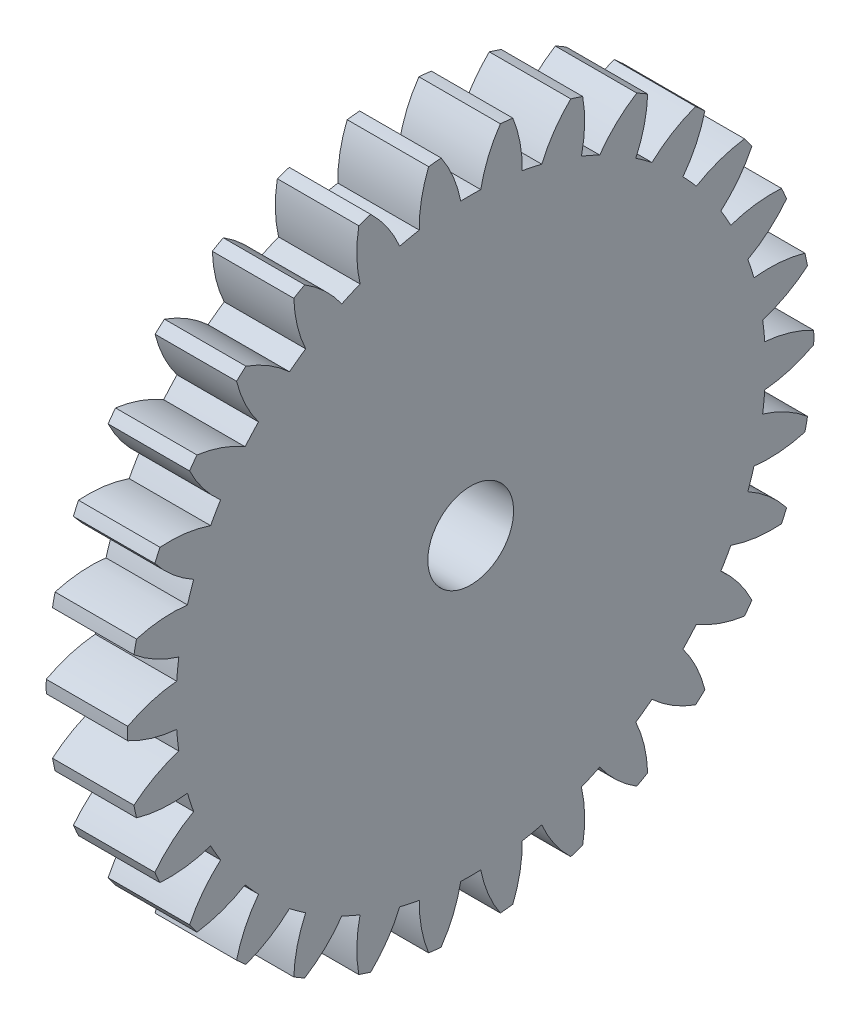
ISO-10303-21;
HEADER;
FILE_DESCRIPTION(('STEP AP214'),'2;1');
FILE_NAME('part.step','',(''),(''),'','','');
FILE_SCHEMA(('AUTOMOTIVE_DESIGN { 1 0 10303 214 1 1 1 1 }'));
ENDSEC;
DATA;
#1=APPLICATION_CONTEXT('core data for automotive mechanical design processes');
#2=APPLICATION_PROTOCOL_DEFINITION('international standard','automotive_design',2000,#1);
#3=PRODUCT_CONTEXT('',#1,'mechanical');
#4=PRODUCT('Part','Part','',(#3));
#5=PRODUCT_RELATED_PRODUCT_CATEGORY('part','',(#4));
#6=PRODUCT_DEFINITION_FORMATION('','',#4);
#7=PRODUCT_DEFINITION_CONTEXT('part definition',#1,'design');
#8=PRODUCT_DEFINITION('design','',#6,#7);
#9=PRODUCT_DEFINITION_SHAPE('','',#8);
#10=(LENGTH_UNIT() NAMED_UNIT(*) SI_UNIT(.MILLI.,.METRE.));
#11=(NAMED_UNIT(*) PLANE_ANGLE_UNIT() SI_UNIT($,.RADIAN.));
#12=(NAMED_UNIT(*) SI_UNIT($,.STERADIAN.) SOLID_ANGLE_UNIT());
#13=UNCERTAINTY_MEASURE_WITH_UNIT(LENGTH_MEASURE(1.E-05),#10,'distance_accuracy_value','');
#14=(GEOMETRIC_REPRESENTATION_CONTEXT(3) GLOBAL_UNCERTAINTY_ASSIGNED_CONTEXT((#13)) GLOBAL_UNIT_ASSIGNED_CONTEXT((#10,
#11,#12)) REPRESENTATION_CONTEXT('',''));
#15=CARTESIAN_POINT('',(0.,0.,0.));
#16=DIRECTION('',(0.,0.,1.));
#17=DIRECTION('',(1.,0.,0.));
#18=AXIS2_PLACEMENT_3D('',#15,#16,#17);
#19=CARTESIAN_POINT('',(0.,0.,0.));
#20=DIRECTION('',(1.,0.,0.));
#21=DIRECTION('',(0.,0.,-1.));
#22=AXIS2_PLACEMENT_3D('',#19,#20,#21);
#23=PLANE('',#22);
#24=CARTESIAN_POINT('',(0.,5.4931885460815,-4.41530062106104));
#25=DIRECTION('',(-1.,0.,0.));
#26=DIRECTION('',(0.,-0.207911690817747,-0.978147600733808));
#27=AXIS2_PLACEMENT_3D('',#24,#25,#26);
#28=CIRCLE('',#27,3.);
#29=CARTESIAN_POINT('',(0.,6.67145476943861,-1.65637171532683));
#30=VERTEX_POINT('',#29);
#31=CARTESIAN_POINT('',(0.,7.65239678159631,-2.33255728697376));
#32=VERTEX_POINT('',#31);
#33=EDGE_CURVE('E42',#30,#32,#28,.T.);
#34=ORIENTED_EDGE('',*,*,#33,.T.);
#35=CARTESIAN_POINT('',(0.,0.,0.));
#36=DIRECTION('',(-1.,0.,0.));
#37=DIRECTION('',(0.,0.,1.));
#38=AXIS2_PLACEMENT_3D('',#35,#36,#37);
#39=CIRCLE('',#38,8.);
#40=CARTESIAN_POINT('',(0.,7.56196181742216,-2.61088748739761));
#41=VERTEX_POINT('',#40);
#42=EDGE_CURVE('E882',#32,#41,#39,.T.);
#43=ORIENTED_EDGE('',*,*,#42,.T.);
#44=CARTESIAN_POINT('',(0.,7.03933147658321,0.343238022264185));
#45=DIRECTION('',(1.,0.,0.));
#46=DIRECTION('',(0.,0.,-1.));
#47=AXIS2_PLACEMENT_3D('',#44,#45,#46);
#48=CIRCLE('',#47,3.);
#49=CARTESIAN_POINT('',(0.,6.3709111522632,-2.58134985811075));
#50=VERTEX_POINT('',#49);
#51=EDGE_CURVE('E788',#50,#41,#48,.T.);
#52=ORIENTED_EDGE('',*,*,#51,.F.);
#53=CARTESIAN_POINT('',(0.,0.,0.));
#54=DIRECTION('',(-1.,0.,0.));
#55=DIRECTION('',(0.,-0.406736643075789,-0.913545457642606));
#56=AXIS2_PLACEMENT_3D('',#53,#54,#55);
#57=CIRCLE('',#56,6.874);
#58=CARTESIAN_POINT('',(0.,6.18128843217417,-3.00724946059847));
#59=VERTEX_POINT('',#58);
#60=EDGE_CURVE('E1514',#50,#59,#57,.T.);
#61=ORIENTED_EDGE('',*,*,#60,.T.);
#62=CARTESIAN_POINT('',(0.,4.45515657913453,-5.4609138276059));
#63=DIRECTION('',(-1.,0.,0.));
#64=DIRECTION('',(0.,-0.406736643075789,-0.913545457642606));
#65=AXIS2_PLACEMENT_3D('',#62,#63,#64);
#66=CIRCLE('',#65,3.);
#67=CARTESIAN_POINT('',(0.,7.00020762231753,-3.87260806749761));
#68=VERTEX_POINT('',#67);
#69=EDGE_CURVE('E50',#59,#68,#66,.T.);
#70=ORIENTED_EDGE('',*,*,#69,.T.);
#71=CARTESIAN_POINT('',(0.,6.85388077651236,-4.12605359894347));
#72=VERTEX_POINT('',#71);
#73=EDGE_CURVE('E2630',#68,#72,#39,.T.);
#74=ORIENTED_EDGE('',*,*,#73,.T.);
#75=CARTESIAN_POINT('',(0.,6.95686839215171,-1.12782186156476));
#76=DIRECTION('',(1.,0.,0.));
#77=DIRECTION('',(0.,0.,-1.));
#78=AXIS2_PLACEMENT_3D('',#75,#76,#77);
#79=CIRCLE('',#78,3.);
#80=CARTESIAN_POINT('',(0.,5.69499864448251,-3.84952808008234));
#81=VERTEX_POINT('',#80);
#82=EDGE_CURVE('E790',#81,#72,#79,.T.);
#83=ORIENTED_EDGE('',*,*,#82,.F.);
#84=CARTESIAN_POINT('',(0.,0.,0.));
#85=DIRECTION('',(-1.,0.,0.));
#86=DIRECTION('',(0.,-0.587785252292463,-0.809016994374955));
#87=AXIS2_PLACEMENT_3D('',#84,#85,#86);
#88=CIRCLE('',#87,6.874);
#89=CARTESIAN_POINT('',(0.,5.42097012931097,-4.22669597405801));
#90=VERTEX_POINT('',#89);
#91=EDGE_CURVE('E1493',#81,#90,#88,.T.);
#92=ORIENTED_EDGE('',*,*,#91,.T.);
#93=CARTESIAN_POINT('',(0.,3.22241289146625,-6.2678588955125));
#94=DIRECTION('',(-1.,0.,0.));
#95=DIRECTION('',(0.,-0.587785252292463,-0.809016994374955));
#96=AXIS2_PLACEMENT_3D('',#93,#94,#95);
#97=CIRCLE('',#96,3.);
#98=CARTESIAN_POINT('',(0.,6.04207579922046,-5.24340729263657));
#99=VERTEX_POINT('',#98);
#100=EDGE_CURVE('E1496',#90,#99,#97,.T.);
#101=ORIENTED_EDGE('',*,*,#100,.T.);
#102=CARTESIAN_POINT('',(0.,5.84625225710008,-5.46089136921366));
#103=VERTEX_POINT('',#102);
#104=EDGE_CURVE('E2639',#99,#103,#39,.T.);
#105=ORIENTED_EDGE('',*,*,#104,.T.);
#106=CARTESIAN_POINT('',(0.,6.57035677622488,-2.5495905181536));
#107=DIRECTION('',(1.,0.,0.));
#108=DIRECTION('',(0.,0.,-1.));
#109=AXIS2_PLACEMENT_3D('',#106,#107,#108);
#110=CIRCLE('',#109,3.);
#111=CARTESIAN_POINT('',(0.,4.77018736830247,-4.94946345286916));
#112=VERTEX_POINT('',#111);
#113=EDGE_CURVE('E795',#112,#103,#110,.T.);
#114=ORIENTED_EDGE('',*,*,#113,.F.);
#115=CARTESIAN_POINT('',(0.,0.,0.));
#116=DIRECTION('',(-1.,0.,0.));
#117=DIRECTION('',(0.,-0.743144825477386,-0.669130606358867));
#118=AXIS2_PLACEMENT_3D('',#115,#116,#117);
#119=CIRCLE('',#118,6.874);
#120=CARTESIAN_POINT('',(0.,4.42372941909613,-5.26141559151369));
#121=VERTEX_POINT('',#120);
#122=EDGE_CURVE('E1471',#112,#121,#119,.T.);
#123=ORIENTED_EDGE('',*,*,#122,.T.);
#124=CARTESIAN_POINT('',(0.,1.84883429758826,-6.80086845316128));
#125=DIRECTION('',(-1.,0.,0.));
#126=DIRECTION('',(0.,-0.743144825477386,-0.669130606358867));
#127=AXIS2_PLACEMENT_3D('',#124,#125,#126);
#128=CIRCLE('',#127,3.);
#129=CARTESIAN_POINT('',(0.,4.81987627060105,-6.3850444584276));
#130=VERTEX_POINT('',#129);
#131=EDGE_CURVE('E1474',#121,#130,#128,.T.);
#132=ORIENTED_EDGE('',*,*,#131,.T.);
#133=CARTESIAN_POINT('',(0.,4.58311446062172,-6.55706198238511));
#134=VERTEX_POINT('',#133);
#135=EDGE_CURVE('E2640',#130,#134,#39,.T.);
#136=ORIENTED_EDGE('',*,*,#135,.T.);
#137=CARTESIAN_POINT('',(0.,5.89668904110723,-3.85992983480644));
#138=DIRECTION('',(1.,0.,0.));
#139=DIRECTION('',(0.,0.,-1.));
#140=AXIS2_PLACEMENT_3D('',#137,#138,#139);
#141=CIRCLE('',#140,3.);
#142=CARTESIAN_POINT('',(0.,3.63689601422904,-5.83308352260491));
#143=VERTEX_POINT('',#142);
#144=EDGE_CURVE('E798',#143,#134,#141,.T.);
#145=ORIENTED_EDGE('',*,*,#144,.F.);
#146=CARTESIAN_POINT('',(0.,0.,0.));
#147=DIRECTION('',(-1.,0.,0.));
#148=DIRECTION('',(0.,-0.866025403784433,-0.50000000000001));
#149=AXIS2_PLACEMENT_3D('',#146,#147,#148);
#150=CIRCLE('',#149,6.874);
#151=CARTESIAN_POINT('',(0.,3.2331505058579,-6.0661861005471));
#152=VERTEX_POINT('',#151);
#153=EDGE_CURVE('E1449',#143,#152,#150,.T.);
#154=ORIENTED_EDGE('',*,*,#153,.T.);
#155=CARTESIAN_POINT('',(0.,0.3944527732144,-7.03664742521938));
#156=DIRECTION('',(-1.,0.,0.));
#157=DIRECTION('',(0.,-0.866025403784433,-0.50000000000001));
#158=AXIS2_PLACEMENT_3D('',#155,#156,#157);
#159=CIRCLE('',#158,3.);
#160=CARTESIAN_POINT('',(0.,3.38702502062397,-7.2476245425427));
#161=VERTEX_POINT('',#160);
#162=EDGE_CURVE('E1452',#152,#161,#159,.T.);
#163=ORIENTED_EDGE('',*,*,#162,.T.);
#164=CARTESIAN_POINT('',(0.,3.11967256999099,-7.36665752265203));
#165=VERTEX_POINT('',#164);
#166=EDGE_CURVE('E2643',#161,#165,#39,.T.);
#167=ORIENTED_EDGE('',*,*,#166,.T.);
#168=CARTESIAN_POINT('',(0.,4.96530769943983,-5.00157169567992));
#169=DIRECTION('',(1.,0.,0.));
#170=DIRECTION('',(0.,0.,-1.));
#171=AXIS2_PLACEMENT_3D('',#168,#169,#170);
#172=CIRCLE('',#171,3.);
#173=CARTESIAN_POINT('',(0.,2.34465485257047,-6.46176985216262));
#174=VERTEX_POINT('',#173);
#175=EDGE_CURVE('E801',#174,#165,#172,.T.);
#176=ORIENTED_EDGE('',*,*,#175,.F.);
#177=CARTESIAN_POINT('',(0.,0.,0.));
#178=DIRECTION('',(-1.,0.,0.));
#179=DIRECTION('',(0.,-0.95105651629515,-0.309016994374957));
#180=AXIS2_PLACEMENT_3D('',#177,#178,#179);
#181=CIRCLE('',#180,6.874);
#182=CARTESIAN_POINT('',(0.,1.90126740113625,-6.60583516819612));
#183=VERTEX_POINT('',#182);
#184=EDGE_CURVE('E1427',#174,#183,#181,.T.);
#185=ORIENTED_EDGE('',*,*,#184,.T.);
#186=CARTESIAN_POINT('',(0.,-1.07716823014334,-6.9648911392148));
#187=DIRECTION('',(-1.,0.,0.));
#188=DIRECTION('',(0.,-0.95105651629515,-0.309016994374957));
#189=AXIS2_PLACEMENT_3D('',#186,#187,#188);
#190=CIRCLE('',#189,3.);
#191=CARTESIAN_POINT('',(0.,1.80614452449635,-7.79344865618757));
#192=VERTEX_POINT('',#191);
#193=EDGE_CURVE('E1430',#183,#192,#190,.T.);
#194=ORIENTED_EDGE('',*,*,#193,.T.);
#195=CARTESIAN_POINT('',(0.,1.5198860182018,-7.85429478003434));
#196=VERTEX_POINT('',#195);
#197=EDGE_CURVE('E2646',#192,#196,#39,.T.);
#198=ORIENTED_EDGE('',*,*,#197,.T.);
#199=CARTESIAN_POINT('',(0.,3.8169185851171,-5.9246208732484));
#200=DIRECTION('',(1.,0.,0.));
#201=DIRECTION('',(0.,0.,-1.));
#202=AXIS2_PLACEMENT_3D('',#199,#200,#201);
#203=CIRCLE('',#202,3.);
#204=CARTESIAN_POINT('',(0.,0.949941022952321,-6.8080458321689));
#205=VERTEX_POINT('',#204);
#206=EDGE_CURVE('E804',#205,#196,#203,.T.);
#207=ORIENTED_EDGE('',*,*,#206,.F.);
#208=CARTESIAN_POINT('',(0.,0.,0.));
#209=DIRECTION('',(-1.,0.,0.));
#210=DIRECTION('',(0.,-0.994521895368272,-0.104528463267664));
#211=AXIS2_PLACEMENT_3D('',#208,#209,#210);
#212=CIRCLE('',#211,6.874);
#213=CARTESIAN_POINT('',(0.,0.486289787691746,-6.85677754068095));
#214=VERTEX_POINT('',#213);
#215=EDGE_CURVE('E1405',#205,#214,#212,.T.);
#216=ORIENTED_EDGE('',*,*,#215,.T.);
#217=CARTESIAN_POINT('',(0.,-2.50171181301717,-6.58873568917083));
#218=DIRECTION('',(-1.,0.,0.));
#219=DIRECTION('',(0.,-0.994521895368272,-0.104528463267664));
#220=AXIS2_PLACEMENT_3D('',#217,#218,#219);
#221=CIRCLE('',#220,3.);
#222=CARTESIAN_POINT('',(0.,0.146326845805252,-7.99866166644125));
#223=VERTEX_POINT('',#222);
#224=EDGE_CURVE('E1408',#214,#223,#221,.T.);
#225=ORIENTED_EDGE('',*,*,#224,.T.);
#226=CARTESIAN_POINT('',(0.,-0.146326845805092,-7.99866166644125));
#227=VERTEX_POINT('',#226);
#228=EDGE_CURVE('E2649',#223,#227,#39,.T.);
#229=ORIENTED_EDGE('',*,*,#228,.T.);
#230=CARTESIAN_POINT('',(0.,2.5017118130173,-6.58873568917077));
#231=DIRECTION('',(1.,0.,0.));
#232=DIRECTION('',(0.,0.,-1.));
#233=AXIS2_PLACEMENT_3D('',#230,#231,#232);
#234=CIRCLE('',#233,3.);
#235=CARTESIAN_POINT('',(0.,-0.486289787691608,-6.85677754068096));
#236=VERTEX_POINT('',#235);
#237=EDGE_CURVE('E807',#236,#227,#234,.T.);
#238=ORIENTED_EDGE('',*,*,#237,.F.);
#239=CARTESIAN_POINT('',(0.,0.,0.));
#240=DIRECTION('',(-1.,0.,0.));
#241=DIRECTION('',(0.,-0.994521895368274,0.104528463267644));
#242=AXIS2_PLACEMENT_3D('',#239,#240,#241);
#243=CIRCLE('',#242,6.874);
#244=CARTESIAN_POINT('',(0.,-0.949941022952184,-6.80804583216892));
#245=VERTEX_POINT('',#244);
#246=EDGE_CURVE('E1383',#236,#245,#243,.T.);
#247=ORIENTED_EDGE('',*,*,#246,.T.);
#248=CARTESIAN_POINT('',(0.,-3.81691858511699,-5.92462087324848));
#249=DIRECTION('',(-1.,0.,0.));
#250=DIRECTION('',(0.,-0.994521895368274,0.104528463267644));
#251=AXIS2_PLACEMENT_3D('',#248,#249,#250);
#252=CIRCLE('',#251,3.);
#253=CARTESIAN_POINT('',(0.,-1.51988601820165,-7.85429478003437));
#254=VERTEX_POINT('',#253);
#255=EDGE_CURVE('E1386',#245,#254,#252,.T.);
#256=ORIENTED_EDGE('',*,*,#255,.T.);
#257=CARTESIAN_POINT('',(0.,-1.8061445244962,-7.79344865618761));
#258=VERTEX_POINT('',#257);
#259=EDGE_CURVE('E2652',#254,#258,#39,.T.);
#260=ORIENTED_EDGE('',*,*,#259,.T.);
#261=CARTESIAN_POINT('',(0.,1.07716823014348,-6.96489113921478));
#262=DIRECTION('',(1.,0.,0.));
#263=DIRECTION('',(0.,0.,-1.));
#264=AXIS2_PLACEMENT_3D('',#261,#262,#263);
#265=CIRCLE('',#264,3.);
#266=CARTESIAN_POINT('',(0.,-1.90126740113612,-6.60583516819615));
#267=VERTEX_POINT('',#266);
#268=EDGE_CURVE('E810',#267,#258,#265,.T.);
#269=ORIENTED_EDGE('',*,*,#268,.F.);
#270=CARTESIAN_POINT('',(0.,0.,0.));
#271=DIRECTION('',(-1.,0.,0.));
#272=DIRECTION('',(0.,-0.951056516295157,0.309016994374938));
#273=AXIS2_PLACEMENT_3D('',#270,#271,#272);
#274=CIRCLE('',#273,6.874);
#275=CARTESIAN_POINT('',(0.,-2.34465485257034,-6.46176985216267));
#276=VERTEX_POINT('',#275);
#277=EDGE_CURVE('E1361',#267,#276,#274,.T.);
#278=ORIENTED_EDGE('',*,*,#277,.T.);
#279=CARTESIAN_POINT('',(0.,-4.96530769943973,-5.00157169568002));
#280=DIRECTION('',(-1.,0.,0.));
#281=DIRECTION('',(0.,-0.951056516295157,0.309016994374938));
#282=AXIS2_PLACEMENT_3D('',#279,#280,#281);
#283=CIRCLE('',#282,3.);
#284=CARTESIAN_POINT('',(0.,-3.11967256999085,-7.3666575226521));
#285=VERTEX_POINT('',#284);
#286=EDGE_CURVE('E1364',#276,#285,#283,.T.);
#287=ORIENTED_EDGE('',*,*,#286,.T.);
#288=CARTESIAN_POINT('',(0.,-3.38702502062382,-7.24762454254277));
#289=VERTEX_POINT('',#288);
#290=EDGE_CURVE('E2655',#285,#289,#39,.T.);
#291=ORIENTED_EDGE('',*,*,#290,.T.);
#292=CARTESIAN_POINT('',(0.,-0.394452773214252,-7.03664742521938));
#293=DIRECTION('',(1.,0.,0.));
#294=DIRECTION('',(0.,0.,-1.));
#295=AXIS2_PLACEMENT_3D('',#292,#293,#294);
#296=CIRCLE('',#295,3.);
#297=CARTESIAN_POINT('',(0.,-3.23315050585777,-6.06618610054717));
#298=VERTEX_POINT('',#297);
#299=EDGE_CURVE('E813',#298,#289,#296,.T.);
#300=ORIENTED_EDGE('',*,*,#299,.F.);
#301=CARTESIAN_POINT('',(0.,0.,0.));
#302=DIRECTION('',(-1.,0.,0.));
#303=DIRECTION('',(0.,-0.866025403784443,0.499999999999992));
#304=AXIS2_PLACEMENT_3D('',#301,#302,#303);
#305=CIRCLE('',#304,6.874);
#306=CARTESIAN_POINT('',(0.,-3.63689601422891,-5.83308352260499));
#307=VERTEX_POINT('',#306);
#308=EDGE_CURVE('E1339',#298,#307,#305,.T.);
#309=ORIENTED_EDGE('',*,*,#308,.T.);
#310=CARTESIAN_POINT('',(0.,-5.89668904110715,-3.85992983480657));
#311=DIRECTION('',(-1.,0.,0.));
#312=DIRECTION('',(0.,-0.866025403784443,0.499999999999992));
#313=AXIS2_PLACEMENT_3D('',#310,#311,#312);
#314=CIRCLE('',#313,3.);
#315=CARTESIAN_POINT('',(0.,-4.58311446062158,-6.55706198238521));
#316=VERTEX_POINT('',#315);
#317=EDGE_CURVE('E1342',#307,#316,#314,.T.);
#318=ORIENTED_EDGE('',*,*,#317,.T.);
#319=CARTESIAN_POINT('',(0.,-4.81987627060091,-6.3850444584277));
#320=VERTEX_POINT('',#319);
#321=EDGE_CURVE('E2658',#316,#320,#39,.T.);
#322=ORIENTED_EDGE('',*,*,#321,.T.);
#323=CARTESIAN_POINT('',(0.,-1.84883429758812,-6.80086845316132));
#324=DIRECTION('',(1.,0.,0.));
#325=DIRECTION('',(0.,0.,-1.));
#326=AXIS2_PLACEMENT_3D('',#323,#324,#325);
#327=CIRCLE('',#326,3.);
#328=CARTESIAN_POINT('',(0.,-4.42372941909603,-5.26141559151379));
#329=VERTEX_POINT('',#328);
#330=EDGE_CURVE('E816',#329,#320,#327,.T.);
#331=ORIENTED_EDGE('',*,*,#330,.F.);
#332=CARTESIAN_POINT('',(0.,0.,0.));
#333=DIRECTION('',(-1.,0.,0.));
#334=DIRECTION('',(0.,-0.7431448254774,0.669130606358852));
#335=AXIS2_PLACEMENT_3D('',#332,#333,#334);
#336=CIRCLE('',#335,6.874);
#337=CARTESIAN_POINT('',(0.,-4.77018736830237,-4.94946345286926));
#338=VERTEX_POINT('',#337);
#339=EDGE_CURVE('E1317',#329,#338,#336,.T.);
#340=ORIENTED_EDGE('',*,*,#339,.T.);
#341=CARTESIAN_POINT('',(0.,-6.57035677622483,-2.54959051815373));
#342=DIRECTION('',(-1.,0.,0.));
#343=DIRECTION('',(0.,-0.7431448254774,0.669130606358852));
#344=AXIS2_PLACEMENT_3D('',#341,#342,#343);
#345=CIRCLE('',#344,3.);
#346=CARTESIAN_POINT('',(0.,-5.84625225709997,-5.46089136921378));
#347=VERTEX_POINT('',#346);
#348=EDGE_CURVE('E1320',#338,#347,#345,.T.);
#349=ORIENTED_EDGE('',*,*,#348,.T.);
#350=CARTESIAN_POINT('',(0.,-6.04207579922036,-5.2434072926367));
#351=VERTEX_POINT('',#350);
#352=EDGE_CURVE('E2661',#347,#351,#39,.T.);
#353=ORIENTED_EDGE('',*,*,#352,.T.);
#354=CARTESIAN_POINT('',(0.,-3.22241289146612,-6.26785889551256));
#355=DIRECTION('',(1.,0.,0.));
#356=DIRECTION('',(0.,0.,-1.));
#357=AXIS2_PLACEMENT_3D('',#354,#355,#356);
#358=CIRCLE('',#357,3.);
#359=CARTESIAN_POINT('',(0.,-5.42097012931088,-4.22669597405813));
#360=VERTEX_POINT('',#359);
#361=EDGE_CURVE('E819',#360,#351,#358,.T.);
#362=ORIENTED_EDGE('',*,*,#361,.F.);
#363=CARTESIAN_POINT('',(0.,0.,0.));
#364=DIRECTION('',(-1.,0.,0.));
#365=DIRECTION('',(0.,-0.58778525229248,0.809016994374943));
#366=AXIS2_PLACEMENT_3D('',#363,#364,#365);
#367=CIRCLE('',#366,6.874);
#368=CARTESIAN_POINT('',(0.,-5.69499864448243,-3.84952808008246));
#369=VERTEX_POINT('',#368);
#370=EDGE_CURVE('E1295',#360,#369,#367,.T.);
#371=ORIENTED_EDGE('',*,*,#370,.T.);
#372=CARTESIAN_POINT('',(0.,-6.95686839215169,-1.1278218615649));
#373=DIRECTION('',(-1.,0.,0.));
#374=DIRECTION('',(0.,-0.58778525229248,0.809016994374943));
#375=AXIS2_PLACEMENT_3D('',#372,#373,#374);
#376=CIRCLE('',#375,3.);
#377=CARTESIAN_POINT('',(0.,-6.85388077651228,-4.12605359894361));
#378=VERTEX_POINT('',#377);
#379=EDGE_CURVE('E1298',#369,#378,#376,.T.);
#380=ORIENTED_EDGE('',*,*,#379,.T.);
#381=CARTESIAN_POINT('',(0.,-7.00020762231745,-3.87260806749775));
#382=VERTEX_POINT('',#381);
#383=EDGE_CURVE('E2664',#378,#382,#39,.T.);
#384=ORIENTED_EDGE('',*,*,#383,.T.);
#385=CARTESIAN_POINT('',(0.,-4.45515657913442,-5.46091382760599));
#386=DIRECTION('',(1.,0.,0.));
#387=DIRECTION('',(0.,0.,-1.));
#388=AXIS2_PLACEMENT_3D('',#385,#386,#387);
#389=CIRCLE('',#388,3.);
#390=CARTESIAN_POINT('',(0.,-6.18128843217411,-3.00724946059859));
#391=VERTEX_POINT('',#390);
#392=EDGE_CURVE('E822',#391,#382,#389,.T.);
#393=ORIENTED_EDGE('',*,*,#392,.F.);
#394=CARTESIAN_POINT('',(0.,0.,0.));
#395=DIRECTION('',(-1.,0.,0.));
#396=DIRECTION('',(0.,-0.406736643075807,0.913545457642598));
#397=AXIS2_PLACEMENT_3D('',#394,#395,#396);
#398=CIRCLE('',#397,6.874);
#399=CARTESIAN_POINT('',(0.,-6.37091115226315,-2.58134985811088));
#400=VERTEX_POINT('',#399);
#401=EDGE_CURVE('E1273',#391,#400,#398,.T.);
#402=ORIENTED_EDGE('',*,*,#401,.T.);
#403=CARTESIAN_POINT('',(0.,-7.03933147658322,0.343238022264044));
#404=DIRECTION('',(-1.,0.,0.));
#405=DIRECTION('',(0.,-0.406736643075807,0.913545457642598));
#406=AXIS2_PLACEMENT_3D('',#403,#404,#405);
#407=CIRCLE('',#406,3.);
#408=CARTESIAN_POINT('',(0.,-7.5619618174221,-2.61088748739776));
#409=VERTEX_POINT('',#408);
#410=EDGE_CURVE('E1276',#400,#409,#407,.T.);
#411=ORIENTED_EDGE('',*,*,#410,.T.);
#412=CARTESIAN_POINT('',(0.,-7.65239678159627,-2.33255728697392));
#413=VERTEX_POINT('',#412);
#414=EDGE_CURVE('E2667',#409,#413,#39,.T.);
#415=ORIENTED_EDGE('',*,*,#414,.T.);
#416=CARTESIAN_POINT('',(0.,-5.49318854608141,-4.41530062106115));
#417=DIRECTION('',(1.,0.,0.));
#418=DIRECTION('',(0.,0.,-1.));
#419=AXIS2_PLACEMENT_3D('',#416,#417,#418);
#420=CIRCLE('',#419,3.);
#421=CARTESIAN_POINT('',(0.,-6.67145476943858,-1.65637171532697));
#422=VERTEX_POINT('',#421);
#423=EDGE_CURVE('E825',#422,#413,#420,.T.);
#424=ORIENTED_EDGE('',*,*,#423,.F.);
#425=CARTESIAN_POINT('',(0.,0.,0.));
#426=DIRECTION('',(-1.,0.,0.));
#427=DIRECTION('',(0.,-0.207911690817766,0.978147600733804));
#428=AXIS2_PLACEMENT_3D('',#425,#426,#427);
#429=CIRCLE('',#428,6.874);
#430=CARTESIAN_POINT('',(0.,-6.76838427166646,-1.20035426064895));
#431=VERTEX_POINT('',#430);
#432=EDGE_CURVE('E1251',#422,#431,#429,.T.);
#433=ORIENTED_EDGE('',*,*,#432,.T.);
#434=CARTESIAN_POINT('',(0.,-6.81414199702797,1.79929675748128));
#435=DIRECTION('',(-1.,0.,0.));
#436=DIRECTION('',(0.,-0.207911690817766,0.978147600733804));
#437=AXIS2_PLACEMENT_3D('',#434,#435,#436);
#438=CIRCLE('',#437,3.);
#439=CARTESIAN_POINT('',(0.,-7.93954884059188,-0.981613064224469));
#440=VERTEX_POINT('',#439);
#441=EDGE_CURVE('E1254',#431,#440,#438,.T.);
#442=ORIENTED_EDGE('',*,*,#441,.T.);
#443=CARTESIAN_POINT('',(0.,-7.97013948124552,-0.690562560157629));
#444=VERTEX_POINT('',#443);
#445=EDGE_CURVE('E2670',#440,#444,#39,.T.);
#446=ORIENTED_EDGE('',*,*,#445,.T.);
#447=CARTESIAN_POINT('',(0.,-6.29114181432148,-3.17671759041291));
#448=DIRECTION('',(1.,0.,0.));
#449=DIRECTION('',(0.,0.,-1.));
#450=AXIS2_PLACEMENT_3D('',#447,#448,#449);
#451=CIRCLE('',#450,3.);
#452=CARTESIAN_POINT('',(0.,-6.8700465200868,-0.233102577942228));
#453=VERTEX_POINT('',#452);
#454=EDGE_CURVE('E828',#453,#444,#451,.T.);
#455=ORIENTED_EDGE('',*,*,#454,.F.);
#456=CARTESIAN_POINT('',(0.,0.,0.));
#457=DIRECTION('',(-1.,0.,0.));
#458=DIRECTION('',(0.,0.,1.));
#459=AXIS2_PLACEMENT_3D('',#456,#457,#458);
#460=CIRCLE('',#459,6.874);
#461=CARTESIAN_POINT('',(0.,-6.8700465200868,0.233102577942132));
#462=VERTEX_POINT('',#461);
#463=EDGE_CURVE('E1229',#453,#462,#460,.T.);
#464=ORIENTED_EDGE('',*,*,#463,.T.);
#465=CARTESIAN_POINT('',(0.,-6.29114181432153,3.17671759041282));
#466=DIRECTION('',(-1.,0.,0.));
#467=DIRECTION('',(0.,0.,1.));
#468=AXIS2_PLACEMENT_3D('',#465,#466,#467);
#469=CIRCLE('',#468,3.);
#470=CARTESIAN_POINT('',(0.,-7.97013948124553,0.690562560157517));
#471=VERTEX_POINT('',#470);
#472=EDGE_CURVE('E1232',#462,#471,#469,.T.);
#473=ORIENTED_EDGE('',*,*,#472,.T.);
#474=CARTESIAN_POINT('',(0.,-7.93954884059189,0.981613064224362));
#475=VERTEX_POINT('',#474);
#476=EDGE_CURVE('E2673',#471,#475,#39,.T.);
#477=ORIENTED_EDGE('',*,*,#476,.T.);
#478=CARTESIAN_POINT('',(0.,-6.81414199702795,-1.79929675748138));
#479=DIRECTION('',(1.,0.,0.));
#480=DIRECTION('',(0.,0.,-1.));
#481=AXIS2_PLACEMENT_3D('',#478,#479,#480);
#482=CIRCLE('',#481,3.);
#483=CARTESIAN_POINT('',(0.,-6.76838427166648,1.20035426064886));
#484=VERTEX_POINT('',#483);
#485=EDGE_CURVE('E831',#484,#475,#482,.T.);
#486=ORIENTED_EDGE('',*,*,#485,.F.);
#487=CARTESIAN_POINT('',(0.,0.,0.));
#488=DIRECTION('',(-1.,0.,0.));
#489=DIRECTION('',(0.,0.207911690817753,0.978147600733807));
#490=AXIS2_PLACEMENT_3D('',#487,#488,#489);
#491=CIRCLE('',#490,6.874);
#492=CARTESIAN_POINT('',(0.,-6.67145476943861,1.65637171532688));
#493=VERTEX_POINT('',#492);
#494=EDGE_CURVE('E1207',#484,#493,#491,.T.);
#495=ORIENTED_EDGE('',*,*,#494,.T.);
#496=CARTESIAN_POINT('',(0.,-5.49318854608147,4.41530062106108));
#497=DIRECTION('',(-1.,0.,0.));
#498=DIRECTION('',(0.,0.207911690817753,0.978147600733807));
#499=AXIS2_PLACEMENT_3D('',#496,#497,#498);
#500=CIRCLE('',#499,3.);
#501=CARTESIAN_POINT('',(0.,-7.6523967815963,2.33255728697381));
#502=VERTEX_POINT('',#501);
#503=EDGE_CURVE('E1210',#493,#502,#500,.T.);
#504=ORIENTED_EDGE('',*,*,#503,.T.);
#505=CARTESIAN_POINT('',(0.,-7.56196181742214,2.61088748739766));
#506=VERTEX_POINT('',#505);
#507=EDGE_CURVE('E2676',#502,#506,#39,.T.);
#508=ORIENTED_EDGE('',*,*,#507,.T.);
#509=CARTESIAN_POINT('',(0.,-7.03933147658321,-0.343238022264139));
#510=DIRECTION('',(1.,0.,0.));
#511=DIRECTION('',(0.,0.,-1.));
#512=AXIS2_PLACEMENT_3D('',#509,#510,#511);
#513=CIRCLE('',#512,3.);
#514=CARTESIAN_POINT('',(0.,-6.37091115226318,2.58134985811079));
#515=VERTEX_POINT('',#514);
#516=EDGE_CURVE('E834',#515,#506,#513,.T.);
#517=ORIENTED_EDGE('',*,*,#516,.F.);
#518=CARTESIAN_POINT('',(0.,0.,0.));
#519=DIRECTION('',(-1.,0.,0.));
#520=DIRECTION('',(0.,0.406736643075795,0.913545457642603));
#521=AXIS2_PLACEMENT_3D('',#518,#519,#520);
#522=CIRCLE('',#521,6.874);
#523=CARTESIAN_POINT('',(0.,-6.18128843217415,3.00724946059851));
#524=VERTEX_POINT('',#523);
#525=EDGE_CURVE('E1185',#515,#524,#522,.T.);
#526=ORIENTED_EDGE('',*,*,#525,.T.);
#527=CARTESIAN_POINT('',(0.,-4.4551565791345,5.46091382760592));
#528=DIRECTION('',(-1.,0.,0.));
#529=DIRECTION('',(0.,0.406736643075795,0.913545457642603));
#530=AXIS2_PLACEMENT_3D('',#527,#528,#529);
#531=CIRCLE('',#530,3.);
#532=CARTESIAN_POINT('',(0.,-7.0002076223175,3.87260806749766));
#533=VERTEX_POINT('',#532);
#534=EDGE_CURVE('E1188',#524,#533,#531,.T.);
#535=ORIENTED_EDGE('',*,*,#534,.T.);
#536=CARTESIAN_POINT('',(0.,-6.85388077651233,4.12605359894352));
#537=VERTEX_POINT('',#536);
#538=EDGE_CURVE('E2679',#533,#537,#39,.T.);
#539=ORIENTED_EDGE('',*,*,#538,.T.);
#540=CARTESIAN_POINT('',(0.,-6.95686839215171,1.12782186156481));
#541=DIRECTION('',(1.,0.,0.));
#542=DIRECTION('',(0.,0.,-1.));
#543=AXIS2_PLACEMENT_3D('',#540,#541,#542);
#544=CIRCLE('',#543,3.);
#545=CARTESIAN_POINT('',(0.,-5.69499864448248,3.84952808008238));
#546=VERTEX_POINT('',#545);
#547=EDGE_CURVE('E837',#546,#537,#544,.T.);
#548=ORIENTED_EDGE('',*,*,#547,.F.);
#549=CARTESIAN_POINT('',(0.,0.,0.));
#550=DIRECTION('',(-1.,0.,0.));
#551=DIRECTION('',(0.,0.587785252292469,0.80901699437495));
#552=AXIS2_PLACEMENT_3D('',#549,#550,#551);
#553=CIRCLE('',#552,6.874);
#554=CARTESIAN_POINT('',(0.,-5.42097012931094,4.22669597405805));
#555=VERTEX_POINT('',#554);
#556=EDGE_CURVE('E1163',#546,#555,#553,.T.);
#557=ORIENTED_EDGE('',*,*,#556,.T.);
#558=CARTESIAN_POINT('',(0.,-3.2224128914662,6.26785889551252));
#559=DIRECTION('',(-1.,0.,0.));
#560=DIRECTION('',(0.,0.587785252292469,0.80901699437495));
#561=AXIS2_PLACEMENT_3D('',#558,#559,#560);
#562=CIRCLE('',#561,3.);
#563=CARTESIAN_POINT('',(0.,-6.04207579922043,5.24340729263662));
#564=VERTEX_POINT('',#563);
#565=EDGE_CURVE('E1166',#555,#564,#562,.T.);
#566=ORIENTED_EDGE('',*,*,#565,.T.);
#567=CARTESIAN_POINT('',(0.,-5.84625225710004,5.4608913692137));
#568=VERTEX_POINT('',#567);
#569=EDGE_CURVE('E2682',#564,#568,#39,.T.);
#570=ORIENTED_EDGE('',*,*,#569,.T.);
#571=CARTESIAN_POINT('',(0.,-6.57035677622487,2.54959051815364));
#572=DIRECTION('',(1.,0.,0.));
#573=DIRECTION('',(0.,0.,-1.));
#574=AXIS2_PLACEMENT_3D('',#571,#572,#573);
#575=CIRCLE('',#574,3.);
#576=CARTESIAN_POINT('',(0.,-4.77018736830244,4.94946345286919));
#577=VERTEX_POINT('',#576);
#578=EDGE_CURVE('E840',#577,#568,#575,.T.);
#579=ORIENTED_EDGE('',*,*,#578,.F.);
#580=CARTESIAN_POINT('',(0.,0.,0.));
#581=DIRECTION('',(-1.,0.,0.));
#582=DIRECTION('',(0.,0.743144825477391,0.669130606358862));
#583=AXIS2_PLACEMENT_3D('',#580,#581,#582);
#584=CIRCLE('',#583,6.874);
#585=CARTESIAN_POINT('',(0.,-4.4237294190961,5.26141559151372));
#586=VERTEX_POINT('',#585);
#587=EDGE_CURVE('E1141',#577,#586,#584,.T.);
#588=ORIENTED_EDGE('',*,*,#587,.T.);
#589=CARTESIAN_POINT('',(0.,-1.84883429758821,6.80086845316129));
#590=DIRECTION('',(-1.,0.,0.));
#591=DIRECTION('',(0.,0.743144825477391,0.669130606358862));
#592=AXIS2_PLACEMENT_3D('',#589,#590,#591);
#593=CIRCLE('',#592,3.);
#594=CARTESIAN_POINT('',(0.,-4.819876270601,6.38504445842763));
#595=VERTEX_POINT('',#594);
#596=EDGE_CURVE('E1144',#586,#595,#593,.T.);
#597=ORIENTED_EDGE('',*,*,#596,.T.);
#598=CARTESIAN_POINT('',(0.,-4.58311446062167,6.55706198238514));
#599=VERTEX_POINT('',#598);
#600=EDGE_CURVE('E2685',#595,#599,#39,.T.);
#601=ORIENTED_EDGE('',*,*,#600,.T.);
#602=CARTESIAN_POINT('',(0.,-5.8966890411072,3.85992983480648));
#603=DIRECTION('',(1.,0.,0.));
#604=DIRECTION('',(0.,0.,-1.));
#605=AXIS2_PLACEMENT_3D('',#602,#603,#604);
#606=CIRCLE('',#605,3.);
#607=CARTESIAN_POINT('',(0.,-3.636896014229,5.83308352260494));
#608=VERTEX_POINT('',#607);
#609=EDGE_CURVE('E843',#608,#599,#606,.T.);
#610=ORIENTED_EDGE('',*,*,#609,.F.);
#611=CARTESIAN_POINT('',(0.,0.,0.));
#612=DIRECTION('',(-1.,0.,0.));
#613=DIRECTION('',(0.,0.866025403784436,0.500000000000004));
#614=AXIS2_PLACEMENT_3D('',#611,#612,#613);
#615=CIRCLE('',#614,6.874);
#616=CARTESIAN_POINT('',(0.,-3.23315050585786,6.06618610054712));
#617=VERTEX_POINT('',#616);
#618=EDGE_CURVE('E1119',#608,#617,#615,.T.);
#619=ORIENTED_EDGE('',*,*,#618,.T.);
#620=CARTESIAN_POINT('',(0.,-0.394452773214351,7.03664742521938));
#621=DIRECTION('',(-1.,0.,0.));
#622=DIRECTION('',(0.,0.866025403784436,0.500000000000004));
#623=AXIS2_PLACEMENT_3D('',#620,#621,#622);
#624=CIRCLE('',#623,3.);
#625=CARTESIAN_POINT('',(0.,-3.38702502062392,7.24762454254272));
#626=VERTEX_POINT('',#625);
#627=EDGE_CURVE('E1122',#617,#626,#624,.T.);
#628=ORIENTED_EDGE('',*,*,#627,.T.);
#629=CARTESIAN_POINT('',(0.,-3.11967256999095,7.36665752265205));
#630=VERTEX_POINT('',#629);
#631=EDGE_CURVE('E2688',#626,#630,#39,.T.);
#632=ORIENTED_EDGE('',*,*,#631,.T.);
#633=CARTESIAN_POINT('',(0.,-4.9653076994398,5.00157169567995));
#634=DIRECTION('',(1.,0.,0.));
#635=DIRECTION('',(0.,0.,-1.));
#636=AXIS2_PLACEMENT_3D('',#633,#634,#635);
#637=CIRCLE('',#636,3.);
#638=CARTESIAN_POINT('',(0.,-2.34465485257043,6.46176985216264));
#639=VERTEX_POINT('',#638);
#640=EDGE_CURVE('E846',#639,#630,#637,.T.);
#641=ORIENTED_EDGE('',*,*,#640,.F.);
#642=CARTESIAN_POINT('',(0.,0.,0.));
#643=DIRECTION('',(-1.,0.,0.));
#644=DIRECTION('',(0.,0.951056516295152,0.309016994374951));
#645=AXIS2_PLACEMENT_3D('',#642,#643,#644);
#646=CIRCLE('',#645,6.874);
#647=CARTESIAN_POINT('',(0.,-1.90126740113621,6.60583516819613));
#648=VERTEX_POINT('',#647);
#649=EDGE_CURVE('E1097',#639,#648,#646,.T.);
#650=ORIENTED_EDGE('',*,*,#649,.T.);
#651=CARTESIAN_POINT('',(0.,1.07716823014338,6.96489113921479));
#652=DIRECTION('',(-1.,0.,0.));
#653=DIRECTION('',(0.,0.951056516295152,0.309016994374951));
#654=AXIS2_PLACEMENT_3D('',#651,#652,#653);
#655=CIRCLE('',#654,3.);
#656=CARTESIAN_POINT('',(0.,-1.8061445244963,7.79344865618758));
#657=VERTEX_POINT('',#656);
#658=EDGE_CURVE('E1100',#648,#657,#655,.T.);
#659=ORIENTED_EDGE('',*,*,#658,.T.);
#660=CARTESIAN_POINT('',(0.,-1.51988601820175,7.85429478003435));
#661=VERTEX_POINT('',#660);
#662=EDGE_CURVE('E2691',#657,#661,#39,.T.);
#663=ORIENTED_EDGE('',*,*,#662,.T.);
#664=CARTESIAN_POINT('',(0.,-3.81691858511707,5.92462087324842));
#665=DIRECTION('',(1.,0.,0.));
#666=DIRECTION('',(0.,0.,-1.));
#667=AXIS2_PLACEMENT_3D('',#664,#665,#666);
#668=CIRCLE('',#667,3.);
#669=CARTESIAN_POINT('',(0.,-0.949941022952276,6.8080458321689));
#670=VERTEX_POINT('',#669);
#671=EDGE_CURVE('E849',#670,#661,#668,.T.);
#672=ORIENTED_EDGE('',*,*,#671,.F.);
#673=CARTESIAN_POINT('',(0.,0.,0.));
#674=DIRECTION('',(-1.,0.,0.));
#675=DIRECTION('',(0.,0.994521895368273,0.104528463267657));
#676=AXIS2_PLACEMENT_3D('',#673,#674,#675);
#677=CIRCLE('',#676,6.874);
#678=CARTESIAN_POINT('',(0.,-0.486289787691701,6.85677754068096));
#679=VERTEX_POINT('',#678);
#680=EDGE_CURVE('E1075',#670,#679,#677,.T.);
#681=ORIENTED_EDGE('',*,*,#680,.T.);
#682=CARTESIAN_POINT('',(0.,2.50171181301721,6.58873568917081));
#683=DIRECTION('',(-1.,0.,0.));
#684=DIRECTION('',(0.,0.994521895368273,0.104528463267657));
#685=AXIS2_PLACEMENT_3D('',#682,#683,#684);
#686=CIRCLE('',#685,3.);
#687=CARTESIAN_POINT('',(0.,-0.1463268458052,7.99866166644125));
#688=VERTEX_POINT('',#687);
#689=EDGE_CURVE('E1078',#679,#688,#686,.T.);
#690=ORIENTED_EDGE('',*,*,#689,.T.);
#691=CARTESIAN_POINT('',(0.,0.146326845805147,7.99866166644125));
#692=VERTEX_POINT('',#691);
#693=EDGE_CURVE('E2694',#688,#692,#39,.T.);
#694=ORIENTED_EDGE('',*,*,#693,.T.);
#695=CARTESIAN_POINT('',(0.,-2.50171181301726,6.58873568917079));
#696=DIRECTION('',(1.,0.,0.));
#697=DIRECTION('',(0.,0.,-1.));
#698=AXIS2_PLACEMENT_3D('',#695,#696,#697);
#699=CIRCLE('',#698,3.);
#700=CARTESIAN_POINT('',(0.,0.486289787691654,6.85677754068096));
#701=VERTEX_POINT('',#700);
#702=EDGE_CURVE('E852',#701,#692,#699,.T.);
#703=ORIENTED_EDGE('',*,*,#702,.F.);
#704=CARTESIAN_POINT('',(0.,0.,0.));
#705=DIRECTION('',(-1.,0.,0.));
#706=DIRECTION('',(0.,0.994521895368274,-0.10452846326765));
#707=AXIS2_PLACEMENT_3D('',#704,#705,#706);
#708=CIRCLE('',#707,6.874);
#709=CARTESIAN_POINT('',(0.,0.94994102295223,6.80804583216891));
#710=VERTEX_POINT('',#709);
#711=EDGE_CURVE('E1053',#701,#710,#708,.T.);
#712=ORIENTED_EDGE('',*,*,#711,.T.);
#713=CARTESIAN_POINT('',(0.,3.81691858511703,5.92462087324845));
#714=DIRECTION('',(-1.,0.,0.));
#715=DIRECTION('',(0.,0.994521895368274,-0.10452846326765));
#716=AXIS2_PLACEMENT_3D('',#713,#714,#715);
#717=CIRCLE('',#716,3.);
#718=CARTESIAN_POINT('',(0.,1.5198860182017,7.85429478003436));
#719=VERTEX_POINT('',#718);
#720=EDGE_CURVE('E1056',#710,#719,#717,.T.);
#721=ORIENTED_EDGE('',*,*,#720,.T.);
#722=CARTESIAN_POINT('',(0.,1.80614452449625,7.7934486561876));
#723=VERTEX_POINT('',#722);
#724=EDGE_CURVE('E2697',#719,#723,#39,.T.);
#725=ORIENTED_EDGE('',*,*,#724,.T.);
#726=CARTESIAN_POINT('',(0.,-1.07716823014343,6.96489113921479));
#727=DIRECTION('',(1.,0.,0.));
#728=DIRECTION('',(0.,0.,-1.));
#729=AXIS2_PLACEMENT_3D('',#726,#727,#728);
#730=CIRCLE('',#729,3.);
#731=CARTESIAN_POINT('',(0.,1.90126740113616,6.60583516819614));
#732=VERTEX_POINT('',#731);
#733=EDGE_CURVE('E855',#732,#723,#730,.T.);
#734=ORIENTED_EDGE('',*,*,#733,.F.);
#735=CARTESIAN_POINT('',(0.,0.,0.));
#736=DIRECTION('',(-1.,0.,0.));
#737=DIRECTION('',(0.,0.951056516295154,-0.309016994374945));
#738=AXIS2_PLACEMENT_3D('',#735,#736,#737);
#739=CIRCLE('',#738,6.874);
#740=CARTESIAN_POINT('',(0.,2.34465485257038,6.46176985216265));
#741=VERTEX_POINT('',#740);
#742=EDGE_CURVE('E1031',#732,#741,#739,.T.);
#743=ORIENTED_EDGE('',*,*,#742,.T.);
#744=CARTESIAN_POINT('',(0.,4.96530769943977,5.00157169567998));
#745=DIRECTION('',(-1.,0.,0.));
#746=DIRECTION('',(0.,0.951056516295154,-0.309016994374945));
#747=AXIS2_PLACEMENT_3D('',#744,#745,#746);
#748=CIRCLE('',#747,3.);
#749=CARTESIAN_POINT('',(0.,3.1196725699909,7.36665752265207));
#750=VERTEX_POINT('',#749);
#751=EDGE_CURVE('E1034',#741,#750,#748,.T.);
#752=ORIENTED_EDGE('',*,*,#751,.T.);
#753=CARTESIAN_POINT('',(0.,3.38702502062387,7.24762454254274));
#754=VERTEX_POINT('',#753);
#755=EDGE_CURVE('E2700',#750,#754,#39,.T.);
#756=ORIENTED_EDGE('',*,*,#755,.T.);
#757=CARTESIAN_POINT('',(0.,0.394452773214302,7.03664742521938));
#758=DIRECTION('',(1.,0.,0.));
#759=DIRECTION('',(0.,0.,-1.));
#760=AXIS2_PLACEMENT_3D('',#757,#758,#759);
#761=CIRCLE('',#760,3.);
#762=CARTESIAN_POINT('',(0.,3.23315050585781,6.06618610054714));
#763=VERTEX_POINT('',#762);
#764=EDGE_CURVE('E858',#763,#754,#761,.T.);
#765=ORIENTED_EDGE('',*,*,#764,.F.);
#766=CARTESIAN_POINT('',(0.,0.,0.));
#767=DIRECTION('',(-1.,0.,0.));
#768=DIRECTION('',(0.,0.86602540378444,-0.499999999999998));
#769=AXIS2_PLACEMENT_3D('',#766,#767,#768);
#770=CIRCLE('',#769,6.874);
#771=CARTESIAN_POINT('',(0.,3.63689601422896,5.83308352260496));
#772=VERTEX_POINT('',#771);
#773=EDGE_CURVE('E1009',#763,#772,#770,.T.);
#774=ORIENTED_EDGE('',*,*,#773,.T.);
#775=CARTESIAN_POINT('',(0.,5.89668904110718,3.85992983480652));
#776=DIRECTION('',(-1.,0.,0.));
#777=DIRECTION('',(0.,0.86602540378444,-0.499999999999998));
#778=AXIS2_PLACEMENT_3D('',#775,#776,#777);
#779=CIRCLE('',#778,3.);
#780=CARTESIAN_POINT('',(0.,4.58311446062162,6.55706198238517));
#781=VERTEX_POINT('',#780);
#782=EDGE_CURVE('E1012',#772,#781,#779,.T.);
#783=ORIENTED_EDGE('',*,*,#782,.T.);
#784=CARTESIAN_POINT('',(0.,4.81987627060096,6.38504445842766));
#785=VERTEX_POINT('',#784);
#786=EDGE_CURVE('E2703',#781,#785,#39,.T.);
#787=ORIENTED_EDGE('',*,*,#786,.T.);
#788=CARTESIAN_POINT('',(0.,1.84883429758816,6.80086845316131));
#789=DIRECTION('',(1.,0.,0.));
#790=DIRECTION('',(0.,0.,-1.));
#791=AXIS2_PLACEMENT_3D('',#788,#789,#790);
#792=CIRCLE('',#791,3.);
#793=CARTESIAN_POINT('',(0.,4.42372941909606,5.26141559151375));
#794=VERTEX_POINT('',#793);
#795=EDGE_CURVE('E861',#794,#785,#792,.T.);
#796=ORIENTED_EDGE('',*,*,#795,.F.);
#797=CARTESIAN_POINT('',(0.,0.,0.));
#798=DIRECTION('',(-1.,0.,0.));
#799=DIRECTION('',(0.,0.743144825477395,-0.669130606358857));
#800=AXIS2_PLACEMENT_3D('',#797,#798,#799);
#801=CIRCLE('',#800,6.874);
#802=CARTESIAN_POINT('',(0.,4.77018736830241,4.94946345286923));
#803=VERTEX_POINT('',#802);
#804=EDGE_CURVE('E987',#794,#803,#801,.T.);
#805=ORIENTED_EDGE('',*,*,#804,.T.);
#806=CARTESIAN_POINT('',(0.,6.57035677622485,2.54959051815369));
#807=DIRECTION('',(-1.,0.,0.));
#808=DIRECTION('',(0.,0.743144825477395,-0.669130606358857));
#809=AXIS2_PLACEMENT_3D('',#806,#807,#808);
#810=CIRCLE('',#809,3.);
#811=CARTESIAN_POINT('',(0.,5.84625225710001,5.46089136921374));
#812=VERTEX_POINT('',#811);
#813=EDGE_CURVE('E990',#803,#812,#810,.T.);
#814=ORIENTED_EDGE('',*,*,#813,.T.);
#815=CARTESIAN_POINT('',(0.,6.04207579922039,5.24340729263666));
#816=VERTEX_POINT('',#815);
#817=EDGE_CURVE('E2706',#812,#816,#39,.T.);
#818=ORIENTED_EDGE('',*,*,#817,.T.);
#819=CARTESIAN_POINT('',(0.,3.22241289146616,6.26785889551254));
#820=DIRECTION('',(1.,0.,0.));
#821=DIRECTION('',(0.,0.,-1.));
#822=AXIS2_PLACEMENT_3D('',#819,#820,#821);
#823=CIRCLE('',#822,3.);
#824=CARTESIAN_POINT('',(0.,5.42097012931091,4.22669597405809));
#825=VERTEX_POINT('',#824);
#826=EDGE_CURVE('E864',#825,#816,#823,.T.);
#827=ORIENTED_EDGE('',*,*,#826,.F.);
#828=CARTESIAN_POINT('',(0.,0.,0.));
#829=DIRECTION('',(-1.,0.,0.));
#830=DIRECTION('',(0.,0.587785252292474,-0.809016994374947));
#831=AXIS2_PLACEMENT_3D('',#828,#829,#830);
#832=CIRCLE('',#831,6.874);
#833=CARTESIAN_POINT('',(0.,5.69499864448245,3.84952808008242));
#834=VERTEX_POINT('',#833);
#835=EDGE_CURVE('E965',#825,#834,#832,.T.);
#836=ORIENTED_EDGE('',*,*,#835,.T.);
#837=CARTESIAN_POINT('',(0.,6.9568683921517,1.12782186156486));
#838=DIRECTION('',(-1.,0.,0.));
#839=DIRECTION('',(0.,0.587785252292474,-0.809016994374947));
#840=AXIS2_PLACEMENT_3D('',#837,#838,#839);
#841=CIRCLE('',#840,3.);
#842=CARTESIAN_POINT('',(0.,6.8538807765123,4.12605359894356));
#843=VERTEX_POINT('',#842);
#844=EDGE_CURVE('E968',#834,#843,#841,.T.);
#845=ORIENTED_EDGE('',*,*,#844,.T.);
#846=CARTESIAN_POINT('',(0.,7.00020762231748,3.8726080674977));
#847=VERTEX_POINT('',#846);
#848=EDGE_CURVE('E2709',#843,#847,#39,.T.);
#849=ORIENTED_EDGE('',*,*,#848,.T.);
#850=CARTESIAN_POINT('',(0.,4.45515657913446,5.46091382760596));
#851=DIRECTION('',(1.,0.,0.));
#852=DIRECTION('',(0.,0.,-1.));
#853=AXIS2_PLACEMENT_3D('',#850,#851,#852);
#854=CIRCLE('',#853,3.);
#855=CARTESIAN_POINT('',(0.,6.18128843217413,3.00724946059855));
#856=VERTEX_POINT('',#855);
#857=EDGE_CURVE('E867',#856,#847,#854,.T.);
#858=ORIENTED_EDGE('',*,*,#857,.F.);
#859=CARTESIAN_POINT('',(0.,0.,0.));
#860=DIRECTION('',(-1.,0.,0.));
#861=DIRECTION('',(0.,0.406736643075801,-0.913545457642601));
#862=AXIS2_PLACEMENT_3D('',#859,#860,#861);
#863=CIRCLE('',#862,6.874);
#864=CARTESIAN_POINT('',(0.,6.37091115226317,2.58134985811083));
#865=VERTEX_POINT('',#864);
#866=EDGE_CURVE('E943',#856,#865,#863,.T.);
#867=ORIENTED_EDGE('',*,*,#866,.T.);
#868=CARTESIAN_POINT('',(0.,7.03933147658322,-0.343238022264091));
#869=DIRECTION('',(-1.,0.,0.));
#870=DIRECTION('',(0.,0.406736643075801,-0.913545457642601));
#871=AXIS2_PLACEMENT_3D('',#868,#869,#870);
#872=CIRCLE('',#871,3.);
#873=CARTESIAN_POINT('',(0.,7.56196181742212,2.61088748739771));
#874=VERTEX_POINT('',#873);
#875=EDGE_CURVE('E946',#865,#874,#872,.T.);
#876=ORIENTED_EDGE('',*,*,#875,.T.);
#877=CARTESIAN_POINT('',(0.,7.65239678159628,2.33255728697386));
#878=VERTEX_POINT('',#877);
#879=EDGE_CURVE('E2712',#874,#878,#39,.T.);
#880=ORIENTED_EDGE('',*,*,#879,.T.);
#881=CARTESIAN_POINT('',(0.,5.49318854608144,4.41530062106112));
#882=DIRECTION('',(1.,0.,0.));
#883=DIRECTION('',(0.,0.,-1.));
#884=AXIS2_PLACEMENT_3D('',#881,#882,#883);
#885=CIRCLE('',#884,3.);
#886=CARTESIAN_POINT('',(0.,6.67145476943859,1.65637171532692));
#887=VERTEX_POINT('',#886);
#888=EDGE_CURVE('E870',#887,#878,#885,.T.);
#889=ORIENTED_EDGE('',*,*,#888,.F.);
#890=CARTESIAN_POINT('',(0.,0.,0.));
#891=DIRECTION('',(-1.,0.,0.));
#892=DIRECTION('',(0.,0.20791169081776,-0.978147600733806));
#893=AXIS2_PLACEMENT_3D('',#890,#891,#892);
#894=CIRCLE('',#893,6.874);
#895=CARTESIAN_POINT('',(0.,6.76838427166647,1.2003542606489));
#896=VERTEX_POINT('',#895);
#897=EDGE_CURVE('E921',#887,#896,#894,.T.);
#898=ORIENTED_EDGE('',*,*,#897,.T.);
#899=CARTESIAN_POINT('',(0.,6.81414199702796,-1.79929675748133));
#900=DIRECTION('',(-1.,0.,0.));
#901=DIRECTION('',(0.,0.20791169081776,-0.978147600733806));
#902=AXIS2_PLACEMENT_3D('',#899,#900,#901);
#903=CIRCLE('',#902,3.);
#904=CARTESIAN_POINT('',(0.,7.93954884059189,0.981613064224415));
#905=VERTEX_POINT('',#904);
#906=EDGE_CURVE('E924',#896,#905,#903,.T.);
#907=ORIENTED_EDGE('',*,*,#906,.T.);
#908=CARTESIAN_POINT('',(0.,7.97013948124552,0.690562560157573));
#909=VERTEX_POINT('',#908);
#910=EDGE_CURVE('E883',#905,#909,#39,.T.);
#911=ORIENTED_EDGE('',*,*,#910,.T.);
#912=CARTESIAN_POINT('',(0.,6.2911418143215,3.17671759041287));
#913=DIRECTION('',(1.,0.,0.));
#914=DIRECTION('',(0.,0.,-1.));
#915=AXIS2_PLACEMENT_3D('',#912,#913,#914);
#916=CIRCLE('',#915,3.);
#917=CARTESIAN_POINT('',(0.,6.8700465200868,0.233102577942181));
#918=VERTEX_POINT('',#917);
#919=EDGE_CURVE('E873',#918,#909,#916,.T.);
#920=ORIENTED_EDGE('',*,*,#919,.F.);
#921=CARTESIAN_POINT('',(0.,0.,0.));
#922=DIRECTION('',(-1.,0.,0.));
#923=DIRECTION('',(0.,0.,-1.));
#924=AXIS2_PLACEMENT_3D('',#921,#922,#923);
#925=CIRCLE('',#924,6.874);
#926=CARTESIAN_POINT('',(0.,6.8700465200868,-0.23310257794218));
#927=VERTEX_POINT('',#926);
#928=EDGE_CURVE('E900',#918,#927,#925,.T.);
#929=ORIENTED_EDGE('',*,*,#928,.T.);
#930=CARTESIAN_POINT('',(0.,6.2911418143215,-3.17671759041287));
#931=DIRECTION('',(-1.,0.,0.));
#932=DIRECTION('',(0.,0.,-1.));
#933=AXIS2_PLACEMENT_3D('',#930,#931,#932);
#934=CIRCLE('',#933,3.);
#935=CARTESIAN_POINT('',(0.,7.97013948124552,-0.690562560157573));
#936=VERTEX_POINT('',#935);
#937=EDGE_CURVE('E903',#927,#936,#934,.T.);
#938=ORIENTED_EDGE('',*,*,#937,.T.);
#939=CARTESIAN_POINT('',(0.,7.9395488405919,-0.98161306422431));
#940=VERTEX_POINT('',#939);
#941=EDGE_CURVE('E787',#936,#940,#39,.T.);
#942=ORIENTED_EDGE('',*,*,#941,.T.);
#943=CARTESIAN_POINT('',(0.,6.81414199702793,1.79929675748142));
#944=DIRECTION('',(1.,0.,0.));
#945=DIRECTION('',(0.,0.,-1.));
#946=AXIS2_PLACEMENT_3D('',#943,#944,#945);
#947=CIRCLE('',#946,3.);
#948=CARTESIAN_POINT('',(0.,6.76838427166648,-1.20035426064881));
#949=VERTEX_POINT('',#948);
#950=EDGE_CURVE('E35',#949,#940,#947,.T.);
#951=ORIENTED_EDGE('',*,*,#950,.F.);
#952=CARTESIAN_POINT('',(0.,0.,0.));
#953=DIRECTION('',(-1.,0.,0.));
#954=DIRECTION('',(0.,-0.207911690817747,-0.978147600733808));
#955=AXIS2_PLACEMENT_3D('',#952,#953,#954);
#956=CIRCLE('',#955,6.874);
#957=EDGE_CURVE('E778',#949,#30,#956,.T.);
#958=ORIENTED_EDGE('',*,*,#957,.T.);
#959=EDGE_LOOP('',(#34,#43,#52,#61,#70,#74,#83,#92,#101,#105,#114,#123,#132,#136,#145,#154,#163,
#167,#176,#185,#194,#198,#207,#216,#225,#229,#238,#247,#256,#260,#269,#278,#287,#291,#300,#309,
#318,#322,#331,#340,#349,#353,#362,#371,#380,#384,#393,#402,#411,#415,#424,#433,#442,#446,#455,
#464,#473,#477,#486,#495,#504,#508,#517,#526,#535,#539,#548,#557,#566,#570,#579,#588,#597,#601,
#610,#619,#628,#632,#641,#650,#659,#663,#672,#681,#690,#694,#703,#712,#721,#725,#734,#743,#752,
#756,#765,#774,#783,#787,#796,#805,#814,#818,#827,#836,#845,#849,#858,#867,#876,#880,#889,#898,
#907,#911,#920,#929,#938,#942,#951,#958));
#960=FACE_BOUND('',#959,.T.);
#961=CARTESIAN_POINT('',(0.,0.,0.));
#962=DIRECTION('',(1.,0.,0.));
#963=DIRECTION('',(0.,0.,-1.));
#964=AXIS2_PLACEMENT_3D('',#961,#962,#963);
#965=CIRCLE('',#964,2.);
#966=CARTESIAN_POINT('',(0.,0.,-2.));
#967=VERTEX_POINT('',#966);
#968=EDGE_CURVE('E11',#967,#967,#965,.F.);
#969=ORIENTED_EDGE('',*,*,#968,.F.);
#970=EDGE_LOOP('',(#969));
#971=FACE_BOUND('',#970,.T.);
#972=ADVANCED_FACE('F27',(#960,#971),#23,.F.);
#973=CARTESIAN_POINT('',(1.9,0.,0.));
#974=DIRECTION('',(-1.,0.,0.));
#975=DIRECTION('',(0.,0.,1.));
#976=AXIS2_PLACEMENT_3D('',#973,#974,#975);
#977=PLANE('',#976);
#978=CARTESIAN_POINT('',(1.9,5.4931885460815,-4.41530062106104));
#979=DIRECTION('',(-1.,0.,0.));
#980=DIRECTION('',(0.,-0.207911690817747,-0.978147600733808));
#981=AXIS2_PLACEMENT_3D('',#978,#979,#980);
#982=CIRCLE('',#981,3.);
#983=CARTESIAN_POINT('',(1.9,6.67145476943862,-1.65637171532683));
#984=VERTEX_POINT('',#983);
#985=CARTESIAN_POINT('',(1.9,7.65239678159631,-2.33255728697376));
#986=VERTEX_POINT('',#985);
#987=EDGE_CURVE('E781',#984,#986,#982,.T.);
#988=ORIENTED_EDGE('',*,*,#987,.F.);
#989=CARTESIAN_POINT('',(1.9,0.,0.));
#990=DIRECTION('',(-1.,0.,0.));
#991=DIRECTION('',(0.,-0.207911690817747,-0.978147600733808));
#992=AXIS2_PLACEMENT_3D('',#989,#990,#991);
#993=CIRCLE('',#992,6.874);
#994=CARTESIAN_POINT('',(1.9,6.76838427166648,-1.20035426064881));
#995=VERTEX_POINT('',#994);
#996=EDGE_CURVE('E1522',#995,#984,#993,.T.);
#997=ORIENTED_EDGE('',*,*,#996,.F.);
#998=CARTESIAN_POINT('',(1.9,6.81414199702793,1.79929675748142));
#999=DIRECTION('',(-1.,0.,0.));
#1000=DIRECTION('',(0.,-0.207911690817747,-0.978147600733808));
#1001=AXIS2_PLACEMENT_3D('',#998,#999,#1000);
#1002=CIRCLE('',#1001,3.);
#1003=CARTESIAN_POINT('',(1.9,7.9395488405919,-0.981613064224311));
#1004=VERTEX_POINT('',#1003);
#1005=EDGE_CURVE('E771',#1004,#995,#1002,.T.);
#1006=ORIENTED_EDGE('',*,*,#1005,.F.);
#1007=CARTESIAN_POINT('',(1.9,0.,0.));
#1008=DIRECTION('',(-1.,0.,0.));
#1009=DIRECTION('',(0.,0.,1.));
#1010=AXIS2_PLACEMENT_3D('',#1007,#1008,#1009);
#1011=CIRCLE('',#1010,7.99999999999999);
#1012=CARTESIAN_POINT('',(1.9,7.97013948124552,-0.690562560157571));
#1013=VERTEX_POINT('',#1012);
#1014=EDGE_CURVE('E876',#1013,#1004,#1011,.T.);
#1015=ORIENTED_EDGE('',*,*,#1014,.F.);
#1016=CARTESIAN_POINT('',(1.9,6.2911418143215,-3.17671759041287));
#1017=DIRECTION('',(-1.,0.,0.));
#1018=DIRECTION('',(0.,0.,-1.));
#1019=AXIS2_PLACEMENT_3D('',#1016,#1017,#1018);
#1020=CIRCLE('',#1019,3.);
#1021=CARTESIAN_POINT('',(1.9,6.8700465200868,-0.23310257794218));
#1022=VERTEX_POINT('',#1021);
#1023=EDGE_CURVE('E898',#1022,#1013,#1020,.T.);
#1024=ORIENTED_EDGE('',*,*,#1023,.F.);
#1025=CARTESIAN_POINT('',(1.9,0.,0.));
#1026=DIRECTION('',(-1.,0.,0.));
#1027=DIRECTION('',(0.,0.,-1.));
#1028=AXIS2_PLACEMENT_3D('',#1025,#1026,#1027);
#1029=CIRCLE('',#1028,6.874);
#1030=CARTESIAN_POINT('',(1.9,6.8700465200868,0.233102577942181));
#1031=VERTEX_POINT('',#1030);
#1032=EDGE_CURVE('E894',#1031,#1022,#1029,.T.);
#1033=ORIENTED_EDGE('',*,*,#1032,.F.);
#1034=CARTESIAN_POINT('',(1.9,6.2911418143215,3.17671759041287));
#1035=DIRECTION('',(-1.,0.,0.));
#1036=DIRECTION('',(0.,0.,-1.));
#1037=AXIS2_PLACEMENT_3D('',#1034,#1035,#1036);
#1038=CIRCLE('',#1037,3.);
#1039=CARTESIAN_POINT('',(1.9,7.97013948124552,0.690562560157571));
#1040=VERTEX_POINT('',#1039);
#1041=EDGE_CURVE('E896',#1040,#1031,#1038,.T.);
#1042=ORIENTED_EDGE('',*,*,#1041,.F.);
#1043=CARTESIAN_POINT('',(1.9,7.93954884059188,0.981613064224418));
#1044=VERTEX_POINT('',#1043);
#1045=EDGE_CURVE('E880',#1044,#1040,#1011,.T.);
#1046=ORIENTED_EDGE('',*,*,#1045,.F.);
#1047=CARTESIAN_POINT('',(1.9,6.81414199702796,-1.79929675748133));
#1048=DIRECTION('',(-1.,0.,0.));
#1049=DIRECTION('',(0.,0.20791169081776,-0.978147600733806));
#1050=AXIS2_PLACEMENT_3D('',#1047,#1048,#1049);
#1051=CIRCLE('',#1050,3.);
#1052=CARTESIAN_POINT('',(1.9,6.76838427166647,1.2003542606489));
#1053=VERTEX_POINT('',#1052);
#1054=EDGE_CURVE('E919',#1053,#1044,#1051,.T.);
#1055=ORIENTED_EDGE('',*,*,#1054,.F.);
#1056=CARTESIAN_POINT('',(1.9,0.,0.));
#1057=DIRECTION('',(-1.,0.,0.));
#1058=DIRECTION('',(0.,0.20791169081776,-0.978147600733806));
#1059=AXIS2_PLACEMENT_3D('',#1056,#1057,#1058);
#1060=CIRCLE('',#1059,6.874);
#1061=CARTESIAN_POINT('',(1.9,6.67145476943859,1.65637171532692));
#1062=VERTEX_POINT('',#1061);
#1063=EDGE_CURVE('E915',#1062,#1053,#1060,.T.);
#1064=ORIENTED_EDGE('',*,*,#1063,.F.);
#1065=CARTESIAN_POINT('',(1.9,5.49318854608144,4.41530062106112));
#1066=DIRECTION('',(-1.,0.,0.));
#1067=DIRECTION('',(0.,0.20791169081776,-0.978147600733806));
#1068=AXIS2_PLACEMENT_3D('',#1065,#1066,#1067);
#1069=CIRCLE('',#1068,3.);
#1070=CARTESIAN_POINT('',(1.9,7.65239678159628,2.33255728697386));
#1071=VERTEX_POINT('',#1070);
#1072=EDGE_CURVE('E917',#1071,#1062,#1069,.T.);
#1073=ORIENTED_EDGE('',*,*,#1072,.F.);
#1074=CARTESIAN_POINT('',(1.9,7.56196181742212,2.61088748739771));
#1075=VERTEX_POINT('',#1074);
#1076=EDGE_CURVE('E1719',#1075,#1071,#1011,.T.);
#1077=ORIENTED_EDGE('',*,*,#1076,.F.);
#1078=CARTESIAN_POINT('',(1.9,7.03933147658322,-0.343238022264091));
#1079=DIRECTION('',(-1.,0.,0.));
#1080=DIRECTION('',(0.,0.406736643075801,-0.913545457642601));
#1081=AXIS2_PLACEMENT_3D('',#1078,#1079,#1080);
#1082=CIRCLE('',#1081,3.);
#1083=CARTESIAN_POINT('',(1.9,6.37091115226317,2.58134985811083));
#1084=VERTEX_POINT('',#1083);
#1085=EDGE_CURVE('E941',#1084,#1075,#1082,.T.);
#1086=ORIENTED_EDGE('',*,*,#1085,.F.);
#1087=CARTESIAN_POINT('',(1.9,0.,0.));
#1088=DIRECTION('',(-1.,0.,0.));
#1089=DIRECTION('',(0.,0.406736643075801,-0.913545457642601));
#1090=AXIS2_PLACEMENT_3D('',#1087,#1088,#1089);
#1091=CIRCLE('',#1090,6.874);
#1092=CARTESIAN_POINT('',(1.9,6.18128843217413,3.00724946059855));
#1093=VERTEX_POINT('',#1092);
#1094=EDGE_CURVE('E937',#1093,#1084,#1091,.T.);
#1095=ORIENTED_EDGE('',*,*,#1094,.F.);
#1096=CARTESIAN_POINT('',(1.9,4.45515657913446,5.46091382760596));
#1097=DIRECTION('',(-1.,0.,0.));
#1098=DIRECTION('',(0.,0.406736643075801,-0.913545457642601));
#1099=AXIS2_PLACEMENT_3D('',#1096,#1097,#1098);
#1100=CIRCLE('',#1099,3.);
#1101=CARTESIAN_POINT('',(1.9,7.00020762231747,3.8726080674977));
#1102=VERTEX_POINT('',#1101);
#1103=EDGE_CURVE('E939',#1102,#1093,#1100,.T.);
#1104=ORIENTED_EDGE('',*,*,#1103,.F.);
#1105=CARTESIAN_POINT('',(1.9,6.8538807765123,4.12605359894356));
#1106=VERTEX_POINT('',#1105);
#1107=EDGE_CURVE('E1714',#1106,#1102,#1011,.T.);
#1108=ORIENTED_EDGE('',*,*,#1107,.F.);
#1109=CARTESIAN_POINT('',(1.9,6.9568683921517,1.12782186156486));
#1110=DIRECTION('',(-1.,0.,0.));
#1111=DIRECTION('',(0.,0.587785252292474,-0.809016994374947));
#1112=AXIS2_PLACEMENT_3D('',#1109,#1110,#1111);
#1113=CIRCLE('',#1112,3.);
#1114=CARTESIAN_POINT('',(1.9,5.69499864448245,3.84952808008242));
#1115=VERTEX_POINT('',#1114);
#1116=EDGE_CURVE('E963',#1115,#1106,#1113,.T.);
#1117=ORIENTED_EDGE('',*,*,#1116,.F.);
#1118=CARTESIAN_POINT('',(1.9,0.,0.));
#1119=DIRECTION('',(-1.,0.,0.));
#1120=DIRECTION('',(0.,0.587785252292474,-0.809016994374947));
#1121=AXIS2_PLACEMENT_3D('',#1118,#1119,#1120);
#1122=CIRCLE('',#1121,6.874);
#1123=CARTESIAN_POINT('',(1.9,5.42097012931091,4.22669597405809));
#1124=VERTEX_POINT('',#1123);
#1125=EDGE_CURVE('E959',#1124,#1115,#1122,.T.);
#1126=ORIENTED_EDGE('',*,*,#1125,.F.);
#1127=CARTESIAN_POINT('',(1.9,3.22241289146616,6.26785889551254));
#1128=DIRECTION('',(-1.,0.,0.));
#1129=DIRECTION('',(0.,0.587785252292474,-0.809016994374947));
#1130=AXIS2_PLACEMENT_3D('',#1127,#1128,#1129);
#1131=CIRCLE('',#1130,3.);
#1132=CARTESIAN_POINT('',(1.9,6.04207579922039,5.24340729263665));
#1133=VERTEX_POINT('',#1132);
#1134=EDGE_CURVE('E961',#1133,#1124,#1131,.T.);
#1135=ORIENTED_EDGE('',*,*,#1134,.F.);
#1136=CARTESIAN_POINT('',(1.9,5.8462522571,5.46089136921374));
#1137=VERTEX_POINT('',#1136);
#1138=EDGE_CURVE('E1709',#1137,#1133,#1011,.T.);
#1139=ORIENTED_EDGE('',*,*,#1138,.F.);
#1140=CARTESIAN_POINT('',(1.9,6.57035677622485,2.54959051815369));
#1141=DIRECTION('',(-1.,0.,0.));
#1142=DIRECTION('',(0.,0.743144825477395,-0.669130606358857));
#1143=AXIS2_PLACEMENT_3D('',#1140,#1141,#1142);
#1144=CIRCLE('',#1143,3.);
#1145=CARTESIAN_POINT('',(1.9,4.77018736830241,4.94946345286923));
#1146=VERTEX_POINT('',#1145);
#1147=EDGE_CURVE('E985',#1146,#1137,#1144,.T.);
#1148=ORIENTED_EDGE('',*,*,#1147,.F.);
#1149=CARTESIAN_POINT('',(1.9,0.,0.));
#1150=DIRECTION('',(-1.,0.,0.));
#1151=DIRECTION('',(0.,0.743144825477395,-0.669130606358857));
#1152=AXIS2_PLACEMENT_3D('',#1149,#1150,#1151);
#1153=CIRCLE('',#1152,6.874);
#1154=CARTESIAN_POINT('',(1.9,4.42372941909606,5.26141559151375));
#1155=VERTEX_POINT('',#1154);
#1156=EDGE_CURVE('E981',#1155,#1146,#1153,.T.);
#1157=ORIENTED_EDGE('',*,*,#1156,.F.);
#1158=CARTESIAN_POINT('',(1.9,1.84883429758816,6.80086845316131));
#1159=DIRECTION('',(-1.,0.,0.));
#1160=DIRECTION('',(0.,0.743144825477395,-0.669130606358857));
#1161=AXIS2_PLACEMENT_3D('',#1158,#1159,#1160);
#1162=CIRCLE('',#1161,3.);
#1163=CARTESIAN_POINT('',(1.9,4.81987627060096,6.38504445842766));
#1164=VERTEX_POINT('',#1163);
#1165=EDGE_CURVE('E983',#1164,#1155,#1162,.T.);
#1166=ORIENTED_EDGE('',*,*,#1165,.F.);
#1167=CARTESIAN_POINT('',(1.9,4.58311446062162,6.55706198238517));
#1168=VERTEX_POINT('',#1167);
#1169=EDGE_CURVE('E1704',#1168,#1164,#1011,.T.);
#1170=ORIENTED_EDGE('',*,*,#1169,.F.);
#1171=CARTESIAN_POINT('',(1.9,5.89668904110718,3.85992983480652));
#1172=DIRECTION('',(-1.,0.,0.));
#1173=DIRECTION('',(0.,0.86602540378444,-0.499999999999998));
#1174=AXIS2_PLACEMENT_3D('',#1171,#1172,#1173);
#1175=CIRCLE('',#1174,3.);
#1176=CARTESIAN_POINT('',(1.9,3.63689601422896,5.83308352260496));
#1177=VERTEX_POINT('',#1176);
#1178=EDGE_CURVE('E1007',#1177,#1168,#1175,.T.);
#1179=ORIENTED_EDGE('',*,*,#1178,.F.);
#1180=CARTESIAN_POINT('',(1.9,0.,0.));
#1181=DIRECTION('',(-1.,0.,0.));
#1182=DIRECTION('',(0.,0.86602540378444,-0.499999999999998));
#1183=AXIS2_PLACEMENT_3D('',#1180,#1181,#1182);
#1184=CIRCLE('',#1183,6.874);
#1185=CARTESIAN_POINT('',(1.9,3.23315050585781,6.06618610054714));
#1186=VERTEX_POINT('',#1185);
#1187=EDGE_CURVE('E1003',#1186,#1177,#1184,.T.);
#1188=ORIENTED_EDGE('',*,*,#1187,.F.);
#1189=CARTESIAN_POINT('',(1.9,0.394452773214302,7.03664742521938));
#1190=DIRECTION('',(-1.,0.,0.));
#1191=DIRECTION('',(0.,0.86602540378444,-0.499999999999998));
#1192=AXIS2_PLACEMENT_3D('',#1189,#1190,#1191);
#1193=CIRCLE('',#1192,3.);
#1194=CARTESIAN_POINT('',(1.9,3.38702502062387,7.24762454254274));
#1195=VERTEX_POINT('',#1194);
#1196=EDGE_CURVE('E1005',#1195,#1186,#1193,.T.);
#1197=ORIENTED_EDGE('',*,*,#1196,.F.);
#1198=CARTESIAN_POINT('',(1.9,3.11967256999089,7.36665752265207));
#1199=VERTEX_POINT('',#1198);
#1200=EDGE_CURVE('E1699',#1199,#1195,#1011,.T.);
#1201=ORIENTED_EDGE('',*,*,#1200,.F.);
#1202=CARTESIAN_POINT('',(1.9,4.96530769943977,5.00157169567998));
#1203=DIRECTION('',(-1.,0.,0.));
#1204=DIRECTION('',(0.,0.951056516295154,-0.309016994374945));
#1205=AXIS2_PLACEMENT_3D('',#1202,#1203,#1204);
#1206=CIRCLE('',#1205,3.);
#1207=CARTESIAN_POINT('',(1.9,2.34465485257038,6.46176985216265));
#1208=VERTEX_POINT('',#1207);
#1209=EDGE_CURVE('E1029',#1208,#1199,#1206,.T.);
#1210=ORIENTED_EDGE('',*,*,#1209,.F.);
#1211=CARTESIAN_POINT('',(1.9,0.,0.));
#1212=DIRECTION('',(-1.,0.,0.));
#1213=DIRECTION('',(0.,0.951056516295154,-0.309016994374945));
#1214=AXIS2_PLACEMENT_3D('',#1211,#1212,#1213);
#1215=CIRCLE('',#1214,6.874);
#1216=CARTESIAN_POINT('',(1.9,1.90126740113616,6.60583516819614));
#1217=VERTEX_POINT('',#1216);
#1218=EDGE_CURVE('E1025',#1217,#1208,#1215,.T.);
#1219=ORIENTED_EDGE('',*,*,#1218,.F.);
#1220=CARTESIAN_POINT('',(1.9,-1.07716823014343,6.96489113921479));
#1221=DIRECTION('',(-1.,0.,0.));
#1222=DIRECTION('',(0.,0.951056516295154,-0.309016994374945));
#1223=AXIS2_PLACEMENT_3D('',#1220,#1221,#1222);
#1224=CIRCLE('',#1223,3.);
#1225=CARTESIAN_POINT('',(1.9,1.80614452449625,7.79344865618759));
#1226=VERTEX_POINT('',#1225);
#1227=EDGE_CURVE('E1027',#1226,#1217,#1224,.T.);
#1228=ORIENTED_EDGE('',*,*,#1227,.F.);
#1229=CARTESIAN_POINT('',(1.9,1.5198860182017,7.85429478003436));
#1230=VERTEX_POINT('',#1229);
#1231=EDGE_CURVE('E1694',#1230,#1226,#1011,.T.);
#1232=ORIENTED_EDGE('',*,*,#1231,.F.);
#1233=CARTESIAN_POINT('',(1.9,3.81691858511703,5.92462087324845));
#1234=DIRECTION('',(-1.,0.,0.));
#1235=DIRECTION('',(0.,0.994521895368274,-0.10452846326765));
#1236=AXIS2_PLACEMENT_3D('',#1233,#1234,#1235);
#1237=CIRCLE('',#1236,3.);
#1238=CARTESIAN_POINT('',(1.9,0.94994102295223,6.80804583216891));
#1239=VERTEX_POINT('',#1238);
#1240=EDGE_CURVE('E1051',#1239,#1230,#1237,.T.);
#1241=ORIENTED_EDGE('',*,*,#1240,.F.);
#1242=CARTESIAN_POINT('',(1.9,0.,0.));
#1243=DIRECTION('',(-1.,0.,0.));
#1244=DIRECTION('',(0.,0.994521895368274,-0.10452846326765));
#1245=AXIS2_PLACEMENT_3D('',#1242,#1243,#1244);
#1246=CIRCLE('',#1245,6.874);
#1247=CARTESIAN_POINT('',(1.9,0.486289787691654,6.85677754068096));
#1248=VERTEX_POINT('',#1247);
#1249=EDGE_CURVE('E1047',#1248,#1239,#1246,.T.);
#1250=ORIENTED_EDGE('',*,*,#1249,.F.);
#1251=CARTESIAN_POINT('',(1.9,-2.50171181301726,6.58873568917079));
#1252=DIRECTION('',(-1.,0.,0.));
#1253=DIRECTION('',(0.,0.994521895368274,-0.10452846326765));
#1254=AXIS2_PLACEMENT_3D('',#1251,#1252,#1253);
#1255=CIRCLE('',#1254,3.);
#1256=CARTESIAN_POINT('',(1.9,0.146326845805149,7.99866166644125));
#1257=VERTEX_POINT('',#1256);
#1258=EDGE_CURVE('E1049',#1257,#1248,#1255,.T.);
#1259=ORIENTED_EDGE('',*,*,#1258,.F.);
#1260=CARTESIAN_POINT('',(1.9,-0.146326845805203,7.99866166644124));
#1261=VERTEX_POINT('',#1260);
#1262=EDGE_CURVE('E1689',#1261,#1257,#1011,.T.);
#1263=ORIENTED_EDGE('',*,*,#1262,.F.);
#1264=CARTESIAN_POINT('',(1.9,2.50171181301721,6.58873568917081));
#1265=DIRECTION('',(-1.,0.,0.));
#1266=DIRECTION('',(0.,0.994521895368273,0.104528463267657));
#1267=AXIS2_PLACEMENT_3D('',#1264,#1265,#1266);
#1268=CIRCLE('',#1267,3.);
#1269=CARTESIAN_POINT('',(1.9,-0.486289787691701,6.85677754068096));
#1270=VERTEX_POINT('',#1269);
#1271=EDGE_CURVE('E1073',#1270,#1261,#1268,.T.);
#1272=ORIENTED_EDGE('',*,*,#1271,.F.);
#1273=CARTESIAN_POINT('',(1.9,0.,0.));
#1274=DIRECTION('',(-1.,0.,0.));
#1275=DIRECTION('',(0.,0.994521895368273,0.104528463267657));
#1276=AXIS2_PLACEMENT_3D('',#1273,#1274,#1275);
#1277=CIRCLE('',#1276,6.874);
#1278=CARTESIAN_POINT('',(1.9,-0.949941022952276,6.8080458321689));
#1279=VERTEX_POINT('',#1278);
#1280=EDGE_CURVE('E1069',#1279,#1270,#1277,.T.);
#1281=ORIENTED_EDGE('',*,*,#1280,.F.);
#1282=CARTESIAN_POINT('',(1.9,-3.81691858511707,5.92462087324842));
#1283=DIRECTION('',(-1.,0.,0.));
#1284=DIRECTION('',(0.,0.994521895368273,0.104528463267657));
#1285=AXIS2_PLACEMENT_3D('',#1282,#1283,#1284);
#1286=CIRCLE('',#1285,3.);
#1287=CARTESIAN_POINT('',(1.9,-1.51988601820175,7.85429478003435));
#1288=VERTEX_POINT('',#1287);
#1289=EDGE_CURVE('E1071',#1288,#1279,#1286,.T.);
#1290=ORIENTED_EDGE('',*,*,#1289,.F.);
#1291=CARTESIAN_POINT('',(1.9,-1.8061445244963,7.79344865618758));
#1292=VERTEX_POINT('',#1291);
#1293=EDGE_CURVE('E1684',#1292,#1288,#1011,.T.);
#1294=ORIENTED_EDGE('',*,*,#1293,.F.);
#1295=CARTESIAN_POINT('',(1.9,1.07716823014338,6.96489113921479));
#1296=DIRECTION('',(-1.,0.,0.));
#1297=DIRECTION('',(0.,0.951056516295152,0.309016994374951));
#1298=AXIS2_PLACEMENT_3D('',#1295,#1296,#1297);
#1299=CIRCLE('',#1298,3.);
#1300=CARTESIAN_POINT('',(1.9,-1.90126740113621,6.60583516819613));
#1301=VERTEX_POINT('',#1300);
#1302=EDGE_CURVE('E1095',#1301,#1292,#1299,.T.);
#1303=ORIENTED_EDGE('',*,*,#1302,.F.);
#1304=CARTESIAN_POINT('',(1.9,0.,0.));
#1305=DIRECTION('',(-1.,0.,0.));
#1306=DIRECTION('',(0.,0.951056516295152,0.309016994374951));
#1307=AXIS2_PLACEMENT_3D('',#1304,#1305,#1306);
#1308=CIRCLE('',#1307,6.874);
#1309=CARTESIAN_POINT('',(1.9,-2.34465485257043,6.46176985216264));
#1310=VERTEX_POINT('',#1309);
#1311=EDGE_CURVE('E1091',#1310,#1301,#1308,.T.);
#1312=ORIENTED_EDGE('',*,*,#1311,.F.);
#1313=CARTESIAN_POINT('',(1.9,-4.9653076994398,5.00157169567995));
#1314=DIRECTION('',(-1.,0.,0.));
#1315=DIRECTION('',(0.,0.951056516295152,0.309016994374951));
#1316=AXIS2_PLACEMENT_3D('',#1313,#1314,#1315);
#1317=CIRCLE('',#1316,3.);
#1318=CARTESIAN_POINT('',(1.9,-3.11967256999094,7.36665752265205));
#1319=VERTEX_POINT('',#1318);
#1320=EDGE_CURVE('E1093',#1319,#1310,#1317,.T.);
#1321=ORIENTED_EDGE('',*,*,#1320,.F.);
#1322=CARTESIAN_POINT('',(1.9,-3.38702502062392,7.24762454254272));
#1323=VERTEX_POINT('',#1322);
#1324=EDGE_CURVE('E1679',#1323,#1319,#1011,.T.);
#1325=ORIENTED_EDGE('',*,*,#1324,.F.);
#1326=CARTESIAN_POINT('',(1.9,-0.394452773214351,7.03664742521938));
#1327=DIRECTION('',(-1.,0.,0.));
#1328=DIRECTION('',(0.,0.866025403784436,0.500000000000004));
#1329=AXIS2_PLACEMENT_3D('',#1326,#1327,#1328);
#1330=CIRCLE('',#1329,3.);
#1331=CARTESIAN_POINT('',(1.9,-3.23315050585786,6.06618610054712));
#1332=VERTEX_POINT('',#1331);
#1333=EDGE_CURVE('E1117',#1332,#1323,#1330,.T.);
#1334=ORIENTED_EDGE('',*,*,#1333,.F.);
#1335=CARTESIAN_POINT('',(1.9,0.,0.));
#1336=DIRECTION('',(-1.,0.,0.));
#1337=DIRECTION('',(0.,0.866025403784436,0.500000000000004));
#1338=AXIS2_PLACEMENT_3D('',#1335,#1336,#1337);
#1339=CIRCLE('',#1338,6.874);
#1340=CARTESIAN_POINT('',(1.9,-3.636896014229,5.83308352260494));
#1341=VERTEX_POINT('',#1340);
#1342=EDGE_CURVE('E1113',#1341,#1332,#1339,.T.);
#1343=ORIENTED_EDGE('',*,*,#1342,.F.);
#1344=CARTESIAN_POINT('',(1.9,-5.8966890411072,3.85992983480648));
#1345=DIRECTION('',(-1.,0.,0.));
#1346=DIRECTION('',(0.,0.866025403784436,0.500000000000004));
#1347=AXIS2_PLACEMENT_3D('',#1344,#1345,#1346);
#1348=CIRCLE('',#1347,3.);
#1349=CARTESIAN_POINT('',(1.9,-4.58311446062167,6.55706198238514));
#1350=VERTEX_POINT('',#1349);
#1351=EDGE_CURVE('E1115',#1350,#1341,#1348,.T.);
#1352=ORIENTED_EDGE('',*,*,#1351,.F.);
#1353=CARTESIAN_POINT('',(1.9,-4.819876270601,6.38504445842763));
#1354=VERTEX_POINT('',#1353);
#1355=EDGE_CURVE('E1674',#1354,#1350,#1011,.T.);
#1356=ORIENTED_EDGE('',*,*,#1355,.F.);
#1357=CARTESIAN_POINT('',(1.9,-1.84883429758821,6.80086845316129));
#1358=DIRECTION('',(-1.,0.,0.));
#1359=DIRECTION('',(0.,0.743144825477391,0.669130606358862));
#1360=AXIS2_PLACEMENT_3D('',#1357,#1358,#1359);
#1361=CIRCLE('',#1360,3.);
#1362=CARTESIAN_POINT('',(1.9,-4.4237294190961,5.26141559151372));
#1363=VERTEX_POINT('',#1362);
#1364=EDGE_CURVE('E1139',#1363,#1354,#1361,.T.);
#1365=ORIENTED_EDGE('',*,*,#1364,.F.);
#1366=CARTESIAN_POINT('',(1.9,0.,0.));
#1367=DIRECTION('',(-1.,0.,0.));
#1368=DIRECTION('',(0.,0.743144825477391,0.669130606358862));
#1369=AXIS2_PLACEMENT_3D('',#1366,#1367,#1368);
#1370=CIRCLE('',#1369,6.874);
#1371=CARTESIAN_POINT('',(1.9,-4.77018736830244,4.94946345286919));
#1372=VERTEX_POINT('',#1371);
#1373=EDGE_CURVE('E1135',#1372,#1363,#1370,.T.);
#1374=ORIENTED_EDGE('',*,*,#1373,.F.);
#1375=CARTESIAN_POINT('',(1.9,-6.57035677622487,2.54959051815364));
#1376=DIRECTION('',(-1.,0.,0.));
#1377=DIRECTION('',(0.,0.743144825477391,0.669130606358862));
#1378=AXIS2_PLACEMENT_3D('',#1375,#1376,#1377);
#1379=CIRCLE('',#1378,3.);
#1380=CARTESIAN_POINT('',(1.9,-5.84625225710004,5.4608913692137));
#1381=VERTEX_POINT('',#1380);
#1382=EDGE_CURVE('E1137',#1381,#1372,#1379,.T.);
#1383=ORIENTED_EDGE('',*,*,#1382,.F.);
#1384=CARTESIAN_POINT('',(1.9,-6.04207579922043,5.24340729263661));
#1385=VERTEX_POINT('',#1384);
#1386=EDGE_CURVE('E1669',#1385,#1381,#1011,.T.);
#1387=ORIENTED_EDGE('',*,*,#1386,.F.);
#1388=CARTESIAN_POINT('',(1.9,-3.2224128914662,6.26785889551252));
#1389=DIRECTION('',(-1.,0.,0.));
#1390=DIRECTION('',(0.,0.587785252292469,0.80901699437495));
#1391=AXIS2_PLACEMENT_3D('',#1388,#1389,#1390);
#1392=CIRCLE('',#1391,3.);
#1393=CARTESIAN_POINT('',(1.9,-5.42097012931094,4.22669597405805));
#1394=VERTEX_POINT('',#1393);
#1395=EDGE_CURVE('E1161',#1394,#1385,#1392,.T.);
#1396=ORIENTED_EDGE('',*,*,#1395,.F.);
#1397=CARTESIAN_POINT('',(1.9,0.,0.));
#1398=DIRECTION('',(-1.,0.,0.));
#1399=DIRECTION('',(0.,0.587785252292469,0.80901699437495));
#1400=AXIS2_PLACEMENT_3D('',#1397,#1398,#1399);
#1401=CIRCLE('',#1400,6.874);
#1402=CARTESIAN_POINT('',(1.9,-5.69499864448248,3.84952808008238));
#1403=VERTEX_POINT('',#1402);
#1404=EDGE_CURVE('E1157',#1403,#1394,#1401,.T.);
#1405=ORIENTED_EDGE('',*,*,#1404,.F.);
#1406=CARTESIAN_POINT('',(1.9,-6.95686839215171,1.12782186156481));
#1407=DIRECTION('',(-1.,0.,0.));
#1408=DIRECTION('',(0.,0.587785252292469,0.80901699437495));
#1409=AXIS2_PLACEMENT_3D('',#1406,#1407,#1408);
#1410=CIRCLE('',#1409,3.);
#1411=CARTESIAN_POINT('',(1.9,-6.85388077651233,4.12605359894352));
#1412=VERTEX_POINT('',#1411);
#1413=EDGE_CURVE('E1159',#1412,#1403,#1410,.T.);
#1414=ORIENTED_EDGE('',*,*,#1413,.F.);
#1415=CARTESIAN_POINT('',(1.9,-7.0002076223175,3.87260806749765));
#1416=VERTEX_POINT('',#1415);
#1417=EDGE_CURVE('E1664',#1416,#1412,#1011,.T.);
#1418=ORIENTED_EDGE('',*,*,#1417,.F.);
#1419=CARTESIAN_POINT('',(1.9,-4.4551565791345,5.46091382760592));
#1420=DIRECTION('',(-1.,0.,0.));
#1421=DIRECTION('',(0.,0.406736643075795,0.913545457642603));
#1422=AXIS2_PLACEMENT_3D('',#1419,#1420,#1421);
#1423=CIRCLE('',#1422,3.);
#1424=CARTESIAN_POINT('',(1.9,-6.18128843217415,3.00724946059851));
#1425=VERTEX_POINT('',#1424);
#1426=EDGE_CURVE('E1183',#1425,#1416,#1423,.T.);
#1427=ORIENTED_EDGE('',*,*,#1426,.F.);
#1428=CARTESIAN_POINT('',(1.9,0.,0.));
#1429=DIRECTION('',(-1.,0.,0.));
#1430=DIRECTION('',(0.,0.406736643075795,0.913545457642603));
#1431=AXIS2_PLACEMENT_3D('',#1428,#1429,#1430);
#1432=CIRCLE('',#1431,6.874);
#1433=CARTESIAN_POINT('',(1.9,-6.37091115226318,2.58134985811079));
#1434=VERTEX_POINT('',#1433);
#1435=EDGE_CURVE('E1179',#1434,#1425,#1432,.T.);
#1436=ORIENTED_EDGE('',*,*,#1435,.F.);
#1437=CARTESIAN_POINT('',(1.9,-7.03933147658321,-0.343238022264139));
#1438=DIRECTION('',(-1.,0.,0.));
#1439=DIRECTION('',(0.,0.406736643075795,0.913545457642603));
#1440=AXIS2_PLACEMENT_3D('',#1437,#1438,#1439);
#1441=CIRCLE('',#1440,3.);
#1442=CARTESIAN_POINT('',(1.9,-7.56196181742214,2.61088748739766));
#1443=VERTEX_POINT('',#1442);
#1444=EDGE_CURVE('E1181',#1443,#1434,#1441,.T.);
#1445=ORIENTED_EDGE('',*,*,#1444,.F.);
#1446=CARTESIAN_POINT('',(1.9,-7.65239678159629,2.33255728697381));
#1447=VERTEX_POINT('',#1446);
#1448=EDGE_CURVE('E1659',#1447,#1443,#1011,.T.);
#1449=ORIENTED_EDGE('',*,*,#1448,.F.);
#1450=CARTESIAN_POINT('',(1.9,-5.49318854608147,4.41530062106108));
#1451=DIRECTION('',(-1.,0.,0.));
#1452=DIRECTION('',(0.,0.207911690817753,0.978147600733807));
#1453=AXIS2_PLACEMENT_3D('',#1450,#1451,#1452);
#1454=CIRCLE('',#1453,3.);
#1455=CARTESIAN_POINT('',(1.9,-6.67145476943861,1.65637171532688));
#1456=VERTEX_POINT('',#1455);
#1457=EDGE_CURVE('E1205',#1456,#1447,#1454,.T.);
#1458=ORIENTED_EDGE('',*,*,#1457,.F.);
#1459=CARTESIAN_POINT('',(1.9,0.,0.));
#1460=DIRECTION('',(-1.,0.,0.));
#1461=DIRECTION('',(0.,0.207911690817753,0.978147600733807));
#1462=AXIS2_PLACEMENT_3D('',#1459,#1460,#1461);
#1463=CIRCLE('',#1462,6.874);
#1464=CARTESIAN_POINT('',(1.9,-6.76838427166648,1.20035426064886));
#1465=VERTEX_POINT('',#1464);
#1466=EDGE_CURVE('E1201',#1465,#1456,#1463,.T.);
#1467=ORIENTED_EDGE('',*,*,#1466,.F.);
#1468=CARTESIAN_POINT('',(1.9,-6.81414199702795,-1.79929675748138));
#1469=DIRECTION('',(-1.,0.,0.));
#1470=DIRECTION('',(0.,0.207911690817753,0.978147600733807));
#1471=AXIS2_PLACEMENT_3D('',#1468,#1469,#1470);
#1472=CIRCLE('',#1471,3.);
#1473=CARTESIAN_POINT('',(1.9,-7.93954884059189,0.981613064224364));
#1474=VERTEX_POINT('',#1473);
#1475=EDGE_CURVE('E1203',#1474,#1465,#1472,.T.);
#1476=ORIENTED_EDGE('',*,*,#1475,.F.);
#1477=CARTESIAN_POINT('',(1.9,-7.97013948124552,0.690562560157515));
#1478=VERTEX_POINT('',#1477);
#1479=EDGE_CURVE('E1654',#1478,#1474,#1011,.T.);
#1480=ORIENTED_EDGE('',*,*,#1479,.F.);
#1481=CARTESIAN_POINT('',(1.9,-6.29114181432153,3.17671759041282));
#1482=DIRECTION('',(-1.,0.,0.));
#1483=DIRECTION('',(0.,0.,1.));
#1484=AXIS2_PLACEMENT_3D('',#1481,#1482,#1483);
#1485=CIRCLE('',#1484,3.);
#1486=CARTESIAN_POINT('',(1.9,-6.8700465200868,0.233102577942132));
#1487=VERTEX_POINT('',#1486);
#1488=EDGE_CURVE('E1227',#1487,#1478,#1485,.T.);
#1489=ORIENTED_EDGE('',*,*,#1488,.F.);
#1490=CARTESIAN_POINT('',(1.9,0.,0.));
#1491=DIRECTION('',(-1.,0.,0.));
#1492=DIRECTION('',(0.,0.,1.));
#1493=AXIS2_PLACEMENT_3D('',#1490,#1491,#1492);
#1494=CIRCLE('',#1493,6.874);
#1495=CARTESIAN_POINT('',(1.9,-6.8700465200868,-0.233102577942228));
#1496=VERTEX_POINT('',#1495);
#1497=EDGE_CURVE('E1223',#1496,#1487,#1494,.T.);
#1498=ORIENTED_EDGE('',*,*,#1497,.F.);
#1499=CARTESIAN_POINT('',(1.9,-6.29114181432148,-3.17671759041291));
#1500=DIRECTION('',(-1.,0.,0.));
#1501=DIRECTION('',(0.,0.,1.));
#1502=AXIS2_PLACEMENT_3D('',#1499,#1500,#1501);
#1503=CIRCLE('',#1502,3.);
#1504=CARTESIAN_POINT('',(1.9,-7.97013948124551,-0.690562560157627));
#1505=VERTEX_POINT('',#1504);
#1506=EDGE_CURVE('E1225',#1505,#1496,#1503,.T.);
#1507=ORIENTED_EDGE('',*,*,#1506,.F.);
#1508=CARTESIAN_POINT('',(1.9,-7.93954884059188,-0.98161306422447));
#1509=VERTEX_POINT('',#1508);
#1510=EDGE_CURVE('E1649',#1509,#1505,#1011,.T.);
#1511=ORIENTED_EDGE('',*,*,#1510,.F.);
#1512=CARTESIAN_POINT('',(1.9,-6.81414199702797,1.79929675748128));
#1513=DIRECTION('',(-1.,0.,0.));
#1514=DIRECTION('',(0.,-0.207911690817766,0.978147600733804));
#1515=AXIS2_PLACEMENT_3D('',#1512,#1513,#1514);
#1516=CIRCLE('',#1515,3.);
#1517=CARTESIAN_POINT('',(1.9,-6.76838427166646,-1.20035426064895));
#1518=VERTEX_POINT('',#1517);
#1519=EDGE_CURVE('E1249',#1518,#1509,#1516,.T.);
#1520=ORIENTED_EDGE('',*,*,#1519,.F.);
#1521=CARTESIAN_POINT('',(1.9,0.,0.));
#1522=DIRECTION('',(-1.,0.,0.));
#1523=DIRECTION('',(0.,-0.207911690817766,0.978147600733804));
#1524=AXIS2_PLACEMENT_3D('',#1521,#1522,#1523);
#1525=CIRCLE('',#1524,6.874);
#1526=CARTESIAN_POINT('',(1.9,-6.67145476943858,-1.65637171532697));
#1527=VERTEX_POINT('',#1526);
#1528=EDGE_CURVE('E1245',#1527,#1518,#1525,.T.);
#1529=ORIENTED_EDGE('',*,*,#1528,.F.);
#1530=CARTESIAN_POINT('',(1.9,-5.49318854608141,-4.41530062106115));
#1531=DIRECTION('',(-1.,0.,0.));
#1532=DIRECTION('',(0.,-0.207911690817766,0.978147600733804));
#1533=AXIS2_PLACEMENT_3D('',#1530,#1531,#1532);
#1534=CIRCLE('',#1533,3.);
#1535=CARTESIAN_POINT('',(1.9,-7.65239678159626,-2.33255728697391));
#1536=VERTEX_POINT('',#1535);
#1537=EDGE_CURVE('E1247',#1536,#1527,#1534,.T.);
#1538=ORIENTED_EDGE('',*,*,#1537,.F.);
#1539=CARTESIAN_POINT('',(1.9,-7.5619618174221,-2.61088748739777));
#1540=VERTEX_POINT('',#1539);
#1541=EDGE_CURVE('E1644',#1540,#1536,#1011,.T.);
#1542=ORIENTED_EDGE('',*,*,#1541,.F.);
#1543=CARTESIAN_POINT('',(1.9,-7.03933147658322,0.343238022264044));
#1544=DIRECTION('',(-1.,0.,0.));
#1545=DIRECTION('',(0.,-0.406736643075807,0.913545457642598));
#1546=AXIS2_PLACEMENT_3D('',#1543,#1544,#1545);
#1547=CIRCLE('',#1546,3.);
#1548=CARTESIAN_POINT('',(1.9,-6.37091115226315,-2.58134985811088));
#1549=VERTEX_POINT('',#1548);
#1550=EDGE_CURVE('E1271',#1549,#1540,#1547,.T.);
#1551=ORIENTED_EDGE('',*,*,#1550,.F.);
#1552=CARTESIAN_POINT('',(1.9,0.,0.));
#1553=DIRECTION('',(-1.,0.,0.));
#1554=DIRECTION('',(0.,-0.406736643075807,0.913545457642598));
#1555=AXIS2_PLACEMENT_3D('',#1552,#1553,#1554);
#1556=CIRCLE('',#1555,6.874);
#1557=CARTESIAN_POINT('',(1.9,-6.18128843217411,-3.00724946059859));
#1558=VERTEX_POINT('',#1557);
#1559=EDGE_CURVE('E1267',#1558,#1549,#1556,.T.);
#1560=ORIENTED_EDGE('',*,*,#1559,.F.);
#1561=CARTESIAN_POINT('',(1.9,-4.45515657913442,-5.46091382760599));
#1562=DIRECTION('',(-1.,0.,0.));
#1563=DIRECTION('',(0.,-0.406736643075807,0.913545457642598));
#1564=AXIS2_PLACEMENT_3D('',#1561,#1562,#1563);
#1565=CIRCLE('',#1564,3.);
#1566=CARTESIAN_POINT('',(1.9,-7.00020762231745,-3.87260806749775));
#1567=VERTEX_POINT('',#1566);
#1568=EDGE_CURVE('E1269',#1567,#1558,#1565,.T.);
#1569=ORIENTED_EDGE('',*,*,#1568,.F.);
#1570=CARTESIAN_POINT('',(1.9,-6.85388077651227,-4.12605359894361));
#1571=VERTEX_POINT('',#1570);
#1572=EDGE_CURVE('E1639',#1571,#1567,#1011,.T.);
#1573=ORIENTED_EDGE('',*,*,#1572,.F.);
#1574=CARTESIAN_POINT('',(1.9,-6.95686839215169,-1.1278218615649));
#1575=DIRECTION('',(-1.,0.,0.));
#1576=DIRECTION('',(0.,-0.58778525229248,0.809016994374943));
#1577=AXIS2_PLACEMENT_3D('',#1574,#1575,#1576);
#1578=CIRCLE('',#1577,3.);
#1579=CARTESIAN_POINT('',(1.9,-5.69499864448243,-3.84952808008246));
#1580=VERTEX_POINT('',#1579);
#1581=EDGE_CURVE('E1293',#1580,#1571,#1578,.T.);
#1582=ORIENTED_EDGE('',*,*,#1581,.F.);
#1583=CARTESIAN_POINT('',(1.9,0.,0.));
#1584=DIRECTION('',(-1.,0.,0.));
#1585=DIRECTION('',(0.,-0.58778525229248,0.809016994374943));
#1586=AXIS2_PLACEMENT_3D('',#1583,#1584,#1585);
#1587=CIRCLE('',#1586,6.874);
#1588=CARTESIAN_POINT('',(1.9,-5.42097012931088,-4.22669597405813));
#1589=VERTEX_POINT('',#1588);
#1590=EDGE_CURVE('E1289',#1589,#1580,#1587,.T.);
#1591=ORIENTED_EDGE('',*,*,#1590,.F.);
#1592=CARTESIAN_POINT('',(1.9,-3.22241289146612,-6.26785889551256));
#1593=DIRECTION('',(-1.,0.,0.));
#1594=DIRECTION('',(0.,-0.58778525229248,0.809016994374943));
#1595=AXIS2_PLACEMENT_3D('',#1592,#1593,#1594);
#1596=CIRCLE('',#1595,3.);
#1597=CARTESIAN_POINT('',(1.9,-6.04207579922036,-5.24340729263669));
#1598=VERTEX_POINT('',#1597);
#1599=EDGE_CURVE('E1291',#1598,#1589,#1596,.T.);
#1600=ORIENTED_EDGE('',*,*,#1599,.F.);
#1601=CARTESIAN_POINT('',(1.9,-5.84625225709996,-5.46089136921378));
#1602=VERTEX_POINT('',#1601);
#1603=EDGE_CURVE('E1634',#1602,#1598,#1011,.T.);
#1604=ORIENTED_EDGE('',*,*,#1603,.F.);
#1605=CARTESIAN_POINT('',(1.9,-6.57035677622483,-2.54959051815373));
#1606=DIRECTION('',(-1.,0.,0.));
#1607=DIRECTION('',(0.,-0.7431448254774,0.669130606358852));
#1608=AXIS2_PLACEMENT_3D('',#1605,#1606,#1607);
#1609=CIRCLE('',#1608,3.);
#1610=CARTESIAN_POINT('',(1.9,-4.77018736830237,-4.94946345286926));
#1611=VERTEX_POINT('',#1610);
#1612=EDGE_CURVE('E1315',#1611,#1602,#1609,.T.);
#1613=ORIENTED_EDGE('',*,*,#1612,.F.);
#1614=CARTESIAN_POINT('',(1.9,0.,0.));
#1615=DIRECTION('',(-1.,0.,0.));
#1616=DIRECTION('',(0.,-0.7431448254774,0.669130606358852));
#1617=AXIS2_PLACEMENT_3D('',#1614,#1615,#1616);
#1618=CIRCLE('',#1617,6.874);
#1619=CARTESIAN_POINT('',(1.9,-4.42372941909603,-5.26141559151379));
#1620=VERTEX_POINT('',#1619);
#1621=EDGE_CURVE('E1311',#1620,#1611,#1618,.T.);
#1622=ORIENTED_EDGE('',*,*,#1621,.F.);
#1623=CARTESIAN_POINT('',(1.9,-1.84883429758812,-6.80086845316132));
#1624=DIRECTION('',(-1.,0.,0.));
#1625=DIRECTION('',(0.,-0.7431448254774,0.669130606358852));
#1626=AXIS2_PLACEMENT_3D('',#1623,#1624,#1625);
#1627=CIRCLE('',#1626,3.);
#1628=CARTESIAN_POINT('',(1.9,-4.81987627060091,-6.38504445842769));
#1629=VERTEX_POINT('',#1628);
#1630=EDGE_CURVE('E1313',#1629,#1620,#1627,.T.);
#1631=ORIENTED_EDGE('',*,*,#1630,.F.);
#1632=CARTESIAN_POINT('',(1.9,-4.58311446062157,-6.5570619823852));
#1633=VERTEX_POINT('',#1632);
#1634=EDGE_CURVE('E1629',#1633,#1629,#1011,.T.);
#1635=ORIENTED_EDGE('',*,*,#1634,.F.);
#1636=CARTESIAN_POINT('',(1.9,-5.89668904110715,-3.85992983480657));
#1637=DIRECTION('',(-1.,0.,0.));
#1638=DIRECTION('',(0.,-0.866025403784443,0.499999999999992));
#1639=AXIS2_PLACEMENT_3D('',#1636,#1637,#1638);
#1640=CIRCLE('',#1639,3.);
#1641=CARTESIAN_POINT('',(1.9,-3.63689601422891,-5.83308352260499));
#1642=VERTEX_POINT('',#1641);
#1643=EDGE_CURVE('E1337',#1642,#1633,#1640,.T.);
#1644=ORIENTED_EDGE('',*,*,#1643,.F.);
#1645=CARTESIAN_POINT('',(1.9,0.,0.));
#1646=DIRECTION('',(-1.,0.,0.));
#1647=DIRECTION('',(0.,-0.866025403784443,0.499999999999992));
#1648=AXIS2_PLACEMENT_3D('',#1645,#1646,#1647);
#1649=CIRCLE('',#1648,6.874);
#1650=CARTESIAN_POINT('',(1.9,-3.23315050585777,-6.06618610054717));
#1651=VERTEX_POINT('',#1650);
#1652=EDGE_CURVE('E1333',#1651,#1642,#1649,.T.);
#1653=ORIENTED_EDGE('',*,*,#1652,.F.);
#1654=CARTESIAN_POINT('',(1.9,-0.394452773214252,-7.03664742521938));
#1655=DIRECTION('',(-1.,0.,0.));
#1656=DIRECTION('',(0.,-0.866025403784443,0.499999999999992));
#1657=AXIS2_PLACEMENT_3D('',#1654,#1655,#1656);
#1658=CIRCLE('',#1657,3.);
#1659=CARTESIAN_POINT('',(1.9,-3.38702502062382,-7.24762454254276));
#1660=VERTEX_POINT('',#1659);
#1661=EDGE_CURVE('E1335',#1660,#1651,#1658,.T.);
#1662=ORIENTED_EDGE('',*,*,#1661,.F.);
#1663=CARTESIAN_POINT('',(1.9,-3.11967256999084,-7.36665752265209));
#1664=VERTEX_POINT('',#1663);
#1665=EDGE_CURVE('E1624',#1664,#1660,#1011,.T.);
#1666=ORIENTED_EDGE('',*,*,#1665,.F.);
#1667=CARTESIAN_POINT('',(1.9,-4.96530769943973,-5.00157169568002));
#1668=DIRECTION('',(-1.,0.,0.));
#1669=DIRECTION('',(0.,-0.951056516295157,0.309016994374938));
#1670=AXIS2_PLACEMENT_3D('',#1667,#1668,#1669);
#1671=CIRCLE('',#1670,3.);
#1672=CARTESIAN_POINT('',(1.9,-2.34465485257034,-6.46176985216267));
#1673=VERTEX_POINT('',#1672);
#1674=EDGE_CURVE('E1359',#1673,#1664,#1671,.T.);
#1675=ORIENTED_EDGE('',*,*,#1674,.F.);
#1676=CARTESIAN_POINT('',(1.9,0.,0.));
#1677=DIRECTION('',(-1.,0.,0.));
#1678=DIRECTION('',(0.,-0.951056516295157,0.309016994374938));
#1679=AXIS2_PLACEMENT_3D('',#1676,#1677,#1678);
#1680=CIRCLE('',#1679,6.874);
#1681=CARTESIAN_POINT('',(1.9,-1.90126740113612,-6.60583516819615));
#1682=VERTEX_POINT('',#1681);
#1683=EDGE_CURVE('E1355',#1682,#1673,#1680,.T.);
#1684=ORIENTED_EDGE('',*,*,#1683,.F.);
#1685=CARTESIAN_POINT('',(1.9,1.07716823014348,-6.96489113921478));
#1686=DIRECTION('',(-1.,0.,0.));
#1687=DIRECTION('',(0.,-0.951056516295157,0.309016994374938));
#1688=AXIS2_PLACEMENT_3D('',#1685,#1686,#1687);
#1689=CIRCLE('',#1688,3.);
#1690=CARTESIAN_POINT('',(1.9,-1.8061445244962,-7.7934486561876));
#1691=VERTEX_POINT('',#1690);
#1692=EDGE_CURVE('E1357',#1691,#1682,#1689,.T.);
#1693=ORIENTED_EDGE('',*,*,#1692,.F.);
#1694=CARTESIAN_POINT('',(1.9,-1.51988601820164,-7.85429478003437));
#1695=VERTEX_POINT('',#1694);
#1696=EDGE_CURVE('E1619',#1695,#1691,#1011,.T.);
#1697=ORIENTED_EDGE('',*,*,#1696,.F.);
#1698=CARTESIAN_POINT('',(1.9,-3.81691858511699,-5.92462087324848));
#1699=DIRECTION('',(-1.,0.,0.));
#1700=DIRECTION('',(0.,-0.994521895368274,0.104528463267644));
#1701=AXIS2_PLACEMENT_3D('',#1698,#1699,#1700);
#1702=CIRCLE('',#1701,3.);
#1703=CARTESIAN_POINT('',(1.9,-0.949941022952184,-6.80804583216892));
#1704=VERTEX_POINT('',#1703);
#1705=EDGE_CURVE('E1381',#1704,#1695,#1702,.T.);
#1706=ORIENTED_EDGE('',*,*,#1705,.F.);
#1707=CARTESIAN_POINT('',(1.9,0.,0.));
#1708=DIRECTION('',(-1.,0.,0.));
#1709=DIRECTION('',(0.,-0.994521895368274,0.104528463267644));
#1710=AXIS2_PLACEMENT_3D('',#1707,#1708,#1709);
#1711=CIRCLE('',#1710,6.874);
#1712=CARTESIAN_POINT('',(1.9,-0.486289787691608,-6.85677754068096));
#1713=VERTEX_POINT('',#1712);
#1714=EDGE_CURVE('E1377',#1713,#1704,#1711,.T.);
#1715=ORIENTED_EDGE('',*,*,#1714,.F.);
#1716=CARTESIAN_POINT('',(1.9,2.5017118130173,-6.58873568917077));
#1717=DIRECTION('',(-1.,0.,0.));
#1718=DIRECTION('',(0.,-0.994521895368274,0.104528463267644));
#1719=AXIS2_PLACEMENT_3D('',#1716,#1717,#1718);
#1720=CIRCLE('',#1719,3.);
#1721=CARTESIAN_POINT('',(1.9,-0.146326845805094,-7.99866166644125));
#1722=VERTEX_POINT('',#1721);
#1723=EDGE_CURVE('E1379',#1722,#1713,#1720,.T.);
#1724=ORIENTED_EDGE('',*,*,#1723,.F.);
#1725=CARTESIAN_POINT('',(1.9,0.146326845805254,-7.99866166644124));
#1726=VERTEX_POINT('',#1725);
#1727=EDGE_CURVE('E1614',#1726,#1722,#1011,.T.);
#1728=ORIENTED_EDGE('',*,*,#1727,.F.);
#1729=CARTESIAN_POINT('',(1.9,-2.50171181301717,-6.58873568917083));
#1730=DIRECTION('',(-1.,0.,0.));
#1731=DIRECTION('',(0.,-0.994521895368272,-0.104528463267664));
#1732=AXIS2_PLACEMENT_3D('',#1729,#1730,#1731);
#1733=CIRCLE('',#1732,3.);
#1734=CARTESIAN_POINT('',(1.9,0.486289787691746,-6.85677754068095));
#1735=VERTEX_POINT('',#1734);
#1736=EDGE_CURVE('E1403',#1735,#1726,#1733,.T.);
#1737=ORIENTED_EDGE('',*,*,#1736,.F.);
#1738=CARTESIAN_POINT('',(1.9,0.,0.));
#1739=DIRECTION('',(-1.,0.,0.));
#1740=DIRECTION('',(0.,-0.994521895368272,-0.104528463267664));
#1741=AXIS2_PLACEMENT_3D('',#1738,#1739,#1740);
#1742=CIRCLE('',#1741,6.874);
#1743=CARTESIAN_POINT('',(1.9,0.949941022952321,-6.8080458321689));
#1744=VERTEX_POINT('',#1743);
#1745=EDGE_CURVE('E1399',#1744,#1735,#1742,.T.);
#1746=ORIENTED_EDGE('',*,*,#1745,.F.);
#1747=CARTESIAN_POINT('',(1.9,3.8169185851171,-5.9246208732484));
#1748=DIRECTION('',(-1.,0.,0.));
#1749=DIRECTION('',(0.,-0.994521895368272,-0.104528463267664));
#1750=AXIS2_PLACEMENT_3D('',#1747,#1748,#1749);
#1751=CIRCLE('',#1750,3.);
#1752=CARTESIAN_POINT('',(1.9,1.5198860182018,-7.85429478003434));
#1753=VERTEX_POINT('',#1752);
#1754=EDGE_CURVE('E1401',#1753,#1744,#1751,.T.);
#1755=ORIENTED_EDGE('',*,*,#1754,.F.);
#1756=CARTESIAN_POINT('',(1.9,1.80614452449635,-7.79344865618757));
#1757=VERTEX_POINT('',#1756);
#1758=EDGE_CURVE('E1609',#1757,#1753,#1011,.T.);
#1759=ORIENTED_EDGE('',*,*,#1758,.F.);
#1760=CARTESIAN_POINT('',(1.9,-1.07716823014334,-6.9648911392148));
#1761=DIRECTION('',(-1.,0.,0.));
#1762=DIRECTION('',(0.,-0.95105651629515,-0.309016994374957));
#1763=AXIS2_PLACEMENT_3D('',#1760,#1761,#1762);
#1764=CIRCLE('',#1763,3.);
#1765=CARTESIAN_POINT('',(1.9,1.90126740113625,-6.60583516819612));
#1766=VERTEX_POINT('',#1765);
#1767=EDGE_CURVE('E1425',#1766,#1757,#1764,.T.);
#1768=ORIENTED_EDGE('',*,*,#1767,.F.);
#1769=CARTESIAN_POINT('',(1.9,0.,0.));
#1770=DIRECTION('',(-1.,0.,0.));
#1771=DIRECTION('',(0.,-0.95105651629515,-0.309016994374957));
#1772=AXIS2_PLACEMENT_3D('',#1769,#1770,#1771);
#1773=CIRCLE('',#1772,6.874);
#1774=CARTESIAN_POINT('',(1.9,2.34465485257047,-6.46176985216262));
#1775=VERTEX_POINT('',#1774);
#1776=EDGE_CURVE('E1421',#1775,#1766,#1773,.T.);
#1777=ORIENTED_EDGE('',*,*,#1776,.F.);
#1778=CARTESIAN_POINT('',(1.9,4.96530769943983,-5.00157169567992));
#1779=DIRECTION('',(-1.,0.,0.));
#1780=DIRECTION('',(0.,-0.95105651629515,-0.309016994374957));
#1781=AXIS2_PLACEMENT_3D('',#1778,#1779,#1780);
#1782=CIRCLE('',#1781,3.);
#1783=CARTESIAN_POINT('',(1.9,3.11967256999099,-7.36665752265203));
#1784=VERTEX_POINT('',#1783);
#1785=EDGE_CURVE('E1423',#1784,#1775,#1782,.T.);
#1786=ORIENTED_EDGE('',*,*,#1785,.F.);
#1787=CARTESIAN_POINT('',(1.9,3.38702502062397,-7.24762454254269));
#1788=VERTEX_POINT('',#1787);
#1789=EDGE_CURVE('E1604',#1788,#1784,#1011,.T.);
#1790=ORIENTED_EDGE('',*,*,#1789,.F.);
#1791=CARTESIAN_POINT('',(1.9,0.3944527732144,-7.03664742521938));
#1792=DIRECTION('',(-1.,0.,0.));
#1793=DIRECTION('',(0.,-0.866025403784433,-0.50000000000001));
#1794=AXIS2_PLACEMENT_3D('',#1791,#1792,#1793);
#1795=CIRCLE('',#1794,3.);
#1796=CARTESIAN_POINT('',(1.9,3.2331505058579,-6.0661861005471));
#1797=VERTEX_POINT('',#1796);
#1798=EDGE_CURVE('E1447',#1797,#1788,#1795,.T.);
#1799=ORIENTED_EDGE('',*,*,#1798,.F.);
#1800=CARTESIAN_POINT('',(1.9,0.,0.));
#1801=DIRECTION('',(-1.,0.,0.));
#1802=DIRECTION('',(0.,-0.866025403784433,-0.50000000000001));
#1803=AXIS2_PLACEMENT_3D('',#1800,#1801,#1802);
#1804=CIRCLE('',#1803,6.874);
#1805=CARTESIAN_POINT('',(1.9,3.63689601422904,-5.83308352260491));
#1806=VERTEX_POINT('',#1805);
#1807=EDGE_CURVE('E1443',#1806,#1797,#1804,.T.);
#1808=ORIENTED_EDGE('',*,*,#1807,.F.);
#1809=CARTESIAN_POINT('',(1.9,5.89668904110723,-3.85992983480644));
#1810=DIRECTION('',(-1.,0.,0.));
#1811=DIRECTION('',(0.,-0.866025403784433,-0.50000000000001));
#1812=AXIS2_PLACEMENT_3D('',#1809,#1810,#1811);
#1813=CIRCLE('',#1812,3.);
#1814=CARTESIAN_POINT('',(1.9,4.58311446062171,-6.55706198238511));
#1815=VERTEX_POINT('',#1814);
#1816=EDGE_CURVE('E1445',#1815,#1806,#1813,.T.);
#1817=ORIENTED_EDGE('',*,*,#1816,.F.);
#1818=CARTESIAN_POINT('',(1.9,4.81987627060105,-6.38504445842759));
#1819=VERTEX_POINT('',#1818);
#1820=EDGE_CURVE('E1599',#1819,#1815,#1011,.T.);
#1821=ORIENTED_EDGE('',*,*,#1820,.F.);
#1822=CARTESIAN_POINT('',(1.9,1.84883429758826,-6.80086845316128));
#1823=DIRECTION('',(-1.,0.,0.));
#1824=DIRECTION('',(0.,-0.743144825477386,-0.669130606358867));
#1825=AXIS2_PLACEMENT_3D('',#1822,#1823,#1824);
#1826=CIRCLE('',#1825,3.);
#1827=CARTESIAN_POINT('',(1.9,4.42372941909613,-5.26141559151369));
#1828=VERTEX_POINT('',#1827);
#1829=EDGE_CURVE('E1469',#1828,#1819,#1826,.T.);
#1830=ORIENTED_EDGE('',*,*,#1829,.F.);
#1831=CARTESIAN_POINT('',(1.9,0.,0.));
#1832=DIRECTION('',(-1.,0.,0.));
#1833=DIRECTION('',(0.,-0.743144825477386,-0.669130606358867));
#1834=AXIS2_PLACEMENT_3D('',#1831,#1832,#1833);
#1835=CIRCLE('',#1834,6.874);
#1836=CARTESIAN_POINT('',(1.9,4.77018736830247,-4.94946345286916));
#1837=VERTEX_POINT('',#1836);
#1838=EDGE_CURVE('E1465',#1837,#1828,#1835,.T.);
#1839=ORIENTED_EDGE('',*,*,#1838,.F.);
#1840=CARTESIAN_POINT('',(1.9,6.57035677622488,-2.5495905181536));
#1841=DIRECTION('',(-1.,0.,0.));
#1842=DIRECTION('',(0.,-0.743144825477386,-0.669130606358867));
#1843=AXIS2_PLACEMENT_3D('',#1840,#1841,#1842);
#1844=CIRCLE('',#1843,3.);
#1845=CARTESIAN_POINT('',(1.9,5.84625225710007,-5.46089136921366));
#1846=VERTEX_POINT('',#1845);
#1847=EDGE_CURVE('E1467',#1846,#1837,#1844,.T.);
#1848=ORIENTED_EDGE('',*,*,#1847,.F.);
#1849=CARTESIAN_POINT('',(1.9,6.04207579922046,-5.24340729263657));
#1850=VERTEX_POINT('',#1849);
#1851=EDGE_CURVE('E1594',#1850,#1846,#1011,.T.);
#1852=ORIENTED_EDGE('',*,*,#1851,.F.);
#1853=CARTESIAN_POINT('',(1.9,3.22241289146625,-6.2678588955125));
#1854=DIRECTION('',(-1.,0.,0.));
#1855=DIRECTION('',(0.,-0.587785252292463,-0.809016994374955));
#1856=AXIS2_PLACEMENT_3D('',#1853,#1854,#1855);
#1857=CIRCLE('',#1856,3.);
#1858=CARTESIAN_POINT('',(1.9,5.42097012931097,-4.22669597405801));
#1859=VERTEX_POINT('',#1858);
#1860=EDGE_CURVE('E1491',#1859,#1850,#1857,.T.);
#1861=ORIENTED_EDGE('',*,*,#1860,.F.);
#1862=CARTESIAN_POINT('',(1.9,0.,0.));
#1863=DIRECTION('',(-1.,0.,0.));
#1864=DIRECTION('',(0.,-0.587785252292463,-0.809016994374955));
#1865=AXIS2_PLACEMENT_3D('',#1862,#1863,#1864);
#1866=CIRCLE('',#1865,6.874);
#1867=CARTESIAN_POINT('',(1.9,5.69499864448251,-3.84952808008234));
#1868=VERTEX_POINT('',#1867);
#1869=EDGE_CURVE('E1487',#1868,#1859,#1866,.T.);
#1870=ORIENTED_EDGE('',*,*,#1869,.F.);
#1871=CARTESIAN_POINT('',(1.9,6.95686839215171,-1.12782186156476));
#1872=DIRECTION('',(-1.,0.,0.));
#1873=DIRECTION('',(0.,-0.587785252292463,-0.809016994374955));
#1874=AXIS2_PLACEMENT_3D('',#1871,#1872,#1873);
#1875=CIRCLE('',#1874,3.);
#1876=CARTESIAN_POINT('',(1.9,6.85388077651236,-4.12605359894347));
#1877=VERTEX_POINT('',#1876);
#1878=EDGE_CURVE('E1489',#1877,#1868,#1875,.T.);
#1879=ORIENTED_EDGE('',*,*,#1878,.F.);
#1880=CARTESIAN_POINT('',(1.9,7.00020762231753,-3.87260806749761));
#1881=VERTEX_POINT('',#1880);
#1882=EDGE_CURVE('E1593',#1881,#1877,#1011,.T.);
#1883=ORIENTED_EDGE('',*,*,#1882,.F.);
#1884=CARTESIAN_POINT('',(1.9,4.45515657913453,-5.4609138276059));
#1885=DIRECTION('',(-1.,0.,0.));
#1886=DIRECTION('',(0.,-0.406736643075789,-0.913545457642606));
#1887=AXIS2_PLACEMENT_3D('',#1884,#1885,#1886);
#1888=CIRCLE('',#1887,3.);
#1889=CARTESIAN_POINT('',(1.9,6.18128843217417,-3.00724946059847));
#1890=VERTEX_POINT('',#1889);
#1891=EDGE_CURVE('E1512',#1890,#1881,#1888,.T.);
#1892=ORIENTED_EDGE('',*,*,#1891,.F.);
#1893=CARTESIAN_POINT('',(1.9,0.,0.));
#1894=DIRECTION('',(-1.,0.,0.));
#1895=DIRECTION('',(0.,-0.406736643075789,-0.913545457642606));
#1896=AXIS2_PLACEMENT_3D('',#1893,#1894,#1895);
#1897=CIRCLE('',#1896,6.874);
#1898=CARTESIAN_POINT('',(1.9,6.3709111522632,-2.58134985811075));
#1899=VERTEX_POINT('',#1898);
#1900=EDGE_CURVE('E1508',#1899,#1890,#1897,.T.);
#1901=ORIENTED_EDGE('',*,*,#1900,.F.);
#1902=CARTESIAN_POINT('',(1.9,7.03933147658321,0.343238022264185));
#1903=DIRECTION('',(-1.,0.,0.));
#1904=DIRECTION('',(0.,-0.406736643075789,-0.913545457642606));
#1905=AXIS2_PLACEMENT_3D('',#1902,#1903,#1904);
#1906=CIRCLE('',#1905,3.);
#1907=CARTESIAN_POINT('',(1.9,7.56196181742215,-2.61088748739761));
#1908=VERTEX_POINT('',#1907);
#1909=EDGE_CURVE('E1510',#1908,#1899,#1906,.T.);
#1910=ORIENTED_EDGE('',*,*,#1909,.F.);
#1911=EDGE_CURVE('E879',#986,#1908,#1011,.T.);
#1912=ORIENTED_EDGE('',*,*,#1911,.F.);
#1913=EDGE_LOOP('',(#988,#997,#1006,#1015,#1024,#1033,#1042,#1046,#1055,#1064,#1073,#1077,#1086,
#1095,#1104,#1108,#1117,#1126,#1135,#1139,#1148,#1157,#1166,#1170,#1179,#1188,#1197,#1201,#1210,
#1219,#1228,#1232,#1241,#1250,#1259,#1263,#1272,#1281,#1290,#1294,#1303,#1312,#1321,#1325,#1334,
#1343,#1352,#1356,#1365,#1374,#1383,#1387,#1396,#1405,#1414,#1418,#1427,#1436,#1445,#1449,#1458,
#1467,#1476,#1480,#1489,#1498,#1507,#1511,#1520,#1529,#1538,#1542,#1551,#1560,#1569,#1573,#1582,
#1591,#1600,#1604,#1613,#1622,#1631,#1635,#1644,#1653,#1662,#1666,#1675,#1684,#1693,#1697,#1706,
#1715,#1724,#1728,#1737,#1746,#1755,#1759,#1768,#1777,#1786,#1790,#1799,#1808,#1817,#1821,#1830,
#1839,#1848,#1852,#1861,#1870,#1879,#1883,#1892,#1901,#1910,#1912));
#1914=FACE_BOUND('',#1913,.T.);
#1915=CARTESIAN_POINT('',(1.9,0.,0.));
#1916=DIRECTION('',(-1.,0.,0.));
#1917=DIRECTION('',(0.,0.,1.));
#1918=AXIS2_PLACEMENT_3D('',#1915,#1916,#1917);
#1919=CIRCLE('',#1918,0.999999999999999);
#1920=CARTESIAN_POINT('',(1.9,0.,0.999999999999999));
#1921=VERTEX_POINT('',#1920);
#1922=EDGE_CURVE('E1527',#1921,#1921,#1919,.F.);
#1923=ORIENTED_EDGE('',*,*,#1922,.F.);
#1924=EDGE_LOOP('',(#1923));
#1925=FACE_BOUND('',#1924,.T.);
#1926=ADVANCED_FACE('F29',(#1914,#1925),#977,.F.);
#1927=CARTESIAN_POINT('',(-10.,0.,0.));
#1928=DIRECTION('',(-1.,0.,0.));
#1929=DIRECTION('',(0.,0.,1.));
#1930=AXIS2_PLACEMENT_3D('',#1927,#1928,#1929);
#1931=CYLINDRICAL_SURFACE('',#1930,8.);
#1932=DIRECTION('',(-1.,0.,0.));
#1933=VECTOR('',#1932,1.);
#1934=CARTESIAN_POINT('',(0.95,7.65239678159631,-2.33255728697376));
#1935=LINE('',#1934,#1933);
#1936=EDGE_CURVE('E1518',#986,#32,#1935,.T.);
#1937=ORIENTED_EDGE('',*,*,#1936,.F.);
#1938=ORIENTED_EDGE('',*,*,#1911,.T.);
#1939=DIRECTION('',(-1.,0.,0.));
#1940=VECTOR('',#1939,1.);
#1941=CARTESIAN_POINT('',(0.95,7.56196181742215,-2.61088748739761));
#1942=LINE('',#1941,#1940);
#1943=EDGE_CURVE('E1501',#41,#1908,#1942,.F.);
#1944=ORIENTED_EDGE('',*,*,#1943,.F.);
#1945=ORIENTED_EDGE('',*,*,#42,.F.);
#1946=EDGE_LOOP('',(#1937,#1938,#1944,#1945));
#1947=FACE_BOUND('',#1946,.T.);
#1948=ADVANCED_FACE('F1557',(#1947),#1931,.T.);
#1949=DIRECTION('',(-1.,0.,0.));
#1950=VECTOR('',#1949,1.);
#1951=CARTESIAN_POINT('',(0.95,7.9395488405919,-0.981613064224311));
#1952=LINE('',#1951,#1950);
#1953=EDGE_CURVE('E774',#940,#1004,#1952,.F.);
#1954=ORIENTED_EDGE('',*,*,#1953,.F.);
#1955=ORIENTED_EDGE('',*,*,#941,.F.);
#1956=DIRECTION('',(-1.,0.,0.));
#1957=VECTOR('',#1956,1.);
#1958=CARTESIAN_POINT('',(0.95,7.97013948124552,-0.690562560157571));
#1959=LINE('',#1958,#1957);
#1960=EDGE_CURVE('E884',#1013,#936,#1959,.T.);
#1961=ORIENTED_EDGE('',*,*,#1960,.F.);
#1962=ORIENTED_EDGE('',*,*,#1014,.T.);
#1963=EDGE_LOOP('',(#1954,#1955,#1961,#1962));
#1964=FACE_BOUND('',#1963,.T.);
#1965=ADVANCED_FACE('F1577',(#1964),#1931,.T.);
#1966=DIRECTION('',(-1.,0.,0.));
#1967=VECTOR('',#1966,1.);
#1968=CARTESIAN_POINT('',(0.95,7.00020762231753,-3.87260806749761));
#1969=LINE('',#1968,#1967);
#1970=EDGE_CURVE('E1499',#1881,#68,#1969,.T.);
#1971=ORIENTED_EDGE('',*,*,#1970,.F.);
#1972=ORIENTED_EDGE('',*,*,#1882,.T.);
#1973=DIRECTION('',(-1.,0.,0.));
#1974=VECTOR('',#1973,1.);
#1975=CARTESIAN_POINT('',(0.95,6.85388077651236,-4.12605359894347));
#1976=LINE('',#1975,#1974);
#1977=EDGE_CURVE('E1479',#72,#1877,#1976,.F.);
#1978=ORIENTED_EDGE('',*,*,#1977,.F.);
#1979=ORIENTED_EDGE('',*,*,#73,.F.);
#1980=EDGE_LOOP('',(#1971,#1972,#1978,#1979));
#1981=FACE_BOUND('',#1980,.T.);
#1982=ADVANCED_FACE('F1583',(#1981),#1931,.T.);
#1983=DIRECTION('',(-1.,0.,0.));
#1984=VECTOR('',#1983,1.);
#1985=CARTESIAN_POINT('',(0.95,6.04207579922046,-5.24340729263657));
#1986=LINE('',#1985,#1984);
#1987=EDGE_CURVE('E1477',#1850,#99,#1986,.T.);
#1988=ORIENTED_EDGE('',*,*,#1987,.F.);
#1989=ORIENTED_EDGE('',*,*,#1851,.T.);
#1990=DIRECTION('',(-1.,0.,0.));
#1991=VECTOR('',#1990,1.);
#1992=CARTESIAN_POINT('',(0.95,5.84625225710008,-5.46089136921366));
#1993=LINE('',#1992,#1991);
#1994=EDGE_CURVE('E1457',#103,#1846,#1993,.F.);
#1995=ORIENTED_EDGE('',*,*,#1994,.F.);
#1996=ORIENTED_EDGE('',*,*,#104,.F.);
#1997=EDGE_LOOP('',(#1988,#1989,#1995,#1996));
#1998=FACE_BOUND('',#1997,.T.);
#1999=ADVANCED_FACE('F2246',(#1998),#1931,.T.);
#2000=DIRECTION('',(-1.,0.,0.));
#2001=VECTOR('',#2000,1.);
#2002=CARTESIAN_POINT('',(0.95,4.81987627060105,-6.38504445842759));
#2003=LINE('',#2002,#2001);
#2004=EDGE_CURVE('E1455',#1819,#130,#2003,.T.);
#2005=ORIENTED_EDGE('',*,*,#2004,.F.);
#2006=ORIENTED_EDGE('',*,*,#1820,.T.);
#2007=DIRECTION('',(-1.,0.,0.));
#2008=VECTOR('',#2007,1.);
#2009=CARTESIAN_POINT('',(0.95,4.58311446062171,-6.55706198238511));
#2010=LINE('',#2009,#2008);
#2011=EDGE_CURVE('E1435',#134,#1815,#2010,.F.);
#2012=ORIENTED_EDGE('',*,*,#2011,.F.);
#2013=ORIENTED_EDGE('',*,*,#135,.F.);
#2014=EDGE_LOOP('',(#2005,#2006,#2012,#2013));
#2015=FACE_BOUND('',#2014,.T.);
#2016=ADVANCED_FACE('F2240',(#2015),#1931,.T.);
#2017=DIRECTION('',(-1.,0.,0.));
#2018=VECTOR('',#2017,1.);
#2019=CARTESIAN_POINT('',(0.95,3.38702502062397,-7.24762454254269));
#2020=LINE('',#2019,#2018);
#2021=EDGE_CURVE('E1433',#1788,#161,#2020,.T.);
#2022=ORIENTED_EDGE('',*,*,#2021,.F.);
#2023=ORIENTED_EDGE('',*,*,#1789,.T.);
#2024=DIRECTION('',(-1.,0.,0.));
#2025=VECTOR('',#2024,1.);
#2026=CARTESIAN_POINT('',(0.95,3.11967256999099,-7.36665752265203));
#2027=LINE('',#2026,#2025);
#2028=EDGE_CURVE('E1413',#165,#1784,#2027,.F.);
#2029=ORIENTED_EDGE('',*,*,#2028,.F.);
#2030=ORIENTED_EDGE('',*,*,#166,.F.);
#2031=EDGE_LOOP('',(#2022,#2023,#2029,#2030));
#2032=FACE_BOUND('',#2031,.T.);
#2033=ADVANCED_FACE('F2234',(#2032),#1931,.T.);
#2034=DIRECTION('',(-1.,0.,0.));
#2035=VECTOR('',#2034,1.);
#2036=CARTESIAN_POINT('',(0.95,1.80614452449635,-7.79344865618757));
#2037=LINE('',#2036,#2035);
#2038=EDGE_CURVE('E1411',#1757,#192,#2037,.T.);
#2039=ORIENTED_EDGE('',*,*,#2038,.F.);
#2040=ORIENTED_EDGE('',*,*,#1758,.T.);
#2041=DIRECTION('',(-1.,0.,0.));
#2042=VECTOR('',#2041,1.);
#2043=CARTESIAN_POINT('',(0.95,1.5198860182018,-7.85429478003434));
#2044=LINE('',#2043,#2042);
#2045=EDGE_CURVE('E1391',#196,#1753,#2044,.F.);
#2046=ORIENTED_EDGE('',*,*,#2045,.F.);
#2047=ORIENTED_EDGE('',*,*,#197,.F.);
#2048=EDGE_LOOP('',(#2039,#2040,#2046,#2047));
#2049=FACE_BOUND('',#2048,.T.);
#2050=ADVANCED_FACE('F2228',(#2049),#1931,.T.);
#2051=DIRECTION('',(-1.,0.,0.));
#2052=VECTOR('',#2051,1.);
#2053=CARTESIAN_POINT('',(0.95,0.146326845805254,-7.99866166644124));
#2054=LINE('',#2053,#2052);
#2055=EDGE_CURVE('E1389',#1726,#223,#2054,.T.);
#2056=ORIENTED_EDGE('',*,*,#2055,.F.);
#2057=ORIENTED_EDGE('',*,*,#1727,.T.);
#2058=DIRECTION('',(-1.,0.,0.));
#2059=VECTOR('',#2058,1.);
#2060=CARTESIAN_POINT('',(0.95,-0.146326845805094,-7.99866166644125));
#2061=LINE('',#2060,#2059);
#2062=EDGE_CURVE('E1369',#227,#1722,#2061,.F.);
#2063=ORIENTED_EDGE('',*,*,#2062,.F.);
#2064=ORIENTED_EDGE('',*,*,#228,.F.);
#2065=EDGE_LOOP('',(#2056,#2057,#2063,#2064));
#2066=FACE_BOUND('',#2065,.T.);
#2067=ADVANCED_FACE('F2222',(#2066),#1931,.T.);
#2068=DIRECTION('',(-1.,0.,0.));
#2069=VECTOR('',#2068,1.);
#2070=CARTESIAN_POINT('',(0.95,-1.51988601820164,-7.85429478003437));
#2071=LINE('',#2070,#2069);
#2072=EDGE_CURVE('E1367',#1695,#254,#2071,.T.);
#2073=ORIENTED_EDGE('',*,*,#2072,.F.);
#2074=ORIENTED_EDGE('',*,*,#1696,.T.);
#2075=DIRECTION('',(-1.,0.,0.));
#2076=VECTOR('',#2075,1.);
#2077=CARTESIAN_POINT('',(0.95,-1.8061445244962,-7.7934486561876));
#2078=LINE('',#2077,#2076);
#2079=EDGE_CURVE('E1347',#258,#1691,#2078,.F.);
#2080=ORIENTED_EDGE('',*,*,#2079,.F.);
#2081=ORIENTED_EDGE('',*,*,#259,.F.);
#2082=EDGE_LOOP('',(#2073,#2074,#2080,#2081));
#2083=FACE_BOUND('',#2082,.T.);
#2084=ADVANCED_FACE('F2216',(#2083),#1931,.T.);
#2085=DIRECTION('',(-1.,0.,0.));
#2086=VECTOR('',#2085,1.);
#2087=CARTESIAN_POINT('',(0.95,-3.11967256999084,-7.36665752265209));
#2088=LINE('',#2087,#2086);
#2089=EDGE_CURVE('E1345',#1664,#285,#2088,.T.);
#2090=ORIENTED_EDGE('',*,*,#2089,.F.);
#2091=ORIENTED_EDGE('',*,*,#1665,.T.);
#2092=DIRECTION('',(-1.,0.,0.));
#2093=VECTOR('',#2092,1.);
#2094=CARTESIAN_POINT('',(0.95,-3.38702502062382,-7.24762454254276));
#2095=LINE('',#2094,#2093);
#2096=EDGE_CURVE('E1325',#289,#1660,#2095,.F.);
#2097=ORIENTED_EDGE('',*,*,#2096,.F.);
#2098=ORIENTED_EDGE('',*,*,#290,.F.);
#2099=EDGE_LOOP('',(#2090,#2091,#2097,#2098));
#2100=FACE_BOUND('',#2099,.T.);
#2101=ADVANCED_FACE('F2210',(#2100),#1931,.T.);
#2102=DIRECTION('',(-1.,0.,0.));
#2103=VECTOR('',#2102,1.);
#2104=CARTESIAN_POINT('',(0.95,-4.58311446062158,-6.5570619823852));
#2105=LINE('',#2104,#2103);
#2106=EDGE_CURVE('E1323',#1633,#316,#2105,.T.);
#2107=ORIENTED_EDGE('',*,*,#2106,.F.);
#2108=ORIENTED_EDGE('',*,*,#1634,.T.);
#2109=DIRECTION('',(-1.,0.,0.));
#2110=VECTOR('',#2109,1.);
#2111=CARTESIAN_POINT('',(0.95,-4.81987627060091,-6.38504445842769));
#2112=LINE('',#2111,#2110);
#2113=EDGE_CURVE('E1303',#320,#1629,#2112,.F.);
#2114=ORIENTED_EDGE('',*,*,#2113,.F.);
#2115=ORIENTED_EDGE('',*,*,#321,.F.);
#2116=EDGE_LOOP('',(#2107,#2108,#2114,#2115));
#2117=FACE_BOUND('',#2116,.T.);
#2118=ADVANCED_FACE('F2204',(#2117),#1931,.T.);
#2119=DIRECTION('',(-1.,0.,0.));
#2120=VECTOR('',#2119,1.);
#2121=CARTESIAN_POINT('',(0.95,-5.84625225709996,-5.46089136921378));
#2122=LINE('',#2121,#2120);
#2123=EDGE_CURVE('E1301',#1602,#347,#2122,.T.);
#2124=ORIENTED_EDGE('',*,*,#2123,.F.);
#2125=ORIENTED_EDGE('',*,*,#1603,.T.);
#2126=DIRECTION('',(-1.,0.,0.));
#2127=VECTOR('',#2126,1.);
#2128=CARTESIAN_POINT('',(0.95,-6.04207579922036,-5.24340729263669));
#2129=LINE('',#2128,#2127);
#2130=EDGE_CURVE('E1281',#351,#1598,#2129,.F.);
#2131=ORIENTED_EDGE('',*,*,#2130,.F.);
#2132=ORIENTED_EDGE('',*,*,#352,.F.);
#2133=EDGE_LOOP('',(#2124,#2125,#2131,#2132));
#2134=FACE_BOUND('',#2133,.T.);
#2135=ADVANCED_FACE('F2198',(#2134),#1931,.T.);
#2136=DIRECTION('',(-1.,0.,0.));
#2137=VECTOR('',#2136,1.);
#2138=CARTESIAN_POINT('',(0.95,-6.85388077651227,-4.12605359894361));
#2139=LINE('',#2138,#2137);
#2140=EDGE_CURVE('E1279',#1571,#378,#2139,.T.);
#2141=ORIENTED_EDGE('',*,*,#2140,.F.);
#2142=ORIENTED_EDGE('',*,*,#1572,.T.);
#2143=DIRECTION('',(-1.,0.,0.));
#2144=VECTOR('',#2143,1.);
#2145=CARTESIAN_POINT('',(0.95,-7.00020762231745,-3.87260806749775));
#2146=LINE('',#2145,#2144);
#2147=EDGE_CURVE('E1259',#382,#1567,#2146,.F.);
#2148=ORIENTED_EDGE('',*,*,#2147,.F.);
#2149=ORIENTED_EDGE('',*,*,#383,.F.);
#2150=EDGE_LOOP('',(#2141,#2142,#2148,#2149));
#2151=FACE_BOUND('',#2150,.T.);
#2152=ADVANCED_FACE('F2192',(#2151),#1931,.T.);
#2153=DIRECTION('',(-1.,0.,0.));
#2154=VECTOR('',#2153,1.);
#2155=CARTESIAN_POINT('',(0.95,-7.5619618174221,-2.61088748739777));
#2156=LINE('',#2155,#2154);
#2157=EDGE_CURVE('E1257',#1540,#409,#2156,.T.);
#2158=ORIENTED_EDGE('',*,*,#2157,.F.);
#2159=ORIENTED_EDGE('',*,*,#1541,.T.);
#2160=DIRECTION('',(-1.,0.,0.));
#2161=VECTOR('',#2160,1.);
#2162=CARTESIAN_POINT('',(0.95,-7.65239678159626,-2.33255728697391));
#2163=LINE('',#2162,#2161);
#2164=EDGE_CURVE('E1237',#413,#1536,#2163,.F.);
#2165=ORIENTED_EDGE('',*,*,#2164,.F.);
#2166=ORIENTED_EDGE('',*,*,#414,.F.);
#2167=EDGE_LOOP('',(#2158,#2159,#2165,#2166));
#2168=FACE_BOUND('',#2167,.T.);
#2169=ADVANCED_FACE('F2186',(#2168),#1931,.T.);
#2170=DIRECTION('',(-1.,0.,0.));
#2171=VECTOR('',#2170,1.);
#2172=CARTESIAN_POINT('',(0.95,-7.93954884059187,-0.981613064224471));
#2173=LINE('',#2172,#2171);
#2174=EDGE_CURVE('E1235',#1509,#440,#2173,.T.);
#2175=ORIENTED_EDGE('',*,*,#2174,.F.);
#2176=ORIENTED_EDGE('',*,*,#1510,.T.);
#2177=DIRECTION('',(-1.,0.,0.));
#2178=VECTOR('',#2177,1.);
#2179=CARTESIAN_POINT('',(0.95,-7.97013948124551,-0.690562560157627));
#2180=LINE('',#2179,#2178);
#2181=EDGE_CURVE('E1215',#444,#1505,#2180,.F.);
#2182=ORIENTED_EDGE('',*,*,#2181,.F.);
#2183=ORIENTED_EDGE('',*,*,#445,.F.);
#2184=EDGE_LOOP('',(#2175,#2176,#2182,#2183));
#2185=FACE_BOUND('',#2184,.T.);
#2186=ADVANCED_FACE('F2180',(#2185),#1931,.T.);
#2187=DIRECTION('',(-1.,0.,0.));
#2188=VECTOR('',#2187,1.);
#2189=CARTESIAN_POINT('',(0.95,-7.97013948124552,0.690562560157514));
#2190=LINE('',#2189,#2188);
#2191=EDGE_CURVE('E1213',#1478,#471,#2190,.T.);
#2192=ORIENTED_EDGE('',*,*,#2191,.F.);
#2193=ORIENTED_EDGE('',*,*,#1479,.T.);
#2194=DIRECTION('',(-1.,0.,0.));
#2195=VECTOR('',#2194,1.);
#2196=CARTESIAN_POINT('',(0.95,-7.93954884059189,0.981613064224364));
#2197=LINE('',#2196,#2195);
#2198=EDGE_CURVE('E1193',#475,#1474,#2197,.F.);
#2199=ORIENTED_EDGE('',*,*,#2198,.F.);
#2200=ORIENTED_EDGE('',*,*,#476,.F.);
#2201=EDGE_LOOP('',(#2192,#2193,#2199,#2200));
#2202=FACE_BOUND('',#2201,.T.);
#2203=ADVANCED_FACE('F2174',(#2202),#1931,.T.);
#2204=DIRECTION('',(-1.,0.,0.));
#2205=VECTOR('',#2204,1.);
#2206=CARTESIAN_POINT('',(0.95,-7.65239678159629,2.33255728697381));
#2207=LINE('',#2206,#2205);
#2208=EDGE_CURVE('E1191',#1447,#502,#2207,.T.);
#2209=ORIENTED_EDGE('',*,*,#2208,.F.);
#2210=ORIENTED_EDGE('',*,*,#1448,.T.);
#2211=DIRECTION('',(-1.,0.,0.));
#2212=VECTOR('',#2211,1.);
#2213=CARTESIAN_POINT('',(0.95,-7.56196181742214,2.61088748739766));
#2214=LINE('',#2213,#2212);
#2215=EDGE_CURVE('E1171',#506,#1443,#2214,.F.);
#2216=ORIENTED_EDGE('',*,*,#2215,.F.);
#2217=ORIENTED_EDGE('',*,*,#507,.F.);
#2218=EDGE_LOOP('',(#2209,#2210,#2216,#2217));
#2219=FACE_BOUND('',#2218,.T.);
#2220=ADVANCED_FACE('F2168',(#2219),#1931,.T.);
#2221=DIRECTION('',(-1.,0.,0.));
#2222=VECTOR('',#2221,1.);
#2223=CARTESIAN_POINT('',(0.95,-7.0002076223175,3.87260806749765));
#2224=LINE('',#2223,#2222);
#2225=EDGE_CURVE('E1169',#1416,#533,#2224,.T.);
#2226=ORIENTED_EDGE('',*,*,#2225,.F.);
#2227=ORIENTED_EDGE('',*,*,#1417,.T.);
#2228=DIRECTION('',(-1.,0.,0.));
#2229=VECTOR('',#2228,1.);
#2230=CARTESIAN_POINT('',(0.95,-6.85388077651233,4.12605359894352));
#2231=LINE('',#2230,#2229);
#2232=EDGE_CURVE('E1149',#537,#1412,#2231,.F.);
#2233=ORIENTED_EDGE('',*,*,#2232,.F.);
#2234=ORIENTED_EDGE('',*,*,#538,.F.);
#2235=EDGE_LOOP('',(#2226,#2227,#2233,#2234));
#2236=FACE_BOUND('',#2235,.T.);
#2237=ADVANCED_FACE('F2162',(#2236),#1931,.T.);
#2238=DIRECTION('',(-1.,0.,0.));
#2239=VECTOR('',#2238,1.);
#2240=CARTESIAN_POINT('',(0.95,-6.04207579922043,5.24340729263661));
#2241=LINE('',#2240,#2239);
#2242=EDGE_CURVE('E1147',#1385,#564,#2241,.T.);
#2243=ORIENTED_EDGE('',*,*,#2242,.F.);
#2244=ORIENTED_EDGE('',*,*,#1386,.T.);
#2245=DIRECTION('',(-1.,0.,0.));
#2246=VECTOR('',#2245,1.);
#2247=CARTESIAN_POINT('',(0.95,-5.84625225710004,5.4608913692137));
#2248=LINE('',#2247,#2246);
#2249=EDGE_CURVE('E1127',#568,#1381,#2248,.F.);
#2250=ORIENTED_EDGE('',*,*,#2249,.F.);
#2251=ORIENTED_EDGE('',*,*,#569,.F.);
#2252=EDGE_LOOP('',(#2243,#2244,#2250,#2251));
#2253=FACE_BOUND('',#2252,.T.);
#2254=ADVANCED_FACE('F2156',(#2253),#1931,.T.);
#2255=DIRECTION('',(-1.,0.,0.));
#2256=VECTOR('',#2255,1.);
#2257=CARTESIAN_POINT('',(0.95,-4.819876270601,6.38504445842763));
#2258=LINE('',#2257,#2256);
#2259=EDGE_CURVE('E1125',#1354,#595,#2258,.T.);
#2260=ORIENTED_EDGE('',*,*,#2259,.F.);
#2261=ORIENTED_EDGE('',*,*,#1355,.T.);
#2262=DIRECTION('',(-1.,0.,0.));
#2263=VECTOR('',#2262,1.);
#2264=CARTESIAN_POINT('',(0.95,-4.58311446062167,6.55706198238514));
#2265=LINE('',#2264,#2263);
#2266=EDGE_CURVE('E1105',#599,#1350,#2265,.F.);
#2267=ORIENTED_EDGE('',*,*,#2266,.F.);
#2268=ORIENTED_EDGE('',*,*,#600,.F.);
#2269=EDGE_LOOP('',(#2260,#2261,#2267,#2268));
#2270=FACE_BOUND('',#2269,.T.);
#2271=ADVANCED_FACE('F2150',(#2270),#1931,.T.);
#2272=DIRECTION('',(-1.,0.,0.));
#2273=VECTOR('',#2272,1.);
#2274=CARTESIAN_POINT('',(0.95,-3.38702502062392,7.24762454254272));
#2275=LINE('',#2274,#2273);
#2276=EDGE_CURVE('E1103',#1323,#626,#2275,.T.);
#2277=ORIENTED_EDGE('',*,*,#2276,.F.);
#2278=ORIENTED_EDGE('',*,*,#1324,.T.);
#2279=DIRECTION('',(-1.,0.,0.));
#2280=VECTOR('',#2279,1.);
#2281=CARTESIAN_POINT('',(0.95,-3.11967256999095,7.36665752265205));
#2282=LINE('',#2281,#2280);
#2283=EDGE_CURVE('E1083',#630,#1319,#2282,.F.);
#2284=ORIENTED_EDGE('',*,*,#2283,.F.);
#2285=ORIENTED_EDGE('',*,*,#631,.F.);
#2286=EDGE_LOOP('',(#2277,#2278,#2284,#2285));
#2287=FACE_BOUND('',#2286,.T.);
#2288=ADVANCED_FACE('F2144',(#2287),#1931,.T.);
#2289=DIRECTION('',(-1.,0.,0.));
#2290=VECTOR('',#2289,1.);
#2291=CARTESIAN_POINT('',(0.95,-1.8061445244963,7.79344865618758));
#2292=LINE('',#2291,#2290);
#2293=EDGE_CURVE('E1081',#1292,#657,#2292,.T.);
#2294=ORIENTED_EDGE('',*,*,#2293,.F.);
#2295=ORIENTED_EDGE('',*,*,#1293,.T.);
#2296=DIRECTION('',(-1.,0.,0.));
#2297=VECTOR('',#2296,1.);
#2298=CARTESIAN_POINT('',(0.95,-1.51988601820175,7.85429478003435));
#2299=LINE('',#2298,#2297);
#2300=EDGE_CURVE('E1061',#661,#1288,#2299,.F.);
#2301=ORIENTED_EDGE('',*,*,#2300,.F.);
#2302=ORIENTED_EDGE('',*,*,#662,.F.);
#2303=EDGE_LOOP('',(#2294,#2295,#2301,#2302));
#2304=FACE_BOUND('',#2303,.T.);
#2305=ADVANCED_FACE('F2138',(#2304),#1931,.T.);
#2306=DIRECTION('',(-1.,0.,0.));
#2307=VECTOR('',#2306,1.);
#2308=CARTESIAN_POINT('',(0.95,-0.146326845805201,7.99866166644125));
#2309=LINE('',#2308,#2307);
#2310=EDGE_CURVE('E1059',#1261,#688,#2309,.T.);
#2311=ORIENTED_EDGE('',*,*,#2310,.F.);
#2312=ORIENTED_EDGE('',*,*,#1262,.T.);
#2313=DIRECTION('',(-1.,0.,0.));
#2314=VECTOR('',#2313,1.);
#2315=CARTESIAN_POINT('',(0.95,0.146326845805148,7.99866166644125));
#2316=LINE('',#2315,#2314);
#2317=EDGE_CURVE('E1039',#692,#1257,#2316,.F.);
#2318=ORIENTED_EDGE('',*,*,#2317,.F.);
#2319=ORIENTED_EDGE('',*,*,#693,.F.);
#2320=EDGE_LOOP('',(#2311,#2312,#2318,#2319));
#2321=FACE_BOUND('',#2320,.T.);
#2322=ADVANCED_FACE('F2132',(#2321),#1931,.T.);
#2323=DIRECTION('',(-1.,0.,0.));
#2324=VECTOR('',#2323,1.);
#2325=CARTESIAN_POINT('',(0.95,1.5198860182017,7.85429478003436));
#2326=LINE('',#2325,#2324);
#2327=EDGE_CURVE('E1037',#1230,#719,#2326,.T.);
#2328=ORIENTED_EDGE('',*,*,#2327,.F.);
#2329=ORIENTED_EDGE('',*,*,#1231,.T.);
#2330=DIRECTION('',(-1.,0.,0.));
#2331=VECTOR('',#2330,1.);
#2332=CARTESIAN_POINT('',(0.95,1.80614452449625,7.79344865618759));
#2333=LINE('',#2332,#2331);
#2334=EDGE_CURVE('E1017',#723,#1226,#2333,.F.);
#2335=ORIENTED_EDGE('',*,*,#2334,.F.);
#2336=ORIENTED_EDGE('',*,*,#724,.F.);
#2337=EDGE_LOOP('',(#2328,#2329,#2335,#2336));
#2338=FACE_BOUND('',#2337,.T.);
#2339=ADVANCED_FACE('F2126',(#2338),#1931,.T.);
#2340=DIRECTION('',(-1.,0.,0.));
#2341=VECTOR('',#2340,1.);
#2342=CARTESIAN_POINT('',(0.95,3.1196725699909,7.36665752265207));
#2343=LINE('',#2342,#2341);
#2344=EDGE_CURVE('E1015',#1199,#750,#2343,.T.);
#2345=ORIENTED_EDGE('',*,*,#2344,.F.);
#2346=ORIENTED_EDGE('',*,*,#1200,.T.);
#2347=DIRECTION('',(-1.,0.,0.));
#2348=VECTOR('',#2347,1.);
#2349=CARTESIAN_POINT('',(0.95,3.38702502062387,7.24762454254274));
#2350=LINE('',#2349,#2348);
#2351=EDGE_CURVE('E995',#754,#1195,#2350,.F.);
#2352=ORIENTED_EDGE('',*,*,#2351,.F.);
#2353=ORIENTED_EDGE('',*,*,#755,.F.);
#2354=EDGE_LOOP('',(#2345,#2346,#2352,#2353));
#2355=FACE_BOUND('',#2354,.T.);
#2356=ADVANCED_FACE('F2120',(#2355),#1931,.T.);
#2357=DIRECTION('',(-1.,0.,0.));
#2358=VECTOR('',#2357,1.);
#2359=CARTESIAN_POINT('',(0.95,4.58311446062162,6.55706198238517));
#2360=LINE('',#2359,#2358);
#2361=EDGE_CURVE('E993',#1168,#781,#2360,.T.);
#2362=ORIENTED_EDGE('',*,*,#2361,.F.);
#2363=ORIENTED_EDGE('',*,*,#1169,.T.);
#2364=DIRECTION('',(-1.,0.,0.));
#2365=VECTOR('',#2364,1.);
#2366=CARTESIAN_POINT('',(0.95,4.81987627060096,6.38504445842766));
#2367=LINE('',#2366,#2365);
#2368=EDGE_CURVE('E973',#785,#1164,#2367,.F.);
#2369=ORIENTED_EDGE('',*,*,#2368,.F.);
#2370=ORIENTED_EDGE('',*,*,#786,.F.);
#2371=EDGE_LOOP('',(#2362,#2363,#2369,#2370));
#2372=FACE_BOUND('',#2371,.T.);
#2373=ADVANCED_FACE('F2114',(#2372),#1931,.T.);
#2374=DIRECTION('',(-1.,0.,0.));
#2375=VECTOR('',#2374,1.);
#2376=CARTESIAN_POINT('',(0.95,5.8462522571,5.46089136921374));
#2377=LINE('',#2376,#2375);
#2378=EDGE_CURVE('E971',#1137,#812,#2377,.T.);
#2379=ORIENTED_EDGE('',*,*,#2378,.F.);
#2380=ORIENTED_EDGE('',*,*,#1138,.T.);
#2381=DIRECTION('',(-1.,0.,0.));
#2382=VECTOR('',#2381,1.);
#2383=CARTESIAN_POINT('',(0.95,6.04207579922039,5.24340729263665));
#2384=LINE('',#2383,#2382);
#2385=EDGE_CURVE('E951',#816,#1133,#2384,.F.);
#2386=ORIENTED_EDGE('',*,*,#2385,.F.);
#2387=ORIENTED_EDGE('',*,*,#817,.F.);
#2388=EDGE_LOOP('',(#2379,#2380,#2386,#2387));
#2389=FACE_BOUND('',#2388,.T.);
#2390=ADVANCED_FACE('F2108',(#2389),#1931,.T.);
#2391=DIRECTION('',(-1.,0.,0.));
#2392=VECTOR('',#2391,1.);
#2393=CARTESIAN_POINT('',(0.95,6.8538807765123,4.12605359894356));
#2394=LINE('',#2393,#2392);
#2395=EDGE_CURVE('E949',#1106,#843,#2394,.T.);
#2396=ORIENTED_EDGE('',*,*,#2395,.F.);
#2397=ORIENTED_EDGE('',*,*,#1107,.T.);
#2398=DIRECTION('',(-1.,0.,0.));
#2399=VECTOR('',#2398,1.);
#2400=CARTESIAN_POINT('',(0.95,7.00020762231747,3.8726080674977));
#2401=LINE('',#2400,#2399);
#2402=EDGE_CURVE('E929',#847,#1102,#2401,.F.);
#2403=ORIENTED_EDGE('',*,*,#2402,.F.);
#2404=ORIENTED_EDGE('',*,*,#848,.F.);
#2405=EDGE_LOOP('',(#2396,#2397,#2403,#2404));
#2406=FACE_BOUND('',#2405,.T.);
#2407=ADVANCED_FACE('F1573',(#2406),#1931,.T.);
#2408=DIRECTION('',(-1.,0.,0.));
#2409=VECTOR('',#2408,1.);
#2410=CARTESIAN_POINT('',(0.95,7.56196181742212,2.61088748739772));
#2411=LINE('',#2410,#2409);
#2412=EDGE_CURVE('E927',#1075,#874,#2411,.T.);
#2413=ORIENTED_EDGE('',*,*,#2412,.F.);
#2414=ORIENTED_EDGE('',*,*,#1076,.T.);
#2415=DIRECTION('',(-1.,0.,0.));
#2416=VECTOR('',#2415,1.);
#2417=CARTESIAN_POINT('',(0.95,7.65239678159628,2.33255728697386));
#2418=LINE('',#2417,#2416);
#2419=EDGE_CURVE('E907',#878,#1071,#2418,.F.);
#2420=ORIENTED_EDGE('',*,*,#2419,.F.);
#2421=ORIENTED_EDGE('',*,*,#879,.F.);
#2422=EDGE_LOOP('',(#2413,#2414,#2420,#2421));
#2423=FACE_BOUND('',#2422,.T.);
#2424=ADVANCED_FACE('F1564',(#2423),#1931,.T.);
#2425=DIRECTION('',(-1.,0.,0.));
#2426=VECTOR('',#2425,1.);
#2427=CARTESIAN_POINT('',(0.95,7.93954884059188,0.981613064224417));
#2428=LINE('',#2427,#2426);
#2429=EDGE_CURVE('E905',#1044,#905,#2428,.T.);
#2430=ORIENTED_EDGE('',*,*,#2429,.F.);
#2431=ORIENTED_EDGE('',*,*,#1045,.T.);
#2432=DIRECTION('',(-1.,0.,0.));
#2433=VECTOR('',#2432,1.);
#2434=CARTESIAN_POINT('',(0.95,7.97013948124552,0.690562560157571));
#2435=LINE('',#2434,#2433);
#2436=EDGE_CURVE('E886',#909,#1040,#2435,.F.);
#2437=ORIENTED_EDGE('',*,*,#2436,.F.);
#2438=ORIENTED_EDGE('',*,*,#910,.F.);
#2439=EDGE_LOOP('',(#2430,#2431,#2437,#2438));
#2440=FACE_BOUND('',#2439,.T.);
#2441=ADVANCED_FACE('F1562',(#2440),#1931,.T.);
#2442=CARTESIAN_POINT('',(1.9,6.2911418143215,-3.17671759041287));
#2443=DIRECTION('',(-1.,0.,0.));
#2444=DIRECTION('',(0.,0.,1.));
#2445=AXIS2_PLACEMENT_3D('',#2442,#2443,#2444);
#2446=CYLINDRICAL_SURFACE('',#2445,3.);
#2447=ORIENTED_EDGE('',*,*,#1960,.T.);
#2448=ORIENTED_EDGE('',*,*,#937,.F.);
#2449=DIRECTION('',(-1.,0.,0.));
#2450=VECTOR('',#2449,1.);
#2451=CARTESIAN_POINT('',(1.9,6.8700465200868,-0.23310257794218));
#2452=LINE('',#2451,#2450);
#2453=EDGE_CURVE('E891',#1022,#927,#2452,.T.);
#2454=ORIENTED_EDGE('',*,*,#2453,.F.);
#2455=ORIENTED_EDGE('',*,*,#1023,.T.);
#2456=EDGE_LOOP('',(#2447,#2448,#2454,#2455));
#2457=FACE_BOUND('',#2456,.T.);
#2458=ADVANCED_FACE('F1560',(#2457),#2446,.T.);
#2459=CARTESIAN_POINT('',(1.9,6.2911418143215,3.17671759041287));
#2460=DIRECTION('',(-1.,0.,0.));
#2461=DIRECTION('',(0.,0.,1.));
#2462=AXIS2_PLACEMENT_3D('',#2459,#2460,#2461);
#2463=CYLINDRICAL_SURFACE('',#2462,3.);
#2464=ORIENTED_EDGE('',*,*,#2436,.T.);
#2465=ORIENTED_EDGE('',*,*,#1041,.T.);
#2466=DIRECTION('',(-1.,0.,0.));
#2467=VECTOR('',#2466,1.);
#2468=CARTESIAN_POINT('',(1.9,6.8700465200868,0.233102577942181));
#2469=LINE('',#2468,#2467);
#2470=EDGE_CURVE('E889',#1031,#918,#2469,.T.);
#2471=ORIENTED_EDGE('',*,*,#2470,.T.);
#2472=ORIENTED_EDGE('',*,*,#919,.T.);
#2473=EDGE_LOOP('',(#2464,#2465,#2471,#2472));
#2474=FACE_BOUND('',#2473,.T.);
#2475=ADVANCED_FACE('F1571',(#2474),#2463,.T.);
#2476=CARTESIAN_POINT('',(1.9,0.,0.));
#2477=DIRECTION('',(-1.,0.,0.));
#2478=DIRECTION('',(0.,0.,1.));
#2479=AXIS2_PLACEMENT_3D('',#2476,#2477,#2478);
#2480=CYLINDRICAL_SURFACE('',#2479,6.874);
#2481=ORIENTED_EDGE('',*,*,#928,.F.);
#2482=ORIENTED_EDGE('',*,*,#2470,.F.);
#2483=ORIENTED_EDGE('',*,*,#1032,.T.);
#2484=ORIENTED_EDGE('',*,*,#2453,.T.);
#2485=EDGE_LOOP('',(#2481,#2482,#2483,#2484));
#2486=FACE_BOUND('',#2485,.T.);
#2487=ADVANCED_FACE('F1741',(#2486),#2480,.T.);
#2488=CARTESIAN_POINT('',(1.9,6.81414199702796,-1.79929675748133));
#2489=DIRECTION('',(-1.,0.,0.));
#2490=DIRECTION('',(0.,0.,1.));
#2491=AXIS2_PLACEMENT_3D('',#2488,#2489,#2490);
#2492=CYLINDRICAL_SURFACE('',#2491,3.);
#2493=ORIENTED_EDGE('',*,*,#2429,.T.);
#2494=ORIENTED_EDGE('',*,*,#906,.F.);
#2495=DIRECTION('',(-1.,0.,0.));
#2496=VECTOR('',#2495,1.);
#2497=CARTESIAN_POINT('',(1.9,6.76838427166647,1.2003542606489));
#2498=LINE('',#2497,#2496);
#2499=EDGE_CURVE('E912',#1053,#896,#2498,.T.);
#2500=ORIENTED_EDGE('',*,*,#2499,.F.);
#2501=ORIENTED_EDGE('',*,*,#1054,.T.);
#2502=EDGE_LOOP('',(#2493,#2494,#2500,#2501));
#2503=FACE_BOUND('',#2502,.T.);
#2504=ADVANCED_FACE('F2082',(#2503),#2492,.T.);
#2505=CARTESIAN_POINT('',(1.9,5.49318854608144,4.41530062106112));
#2506=DIRECTION('',(-1.,0.,0.));
#2507=DIRECTION('',(0.,0.,1.));
#2508=AXIS2_PLACEMENT_3D('',#2505,#2506,#2507);
#2509=CYLINDRICAL_SURFACE('',#2508,3.);
#2510=ORIENTED_EDGE('',*,*,#2419,.T.);
#2511=ORIENTED_EDGE('',*,*,#1072,.T.);
#2512=DIRECTION('',(-1.,0.,0.));
#2513=VECTOR('',#2512,1.);
#2514=CARTESIAN_POINT('',(1.9,6.67145476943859,1.65637171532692));
#2515=LINE('',#2514,#2513);
#2516=EDGE_CURVE('E910',#1062,#887,#2515,.T.);
#2517=ORIENTED_EDGE('',*,*,#2516,.T.);
#2518=ORIENTED_EDGE('',*,*,#888,.T.);
#2519=EDGE_LOOP('',(#2510,#2511,#2517,#2518));
#2520=FACE_BOUND('',#2519,.T.);
#2521=ADVANCED_FACE('F2078',(#2520),#2509,.T.);
#2522=CARTESIAN_POINT('',(1.9,0.,0.));
#2523=DIRECTION('',(-1.,0.,0.));
#2524=DIRECTION('',(0.,0.,1.));
#2525=AXIS2_PLACEMENT_3D('',#2522,#2523,#2524);
#2526=CYLINDRICAL_SURFACE('',#2525,6.874);
#2527=ORIENTED_EDGE('',*,*,#897,.F.);
#2528=ORIENTED_EDGE('',*,*,#2516,.F.);
#2529=ORIENTED_EDGE('',*,*,#1063,.T.);
#2530=ORIENTED_EDGE('',*,*,#2499,.T.);
#2531=EDGE_LOOP('',(#2527,#2528,#2529,#2530));
#2532=FACE_BOUND('',#2531,.T.);
#2533=ADVANCED_FACE('F2074',(#2532),#2526,.T.);
#2534=CARTESIAN_POINT('',(1.9,7.03933147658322,-0.343238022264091));
#2535=DIRECTION('',(-1.,0.,0.));
#2536=DIRECTION('',(0.,0.,1.));
#2537=AXIS2_PLACEMENT_3D('',#2534,#2535,#2536);
#2538=CYLINDRICAL_SURFACE('',#2537,3.);
#2539=ORIENTED_EDGE('',*,*,#2412,.T.);
#2540=ORIENTED_EDGE('',*,*,#875,.F.);
#2541=DIRECTION('',(-1.,0.,0.));
#2542=VECTOR('',#2541,1.);
#2543=CARTESIAN_POINT('',(1.9,6.37091115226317,2.58134985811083));
#2544=LINE('',#2543,#2542);
#2545=EDGE_CURVE('E934',#1084,#865,#2544,.T.);
#2546=ORIENTED_EDGE('',*,*,#2545,.F.);
#2547=ORIENTED_EDGE('',*,*,#1085,.T.);
#2548=EDGE_LOOP('',(#2539,#2540,#2546,#2547));
#2549=FACE_BOUND('',#2548,.T.);
#2550=ADVANCED_FACE('F2070',(#2549),#2538,.T.);
#2551=CARTESIAN_POINT('',(1.9,4.45515657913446,5.46091382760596));
#2552=DIRECTION('',(-1.,0.,0.));
#2553=DIRECTION('',(0.,0.,1.));
#2554=AXIS2_PLACEMENT_3D('',#2551,#2552,#2553);
#2555=CYLINDRICAL_SURFACE('',#2554,3.);
#2556=ORIENTED_EDGE('',*,*,#2402,.T.);
#2557=ORIENTED_EDGE('',*,*,#1103,.T.);
#2558=DIRECTION('',(-1.,0.,0.));
#2559=VECTOR('',#2558,1.);
#2560=CARTESIAN_POINT('',(1.9,6.18128843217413,3.00724946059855));
#2561=LINE('',#2560,#2559);
#2562=EDGE_CURVE('E932',#1093,#856,#2561,.T.);
#2563=ORIENTED_EDGE('',*,*,#2562,.T.);
#2564=ORIENTED_EDGE('',*,*,#857,.T.);
#2565=EDGE_LOOP('',(#2556,#2557,#2563,#2564));
#2566=FACE_BOUND('',#2565,.T.);
#2567=ADVANCED_FACE('F2066',(#2566),#2555,.T.);
#2568=CARTESIAN_POINT('',(1.9,0.,0.));
#2569=DIRECTION('',(-1.,0.,0.));
#2570=DIRECTION('',(0.,0.,1.));
#2571=AXIS2_PLACEMENT_3D('',#2568,#2569,#2570);
#2572=CYLINDRICAL_SURFACE('',#2571,6.874);
#2573=ORIENTED_EDGE('',*,*,#866,.F.);
#2574=ORIENTED_EDGE('',*,*,#2562,.F.);
#2575=ORIENTED_EDGE('',*,*,#1094,.T.);
#2576=ORIENTED_EDGE('',*,*,#2545,.T.);
#2577=EDGE_LOOP('',(#2573,#2574,#2575,#2576));
#2578=FACE_BOUND('',#2577,.T.);
#2579=ADVANCED_FACE('F2062',(#2578),#2572,.T.);
#2580=CARTESIAN_POINT('',(1.9,6.9568683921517,1.12782186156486));
#2581=DIRECTION('',(-1.,0.,0.));
#2582=DIRECTION('',(0.,0.,1.));
#2583=AXIS2_PLACEMENT_3D('',#2580,#2581,#2582);
#2584=CYLINDRICAL_SURFACE('',#2583,3.);
#2585=ORIENTED_EDGE('',*,*,#2395,.T.);
#2586=ORIENTED_EDGE('',*,*,#844,.F.);
#2587=DIRECTION('',(-1.,0.,0.));
#2588=VECTOR('',#2587,1.);
#2589=CARTESIAN_POINT('',(1.9,5.69499864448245,3.84952808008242));
#2590=LINE('',#2589,#2588);
#2591=EDGE_CURVE('E956',#1115,#834,#2590,.T.);
#2592=ORIENTED_EDGE('',*,*,#2591,.F.);
#2593=ORIENTED_EDGE('',*,*,#1116,.T.);
#2594=EDGE_LOOP('',(#2585,#2586,#2592,#2593));
#2595=FACE_BOUND('',#2594,.T.);
#2596=ADVANCED_FACE('F2058',(#2595),#2584,.T.);
#2597=CARTESIAN_POINT('',(1.9,3.22241289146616,6.26785889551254));
#2598=DIRECTION('',(-1.,0.,0.));
#2599=DIRECTION('',(0.,0.,1.));
#2600=AXIS2_PLACEMENT_3D('',#2597,#2598,#2599);
#2601=CYLINDRICAL_SURFACE('',#2600,3.);
#2602=ORIENTED_EDGE('',*,*,#2385,.T.);
#2603=ORIENTED_EDGE('',*,*,#1134,.T.);
#2604=DIRECTION('',(-1.,0.,0.));
#2605=VECTOR('',#2604,1.);
#2606=CARTESIAN_POINT('',(1.9,5.42097012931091,4.22669597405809));
#2607=LINE('',#2606,#2605);
#2608=EDGE_CURVE('E954',#1124,#825,#2607,.T.);
#2609=ORIENTED_EDGE('',*,*,#2608,.T.);
#2610=ORIENTED_EDGE('',*,*,#826,.T.);
#2611=EDGE_LOOP('',(#2602,#2603,#2609,#2610));
#2612=FACE_BOUND('',#2611,.T.);
#2613=ADVANCED_FACE('F2054',(#2612),#2601,.T.);
#2614=CARTESIAN_POINT('',(1.9,0.,0.));
#2615=DIRECTION('',(-1.,0.,0.));
#2616=DIRECTION('',(0.,0.,1.));
#2617=AXIS2_PLACEMENT_3D('',#2614,#2615,#2616);
#2618=CYLINDRICAL_SURFACE('',#2617,6.874);
#2619=ORIENTED_EDGE('',*,*,#835,.F.);
#2620=ORIENTED_EDGE('',*,*,#2608,.F.);
#2621=ORIENTED_EDGE('',*,*,#1125,.T.);
#2622=ORIENTED_EDGE('',*,*,#2591,.T.);
#2623=EDGE_LOOP('',(#2619,#2620,#2621,#2622));
#2624=FACE_BOUND('',#2623,.T.);
#2625=ADVANCED_FACE('F2050',(#2624),#2618,.T.);
#2626=CARTESIAN_POINT('',(1.9,6.57035677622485,2.54959051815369));
#2627=DIRECTION('',(-1.,0.,0.));
#2628=DIRECTION('',(0.,0.,1.));
#2629=AXIS2_PLACEMENT_3D('',#2626,#2627,#2628);
#2630=CYLINDRICAL_SURFACE('',#2629,3.);
#2631=ORIENTED_EDGE('',*,*,#2378,.T.);
#2632=ORIENTED_EDGE('',*,*,#813,.F.);
#2633=DIRECTION('',(-1.,0.,0.));
#2634=VECTOR('',#2633,1.);
#2635=CARTESIAN_POINT('',(1.9,4.77018736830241,4.94946345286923));
#2636=LINE('',#2635,#2634);
#2637=EDGE_CURVE('E978',#1146,#803,#2636,.T.);
#2638=ORIENTED_EDGE('',*,*,#2637,.F.);
#2639=ORIENTED_EDGE('',*,*,#1147,.T.);
#2640=EDGE_LOOP('',(#2631,#2632,#2638,#2639));
#2641=FACE_BOUND('',#2640,.T.);
#2642=ADVANCED_FACE('F2046',(#2641),#2630,.T.);
#2643=CARTESIAN_POINT('',(1.9,1.84883429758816,6.80086845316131));
#2644=DIRECTION('',(-1.,0.,0.));
#2645=DIRECTION('',(0.,0.,1.));
#2646=AXIS2_PLACEMENT_3D('',#2643,#2644,#2645);
#2647=CYLINDRICAL_SURFACE('',#2646,3.);
#2648=ORIENTED_EDGE('',*,*,#2368,.T.);
#2649=ORIENTED_EDGE('',*,*,#1165,.T.);
#2650=DIRECTION('',(-1.,0.,0.));
#2651=VECTOR('',#2650,1.);
#2652=CARTESIAN_POINT('',(1.9,4.42372941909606,5.26141559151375));
#2653=LINE('',#2652,#2651);
#2654=EDGE_CURVE('E976',#1155,#794,#2653,.T.);
#2655=ORIENTED_EDGE('',*,*,#2654,.T.);
#2656=ORIENTED_EDGE('',*,*,#795,.T.);
#2657=EDGE_LOOP('',(#2648,#2649,#2655,#2656));
#2658=FACE_BOUND('',#2657,.T.);
#2659=ADVANCED_FACE('F2042',(#2658),#2647,.T.);
#2660=CARTESIAN_POINT('',(1.9,0.,0.));
#2661=DIRECTION('',(-1.,0.,0.));
#2662=DIRECTION('',(0.,0.,1.));
#2663=AXIS2_PLACEMENT_3D('',#2660,#2661,#2662);
#2664=CYLINDRICAL_SURFACE('',#2663,6.874);
#2665=ORIENTED_EDGE('',*,*,#804,.F.);
#2666=ORIENTED_EDGE('',*,*,#2654,.F.);
#2667=ORIENTED_EDGE('',*,*,#1156,.T.);
#2668=ORIENTED_EDGE('',*,*,#2637,.T.);
#2669=EDGE_LOOP('',(#2665,#2666,#2667,#2668));
#2670=FACE_BOUND('',#2669,.T.);
#2671=ADVANCED_FACE('F2038',(#2670),#2664,.T.);
#2672=CARTESIAN_POINT('',(1.9,5.89668904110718,3.85992983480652));
#2673=DIRECTION('',(-1.,0.,0.));
#2674=DIRECTION('',(0.,0.,1.));
#2675=AXIS2_PLACEMENT_3D('',#2672,#2673,#2674);
#2676=CYLINDRICAL_SURFACE('',#2675,3.);
#2677=ORIENTED_EDGE('',*,*,#2361,.T.);
#2678=ORIENTED_EDGE('',*,*,#782,.F.);
#2679=DIRECTION('',(-1.,0.,0.));
#2680=VECTOR('',#2679,1.);
#2681=CARTESIAN_POINT('',(1.9,3.63689601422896,5.83308352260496));
#2682=LINE('',#2681,#2680);
#2683=EDGE_CURVE('E1000',#1177,#772,#2682,.T.);
#2684=ORIENTED_EDGE('',*,*,#2683,.F.);
#2685=ORIENTED_EDGE('',*,*,#1178,.T.);
#2686=EDGE_LOOP('',(#2677,#2678,#2684,#2685));
#2687=FACE_BOUND('',#2686,.T.);
#2688=ADVANCED_FACE('F2034',(#2687),#2676,.T.);
#2689=CARTESIAN_POINT('',(1.9,0.394452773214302,7.03664742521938));
#2690=DIRECTION('',(-1.,0.,0.));
#2691=DIRECTION('',(0.,0.,1.));
#2692=AXIS2_PLACEMENT_3D('',#2689,#2690,#2691);
#2693=CYLINDRICAL_SURFACE('',#2692,3.);
#2694=ORIENTED_EDGE('',*,*,#2351,.T.);
#2695=ORIENTED_EDGE('',*,*,#1196,.T.);
#2696=DIRECTION('',(-1.,0.,0.));
#2697=VECTOR('',#2696,1.);
#2698=CARTESIAN_POINT('',(1.9,3.23315050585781,6.06618610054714));
#2699=LINE('',#2698,#2697);
#2700=EDGE_CURVE('E998',#1186,#763,#2699,.T.);
#2701=ORIENTED_EDGE('',*,*,#2700,.T.);
#2702=ORIENTED_EDGE('',*,*,#764,.T.);
#2703=EDGE_LOOP('',(#2694,#2695,#2701,#2702));
#2704=FACE_BOUND('',#2703,.T.);
#2705=ADVANCED_FACE('F2030',(#2704),#2693,.T.);
#2706=CARTESIAN_POINT('',(1.9,0.,0.));
#2707=DIRECTION('',(-1.,0.,0.));
#2708=DIRECTION('',(0.,0.,1.));
#2709=AXIS2_PLACEMENT_3D('',#2706,#2707,#2708);
#2710=CYLINDRICAL_SURFACE('',#2709,6.874);
#2711=ORIENTED_EDGE('',*,*,#773,.F.);
#2712=ORIENTED_EDGE('',*,*,#2700,.F.);
#2713=ORIENTED_EDGE('',*,*,#1187,.T.);
#2714=ORIENTED_EDGE('',*,*,#2683,.T.);
#2715=EDGE_LOOP('',(#2711,#2712,#2713,#2714));
#2716=FACE_BOUND('',#2715,.T.);
#2717=ADVANCED_FACE('F2026',(#2716),#2710,.T.);
#2718=CARTESIAN_POINT('',(1.9,4.96530769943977,5.00157169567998));
#2719=DIRECTION('',(-1.,0.,0.));
#2720=DIRECTION('',(0.,0.,1.));
#2721=AXIS2_PLACEMENT_3D('',#2718,#2719,#2720);
#2722=CYLINDRICAL_SURFACE('',#2721,3.);
#2723=ORIENTED_EDGE('',*,*,#2344,.T.);
#2724=ORIENTED_EDGE('',*,*,#751,.F.);
#2725=DIRECTION('',(-1.,0.,0.));
#2726=VECTOR('',#2725,1.);
#2727=CARTESIAN_POINT('',(1.9,2.34465485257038,6.46176985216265));
#2728=LINE('',#2727,#2726);
#2729=EDGE_CURVE('E1022',#1208,#741,#2728,.T.);
#2730=ORIENTED_EDGE('',*,*,#2729,.F.);
#2731=ORIENTED_EDGE('',*,*,#1209,.T.);
#2732=EDGE_LOOP('',(#2723,#2724,#2730,#2731));
#2733=FACE_BOUND('',#2732,.T.);
#2734=ADVANCED_FACE('F2022',(#2733),#2722,.T.);
#2735=CARTESIAN_POINT('',(1.9,-1.07716823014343,6.96489113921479));
#2736=DIRECTION('',(-1.,0.,0.));
#2737=DIRECTION('',(0.,0.,1.));
#2738=AXIS2_PLACEMENT_3D('',#2735,#2736,#2737);
#2739=CYLINDRICAL_SURFACE('',#2738,3.);
#2740=ORIENTED_EDGE('',*,*,#2334,.T.);
#2741=ORIENTED_EDGE('',*,*,#1227,.T.);
#2742=DIRECTION('',(-1.,0.,0.));
#2743=VECTOR('',#2742,1.);
#2744=CARTESIAN_POINT('',(1.9,1.90126740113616,6.60583516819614));
#2745=LINE('',#2744,#2743);
#2746=EDGE_CURVE('E1020',#1217,#732,#2745,.T.);
#2747=ORIENTED_EDGE('',*,*,#2746,.T.);
#2748=ORIENTED_EDGE('',*,*,#733,.T.);
#2749=EDGE_LOOP('',(#2740,#2741,#2747,#2748));
#2750=FACE_BOUND('',#2749,.T.);
#2751=ADVANCED_FACE('F2018',(#2750),#2739,.T.);
#2752=CARTESIAN_POINT('',(1.9,0.,0.));
#2753=DIRECTION('',(-1.,0.,0.));
#2754=DIRECTION('',(0.,0.,1.));
#2755=AXIS2_PLACEMENT_3D('',#2752,#2753,#2754);
#2756=CYLINDRICAL_SURFACE('',#2755,6.874);
#2757=ORIENTED_EDGE('',*,*,#742,.F.);
#2758=ORIENTED_EDGE('',*,*,#2746,.F.);
#2759=ORIENTED_EDGE('',*,*,#1218,.T.);
#2760=ORIENTED_EDGE('',*,*,#2729,.T.);
#2761=EDGE_LOOP('',(#2757,#2758,#2759,#2760));
#2762=FACE_BOUND('',#2761,.T.);
#2763=ADVANCED_FACE('F2014',(#2762),#2756,.T.);
#2764=CARTESIAN_POINT('',(1.9,3.81691858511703,5.92462087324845));
#2765=DIRECTION('',(-1.,0.,0.));
#2766=DIRECTION('',(0.,0.,1.));
#2767=AXIS2_PLACEMENT_3D('',#2764,#2765,#2766);
#2768=CYLINDRICAL_SURFACE('',#2767,3.);
#2769=ORIENTED_EDGE('',*,*,#2327,.T.);
#2770=ORIENTED_EDGE('',*,*,#720,.F.);
#2771=DIRECTION('',(-1.,0.,0.));
#2772=VECTOR('',#2771,1.);
#2773=CARTESIAN_POINT('',(1.9,0.94994102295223,6.80804583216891));
#2774=LINE('',#2773,#2772);
#2775=EDGE_CURVE('E1044',#1239,#710,#2774,.T.);
#2776=ORIENTED_EDGE('',*,*,#2775,.F.);
#2777=ORIENTED_EDGE('',*,*,#1240,.T.);
#2778=EDGE_LOOP('',(#2769,#2770,#2776,#2777));
#2779=FACE_BOUND('',#2778,.T.);
#2780=ADVANCED_FACE('F2010',(#2779),#2768,.T.);
#2781=CARTESIAN_POINT('',(1.9,-2.50171181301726,6.58873568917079));
#2782=DIRECTION('',(-1.,0.,0.));
#2783=DIRECTION('',(0.,0.,1.));
#2784=AXIS2_PLACEMENT_3D('',#2781,#2782,#2783);
#2785=CYLINDRICAL_SURFACE('',#2784,3.);
#2786=ORIENTED_EDGE('',*,*,#2317,.T.);
#2787=ORIENTED_EDGE('',*,*,#1258,.T.);
#2788=DIRECTION('',(-1.,0.,0.));
#2789=VECTOR('',#2788,1.);
#2790=CARTESIAN_POINT('',(1.9,0.486289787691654,6.85677754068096));
#2791=LINE('',#2790,#2789);
#2792=EDGE_CURVE('E1042',#1248,#701,#2791,.T.);
#2793=ORIENTED_EDGE('',*,*,#2792,.T.);
#2794=ORIENTED_EDGE('',*,*,#702,.T.);
#2795=EDGE_LOOP('',(#2786,#2787,#2793,#2794));
#2796=FACE_BOUND('',#2795,.T.);
#2797=ADVANCED_FACE('F2006',(#2796),#2785,.T.);
#2798=CARTESIAN_POINT('',(1.9,0.,0.));
#2799=DIRECTION('',(-1.,0.,0.));
#2800=DIRECTION('',(0.,0.,1.));
#2801=AXIS2_PLACEMENT_3D('',#2798,#2799,#2800);
#2802=CYLINDRICAL_SURFACE('',#2801,6.874);
#2803=ORIENTED_EDGE('',*,*,#711,.F.);
#2804=ORIENTED_EDGE('',*,*,#2792,.F.);
#2805=ORIENTED_EDGE('',*,*,#1249,.T.);
#2806=ORIENTED_EDGE('',*,*,#2775,.T.);
#2807=EDGE_LOOP('',(#2803,#2804,#2805,#2806));
#2808=FACE_BOUND('',#2807,.T.);
#2809=ADVANCED_FACE('F2002',(#2808),#2802,.T.);
#2810=CARTESIAN_POINT('',(1.9,2.50171181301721,6.58873568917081));
#2811=DIRECTION('',(-1.,0.,0.));
#2812=DIRECTION('',(0.,0.,1.));
#2813=AXIS2_PLACEMENT_3D('',#2810,#2811,#2812);
#2814=CYLINDRICAL_SURFACE('',#2813,3.);
#2815=ORIENTED_EDGE('',*,*,#2310,.T.);
#2816=ORIENTED_EDGE('',*,*,#689,.F.);
#2817=DIRECTION('',(-1.,0.,0.));
#2818=VECTOR('',#2817,1.);
#2819=CARTESIAN_POINT('',(1.9,-0.486289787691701,6.85677754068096));
#2820=LINE('',#2819,#2818);
#2821=EDGE_CURVE('E1066',#1270,#679,#2820,.T.);
#2822=ORIENTED_EDGE('',*,*,#2821,.F.);
#2823=ORIENTED_EDGE('',*,*,#1271,.T.);
#2824=EDGE_LOOP('',(#2815,#2816,#2822,#2823));
#2825=FACE_BOUND('',#2824,.T.);
#2826=ADVANCED_FACE('F1998',(#2825),#2814,.T.);
#2827=CARTESIAN_POINT('',(1.9,-3.81691858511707,5.92462087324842));
#2828=DIRECTION('',(-1.,0.,0.));
#2829=DIRECTION('',(0.,0.,1.));
#2830=AXIS2_PLACEMENT_3D('',#2827,#2828,#2829);
#2831=CYLINDRICAL_SURFACE('',#2830,3.);
#2832=ORIENTED_EDGE('',*,*,#2300,.T.);
#2833=ORIENTED_EDGE('',*,*,#1289,.T.);
#2834=DIRECTION('',(-1.,0.,0.));
#2835=VECTOR('',#2834,1.);
#2836=CARTESIAN_POINT('',(1.9,-0.949941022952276,6.8080458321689));
#2837=LINE('',#2836,#2835);
#2838=EDGE_CURVE('E1064',#1279,#670,#2837,.T.);
#2839=ORIENTED_EDGE('',*,*,#2838,.T.);
#2840=ORIENTED_EDGE('',*,*,#671,.T.);
#2841=EDGE_LOOP('',(#2832,#2833,#2839,#2840));
#2842=FACE_BOUND('',#2841,.T.);
#2843=ADVANCED_FACE('F1994',(#2842),#2831,.T.);
#2844=CARTESIAN_POINT('',(1.9,0.,0.));
#2845=DIRECTION('',(-1.,0.,0.));
#2846=DIRECTION('',(0.,0.,1.));
#2847=AXIS2_PLACEMENT_3D('',#2844,#2845,#2846);
#2848=CYLINDRICAL_SURFACE('',#2847,6.874);
#2849=ORIENTED_EDGE('',*,*,#680,.F.);
#2850=ORIENTED_EDGE('',*,*,#2838,.F.);
#2851=ORIENTED_EDGE('',*,*,#1280,.T.);
#2852=ORIENTED_EDGE('',*,*,#2821,.T.);
#2853=EDGE_LOOP('',(#2849,#2850,#2851,#2852));
#2854=FACE_BOUND('',#2853,.T.);
#2855=ADVANCED_FACE('F1990',(#2854),#2848,.T.);
#2856=CARTESIAN_POINT('',(1.9,1.07716823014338,6.96489113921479));
#2857=DIRECTION('',(-1.,0.,0.));
#2858=DIRECTION('',(0.,0.,1.));
#2859=AXIS2_PLACEMENT_3D('',#2856,#2857,#2858);
#2860=CYLINDRICAL_SURFACE('',#2859,3.);
#2861=ORIENTED_EDGE('',*,*,#2293,.T.);
#2862=ORIENTED_EDGE('',*,*,#658,.F.);
#2863=DIRECTION('',(-1.,0.,0.));
#2864=VECTOR('',#2863,1.);
#2865=CARTESIAN_POINT('',(1.9,-1.90126740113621,6.60583516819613));
#2866=LINE('',#2865,#2864);
#2867=EDGE_CURVE('E1088',#1301,#648,#2866,.T.);
#2868=ORIENTED_EDGE('',*,*,#2867,.F.);
#2869=ORIENTED_EDGE('',*,*,#1302,.T.);
#2870=EDGE_LOOP('',(#2861,#2862,#2868,#2869));
#2871=FACE_BOUND('',#2870,.T.);
#2872=ADVANCED_FACE('F1986',(#2871),#2860,.T.);
#2873=CARTESIAN_POINT('',(1.9,-4.9653076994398,5.00157169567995));
#2874=DIRECTION('',(-1.,0.,0.));
#2875=DIRECTION('',(0.,0.,1.));
#2876=AXIS2_PLACEMENT_3D('',#2873,#2874,#2875);
#2877=CYLINDRICAL_SURFACE('',#2876,3.);
#2878=ORIENTED_EDGE('',*,*,#2283,.T.);
#2879=ORIENTED_EDGE('',*,*,#1320,.T.);
#2880=DIRECTION('',(-1.,0.,0.));
#2881=VECTOR('',#2880,1.);
#2882=CARTESIAN_POINT('',(1.9,-2.34465485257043,6.46176985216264));
#2883=LINE('',#2882,#2881);
#2884=EDGE_CURVE('E1086',#1310,#639,#2883,.T.);
#2885=ORIENTED_EDGE('',*,*,#2884,.T.);
#2886=ORIENTED_EDGE('',*,*,#640,.T.);
#2887=EDGE_LOOP('',(#2878,#2879,#2885,#2886));
#2888=FACE_BOUND('',#2887,.T.);
#2889=ADVANCED_FACE('F1982',(#2888),#2877,.T.);
#2890=CARTESIAN_POINT('',(1.9,0.,0.));
#2891=DIRECTION('',(-1.,0.,0.));
#2892=DIRECTION('',(0.,0.,1.));
#2893=AXIS2_PLACEMENT_3D('',#2890,#2891,#2892);
#2894=CYLINDRICAL_SURFACE('',#2893,6.874);
#2895=ORIENTED_EDGE('',*,*,#649,.F.);
#2896=ORIENTED_EDGE('',*,*,#2884,.F.);
#2897=ORIENTED_EDGE('',*,*,#1311,.T.);
#2898=ORIENTED_EDGE('',*,*,#2867,.T.);
#2899=EDGE_LOOP('',(#2895,#2896,#2897,#2898));
#2900=FACE_BOUND('',#2899,.T.);
#2901=ADVANCED_FACE('F1978',(#2900),#2894,.T.);
#2902=CARTESIAN_POINT('',(1.9,-0.394452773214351,7.03664742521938));
#2903=DIRECTION('',(-1.,0.,0.));
#2904=DIRECTION('',(0.,0.,1.));
#2905=AXIS2_PLACEMENT_3D('',#2902,#2903,#2904);
#2906=CYLINDRICAL_SURFACE('',#2905,3.);
#2907=ORIENTED_EDGE('',*,*,#2276,.T.);
#2908=ORIENTED_EDGE('',*,*,#627,.F.);
#2909=DIRECTION('',(-1.,0.,0.));
#2910=VECTOR('',#2909,1.);
#2911=CARTESIAN_POINT('',(1.9,-3.23315050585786,6.06618610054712));
#2912=LINE('',#2911,#2910);
#2913=EDGE_CURVE('E1110',#1332,#617,#2912,.T.);
#2914=ORIENTED_EDGE('',*,*,#2913,.F.);
#2915=ORIENTED_EDGE('',*,*,#1333,.T.);
#2916=EDGE_LOOP('',(#2907,#2908,#2914,#2915));
#2917=FACE_BOUND('',#2916,.T.);
#2918=ADVANCED_FACE('F1974',(#2917),#2906,.T.);
#2919=CARTESIAN_POINT('',(1.9,-5.8966890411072,3.85992983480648));
#2920=DIRECTION('',(-1.,0.,0.));
#2921=DIRECTION('',(0.,0.,1.));
#2922=AXIS2_PLACEMENT_3D('',#2919,#2920,#2921);
#2923=CYLINDRICAL_SURFACE('',#2922,3.);
#2924=ORIENTED_EDGE('',*,*,#2266,.T.);
#2925=ORIENTED_EDGE('',*,*,#1351,.T.);
#2926=DIRECTION('',(-1.,0.,0.));
#2927=VECTOR('',#2926,1.);
#2928=CARTESIAN_POINT('',(1.9,-3.636896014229,5.83308352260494));
#2929=LINE('',#2928,#2927);
#2930=EDGE_CURVE('E1108',#1341,#608,#2929,.T.);
#2931=ORIENTED_EDGE('',*,*,#2930,.T.);
#2932=ORIENTED_EDGE('',*,*,#609,.T.);
#2933=EDGE_LOOP('',(#2924,#2925,#2931,#2932));
#2934=FACE_BOUND('',#2933,.T.);
#2935=ADVANCED_FACE('F1970',(#2934),#2923,.T.);
#2936=CARTESIAN_POINT('',(1.9,0.,0.));
#2937=DIRECTION('',(-1.,0.,0.));
#2938=DIRECTION('',(0.,0.,1.));
#2939=AXIS2_PLACEMENT_3D('',#2936,#2937,#2938);
#2940=CYLINDRICAL_SURFACE('',#2939,6.874);
#2941=ORIENTED_EDGE('',*,*,#618,.F.);
#2942=ORIENTED_EDGE('',*,*,#2930,.F.);
#2943=ORIENTED_EDGE('',*,*,#1342,.T.);
#2944=ORIENTED_EDGE('',*,*,#2913,.T.);
#2945=EDGE_LOOP('',(#2941,#2942,#2943,#2944));
#2946=FACE_BOUND('',#2945,.T.);
#2947=ADVANCED_FACE('F1966',(#2946),#2940,.T.);
#2948=CARTESIAN_POINT('',(1.9,-1.84883429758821,6.80086845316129));
#2949=DIRECTION('',(-1.,0.,0.));
#2950=DIRECTION('',(0.,0.,1.));
#2951=AXIS2_PLACEMENT_3D('',#2948,#2949,#2950);
#2952=CYLINDRICAL_SURFACE('',#2951,3.);
#2953=ORIENTED_EDGE('',*,*,#2259,.T.);
#2954=ORIENTED_EDGE('',*,*,#596,.F.);
#2955=DIRECTION('',(-1.,0.,0.));
#2956=VECTOR('',#2955,1.);
#2957=CARTESIAN_POINT('',(1.9,-4.4237294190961,5.26141559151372));
#2958=LINE('',#2957,#2956);
#2959=EDGE_CURVE('E1132',#1363,#586,#2958,.T.);
#2960=ORIENTED_EDGE('',*,*,#2959,.F.);
#2961=ORIENTED_EDGE('',*,*,#1364,.T.);
#2962=EDGE_LOOP('',(#2953,#2954,#2960,#2961));
#2963=FACE_BOUND('',#2962,.T.);
#2964=ADVANCED_FACE('F1962',(#2963),#2952,.T.);
#2965=CARTESIAN_POINT('',(1.9,-6.57035677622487,2.54959051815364));
#2966=DIRECTION('',(-1.,0.,0.));
#2967=DIRECTION('',(0.,0.,1.));
#2968=AXIS2_PLACEMENT_3D('',#2965,#2966,#2967);
#2969=CYLINDRICAL_SURFACE('',#2968,3.);
#2970=ORIENTED_EDGE('',*,*,#2249,.T.);
#2971=ORIENTED_EDGE('',*,*,#1382,.T.);
#2972=DIRECTION('',(-1.,0.,0.));
#2973=VECTOR('',#2972,1.);
#2974=CARTESIAN_POINT('',(1.9,-4.77018736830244,4.94946345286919));
#2975=LINE('',#2974,#2973);
#2976=EDGE_CURVE('E1130',#1372,#577,#2975,.T.);
#2977=ORIENTED_EDGE('',*,*,#2976,.T.);
#2978=ORIENTED_EDGE('',*,*,#578,.T.);
#2979=EDGE_LOOP('',(#2970,#2971,#2977,#2978));
#2980=FACE_BOUND('',#2979,.T.);
#2981=ADVANCED_FACE('F1958',(#2980),#2969,.T.);
#2982=CARTESIAN_POINT('',(1.9,0.,0.));
#2983=DIRECTION('',(-1.,0.,0.));
#2984=DIRECTION('',(0.,0.,1.));
#2985=AXIS2_PLACEMENT_3D('',#2982,#2983,#2984);
#2986=CYLINDRICAL_SURFACE('',#2985,6.874);
#2987=ORIENTED_EDGE('',*,*,#587,.F.);
#2988=ORIENTED_EDGE('',*,*,#2976,.F.);
#2989=ORIENTED_EDGE('',*,*,#1373,.T.);
#2990=ORIENTED_EDGE('',*,*,#2959,.T.);
#2991=EDGE_LOOP('',(#2987,#2988,#2989,#2990));
#2992=FACE_BOUND('',#2991,.T.);
#2993=ADVANCED_FACE('F1954',(#2992),#2986,.T.);
#2994=CARTESIAN_POINT('',(1.9,-3.2224128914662,6.26785889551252));
#2995=DIRECTION('',(-1.,0.,0.));
#2996=DIRECTION('',(0.,0.,1.));
#2997=AXIS2_PLACEMENT_3D('',#2994,#2995,#2996);
#2998=CYLINDRICAL_SURFACE('',#2997,3.);
#2999=ORIENTED_EDGE('',*,*,#2242,.T.);
#3000=ORIENTED_EDGE('',*,*,#565,.F.);
#3001=DIRECTION('',(-1.,0.,0.));
#3002=VECTOR('',#3001,1.);
#3003=CARTESIAN_POINT('',(1.9,-5.42097012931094,4.22669597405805));
#3004=LINE('',#3003,#3002);
#3005=EDGE_CURVE('E1154',#1394,#555,#3004,.T.);
#3006=ORIENTED_EDGE('',*,*,#3005,.F.);
#3007=ORIENTED_EDGE('',*,*,#1395,.T.);
#3008=EDGE_LOOP('',(#2999,#3000,#3006,#3007));
#3009=FACE_BOUND('',#3008,.T.);
#3010=ADVANCED_FACE('F1950',(#3009),#2998,.T.);
#3011=CARTESIAN_POINT('',(1.9,-6.95686839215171,1.12782186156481));
#3012=DIRECTION('',(-1.,0.,0.));
#3013=DIRECTION('',(0.,0.,1.));
#3014=AXIS2_PLACEMENT_3D('',#3011,#3012,#3013);
#3015=CYLINDRICAL_SURFACE('',#3014,3.);
#3016=ORIENTED_EDGE('',*,*,#2232,.T.);
#3017=ORIENTED_EDGE('',*,*,#1413,.T.);
#3018=DIRECTION('',(-1.,0.,0.));
#3019=VECTOR('',#3018,1.);
#3020=CARTESIAN_POINT('',(1.9,-5.69499864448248,3.84952808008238));
#3021=LINE('',#3020,#3019);
#3022=EDGE_CURVE('E1152',#1403,#546,#3021,.T.);
#3023=ORIENTED_EDGE('',*,*,#3022,.T.);
#3024=ORIENTED_EDGE('',*,*,#547,.T.);
#3025=EDGE_LOOP('',(#3016,#3017,#3023,#3024));
#3026=FACE_BOUND('',#3025,.T.);
#3027=ADVANCED_FACE('F1946',(#3026),#3015,.T.);
#3028=CARTESIAN_POINT('',(1.9,0.,0.));
#3029=DIRECTION('',(-1.,0.,0.));
#3030=DIRECTION('',(0.,0.,1.));
#3031=AXIS2_PLACEMENT_3D('',#3028,#3029,#3030);
#3032=CYLINDRICAL_SURFACE('',#3031,6.874);
#3033=ORIENTED_EDGE('',*,*,#556,.F.);
#3034=ORIENTED_EDGE('',*,*,#3022,.F.);
#3035=ORIENTED_EDGE('',*,*,#1404,.T.);
#3036=ORIENTED_EDGE('',*,*,#3005,.T.);
#3037=EDGE_LOOP('',(#3033,#3034,#3035,#3036));
#3038=FACE_BOUND('',#3037,.T.);
#3039=ADVANCED_FACE('F1942',(#3038),#3032,.T.);
#3040=CARTESIAN_POINT('',(1.9,-4.4551565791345,5.46091382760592));
#3041=DIRECTION('',(-1.,0.,0.));
#3042=DIRECTION('',(0.,0.,1.));
#3043=AXIS2_PLACEMENT_3D('',#3040,#3041,#3042);
#3044=CYLINDRICAL_SURFACE('',#3043,3.);
#3045=ORIENTED_EDGE('',*,*,#2225,.T.);
#3046=ORIENTED_EDGE('',*,*,#534,.F.);
#3047=DIRECTION('',(-1.,0.,0.));
#3048=VECTOR('',#3047,1.);
#3049=CARTESIAN_POINT('',(1.9,-6.18128843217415,3.00724946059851));
#3050=LINE('',#3049,#3048);
#3051=EDGE_CURVE('E1176',#1425,#524,#3050,.T.);
#3052=ORIENTED_EDGE('',*,*,#3051,.F.);
#3053=ORIENTED_EDGE('',*,*,#1426,.T.);
#3054=EDGE_LOOP('',(#3045,#3046,#3052,#3053));
#3055=FACE_BOUND('',#3054,.T.);
#3056=ADVANCED_FACE('F1938',(#3055),#3044,.T.);
#3057=CARTESIAN_POINT('',(1.9,-7.03933147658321,-0.343238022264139));
#3058=DIRECTION('',(-1.,0.,0.));
#3059=DIRECTION('',(0.,0.,1.));
#3060=AXIS2_PLACEMENT_3D('',#3057,#3058,#3059);
#3061=CYLINDRICAL_SURFACE('',#3060,3.);
#3062=ORIENTED_EDGE('',*,*,#2215,.T.);
#3063=ORIENTED_EDGE('',*,*,#1444,.T.);
#3064=DIRECTION('',(-1.,0.,0.));
#3065=VECTOR('',#3064,1.);
#3066=CARTESIAN_POINT('',(1.9,-6.37091115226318,2.58134985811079));
#3067=LINE('',#3066,#3065);
#3068=EDGE_CURVE('E1174',#1434,#515,#3067,.T.);
#3069=ORIENTED_EDGE('',*,*,#3068,.T.);
#3070=ORIENTED_EDGE('',*,*,#516,.T.);
#3071=EDGE_LOOP('',(#3062,#3063,#3069,#3070));
#3072=FACE_BOUND('',#3071,.T.);
#3073=ADVANCED_FACE('F1934',(#3072),#3061,.T.);
#3074=CARTESIAN_POINT('',(1.9,0.,0.));
#3075=DIRECTION('',(-1.,0.,0.));
#3076=DIRECTION('',(0.,0.,1.));
#3077=AXIS2_PLACEMENT_3D('',#3074,#3075,#3076);
#3078=CYLINDRICAL_SURFACE('',#3077,6.874);
#3079=ORIENTED_EDGE('',*,*,#525,.F.);
#3080=ORIENTED_EDGE('',*,*,#3068,.F.);
#3081=ORIENTED_EDGE('',*,*,#1435,.T.);
#3082=ORIENTED_EDGE('',*,*,#3051,.T.);
#3083=EDGE_LOOP('',(#3079,#3080,#3081,#3082));
#3084=FACE_BOUND('',#3083,.T.);
#3085=ADVANCED_FACE('F1930',(#3084),#3078,.T.);
#3086=CARTESIAN_POINT('',(1.9,-5.49318854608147,4.41530062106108));
#3087=DIRECTION('',(-1.,0.,0.));
#3088=DIRECTION('',(0.,0.,1.));
#3089=AXIS2_PLACEMENT_3D('',#3086,#3087,#3088);
#3090=CYLINDRICAL_SURFACE('',#3089,3.);
#3091=ORIENTED_EDGE('',*,*,#2208,.T.);
#3092=ORIENTED_EDGE('',*,*,#503,.F.);
#3093=DIRECTION('',(-1.,0.,0.));
#3094=VECTOR('',#3093,1.);
#3095=CARTESIAN_POINT('',(1.9,-6.67145476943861,1.65637171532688));
#3096=LINE('',#3095,#3094);
#3097=EDGE_CURVE('E1198',#1456,#493,#3096,.T.);
#3098=ORIENTED_EDGE('',*,*,#3097,.F.);
#3099=ORIENTED_EDGE('',*,*,#1457,.T.);
#3100=EDGE_LOOP('',(#3091,#3092,#3098,#3099));
#3101=FACE_BOUND('',#3100,.T.);
#3102=ADVANCED_FACE('F1926',(#3101),#3090,.T.);
#3103=CARTESIAN_POINT('',(1.9,-6.81414199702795,-1.79929675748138));
#3104=DIRECTION('',(-1.,0.,0.));
#3105=DIRECTION('',(0.,0.,1.));
#3106=AXIS2_PLACEMENT_3D('',#3103,#3104,#3105);
#3107=CYLINDRICAL_SURFACE('',#3106,3.);
#3108=ORIENTED_EDGE('',*,*,#2198,.T.);
#3109=ORIENTED_EDGE('',*,*,#1475,.T.);
#3110=DIRECTION('',(-1.,0.,0.));
#3111=VECTOR('',#3110,1.);
#3112=CARTESIAN_POINT('',(1.9,-6.76838427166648,1.20035426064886));
#3113=LINE('',#3112,#3111);
#3114=EDGE_CURVE('E1196',#1465,#484,#3113,.T.);
#3115=ORIENTED_EDGE('',*,*,#3114,.T.);
#3116=ORIENTED_EDGE('',*,*,#485,.T.);
#3117=EDGE_LOOP('',(#3108,#3109,#3115,#3116));
#3118=FACE_BOUND('',#3117,.T.);
#3119=ADVANCED_FACE('F1922',(#3118),#3107,.T.);
#3120=CARTESIAN_POINT('',(1.9,0.,0.));
#3121=DIRECTION('',(-1.,0.,0.));
#3122=DIRECTION('',(0.,0.,1.));
#3123=AXIS2_PLACEMENT_3D('',#3120,#3121,#3122);
#3124=CYLINDRICAL_SURFACE('',#3123,6.874);
#3125=ORIENTED_EDGE('',*,*,#494,.F.);
#3126=ORIENTED_EDGE('',*,*,#3114,.F.);
#3127=ORIENTED_EDGE('',*,*,#1466,.T.);
#3128=ORIENTED_EDGE('',*,*,#3097,.T.);
#3129=EDGE_LOOP('',(#3125,#3126,#3127,#3128));
#3130=FACE_BOUND('',#3129,.T.);
#3131=ADVANCED_FACE('F1918',(#3130),#3124,.T.);
#3132=CARTESIAN_POINT('',(1.9,-6.29114181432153,3.17671759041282));
#3133=DIRECTION('',(-1.,0.,0.));
#3134=DIRECTION('',(0.,0.,1.));
#3135=AXIS2_PLACEMENT_3D('',#3132,#3133,#3134);
#3136=CYLINDRICAL_SURFACE('',#3135,3.);
#3137=ORIENTED_EDGE('',*,*,#2191,.T.);
#3138=ORIENTED_EDGE('',*,*,#472,.F.);
#3139=DIRECTION('',(-1.,0.,0.));
#3140=VECTOR('',#3139,1.);
#3141=CARTESIAN_POINT('',(1.9,-6.8700465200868,0.233102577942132));
#3142=LINE('',#3141,#3140);
#3143=EDGE_CURVE('E1220',#1487,#462,#3142,.T.);
#3144=ORIENTED_EDGE('',*,*,#3143,.F.);
#3145=ORIENTED_EDGE('',*,*,#1488,.T.);
#3146=EDGE_LOOP('',(#3137,#3138,#3144,#3145));
#3147=FACE_BOUND('',#3146,.T.);
#3148=ADVANCED_FACE('F1914',(#3147),#3136,.T.);
#3149=CARTESIAN_POINT('',(1.9,-6.29114181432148,-3.17671759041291));
#3150=DIRECTION('',(-1.,0.,0.));
#3151=DIRECTION('',(0.,0.,1.));
#3152=AXIS2_PLACEMENT_3D('',#3149,#3150,#3151);
#3153=CYLINDRICAL_SURFACE('',#3152,3.);
#3154=ORIENTED_EDGE('',*,*,#2181,.T.);
#3155=ORIENTED_EDGE('',*,*,#1506,.T.);
#3156=DIRECTION('',(-1.,0.,0.));
#3157=VECTOR('',#3156,1.);
#3158=CARTESIAN_POINT('',(1.9,-6.8700465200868,-0.233102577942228));
#3159=LINE('',#3158,#3157);
#3160=EDGE_CURVE('E1218',#1496,#453,#3159,.T.);
#3161=ORIENTED_EDGE('',*,*,#3160,.T.);
#3162=ORIENTED_EDGE('',*,*,#454,.T.);
#3163=EDGE_LOOP('',(#3154,#3155,#3161,#3162));
#3164=FACE_BOUND('',#3163,.T.);
#3165=ADVANCED_FACE('F1910',(#3164),#3153,.T.);
#3166=CARTESIAN_POINT('',(1.9,0.,0.));
#3167=DIRECTION('',(-1.,0.,0.));
#3168=DIRECTION('',(0.,0.,1.));
#3169=AXIS2_PLACEMENT_3D('',#3166,#3167,#3168);
#3170=CYLINDRICAL_SURFACE('',#3169,6.874);
#3171=ORIENTED_EDGE('',*,*,#463,.F.);
#3172=ORIENTED_EDGE('',*,*,#3160,.F.);
#3173=ORIENTED_EDGE('',*,*,#1497,.T.);
#3174=ORIENTED_EDGE('',*,*,#3143,.T.);
#3175=EDGE_LOOP('',(#3171,#3172,#3173,#3174));
#3176=FACE_BOUND('',#3175,.T.);
#3177=ADVANCED_FACE('F1906',(#3176),#3170,.T.);
#3178=CARTESIAN_POINT('',(1.9,-6.81414199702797,1.79929675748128));
#3179=DIRECTION('',(-1.,0.,0.));
#3180=DIRECTION('',(0.,0.,1.));
#3181=AXIS2_PLACEMENT_3D('',#3178,#3179,#3180);
#3182=CYLINDRICAL_SURFACE('',#3181,3.);
#3183=ORIENTED_EDGE('',*,*,#2174,.T.);
#3184=ORIENTED_EDGE('',*,*,#441,.F.);
#3185=DIRECTION('',(-1.,0.,0.));
#3186=VECTOR('',#3185,1.);
#3187=CARTESIAN_POINT('',(1.9,-6.76838427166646,-1.20035426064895));
#3188=LINE('',#3187,#3186);
#3189=EDGE_CURVE('E1242',#1518,#431,#3188,.T.);
#3190=ORIENTED_EDGE('',*,*,#3189,.F.);
#3191=ORIENTED_EDGE('',*,*,#1519,.T.);
#3192=EDGE_LOOP('',(#3183,#3184,#3190,#3191));
#3193=FACE_BOUND('',#3192,.T.);
#3194=ADVANCED_FACE('F1902',(#3193),#3182,.T.);
#3195=CARTESIAN_POINT('',(1.9,-5.49318854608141,-4.41530062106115));
#3196=DIRECTION('',(-1.,0.,0.));
#3197=DIRECTION('',(0.,0.,1.));
#3198=AXIS2_PLACEMENT_3D('',#3195,#3196,#3197);
#3199=CYLINDRICAL_SURFACE('',#3198,3.);
#3200=ORIENTED_EDGE('',*,*,#2164,.T.);
#3201=ORIENTED_EDGE('',*,*,#1537,.T.);
#3202=DIRECTION('',(-1.,0.,0.));
#3203=VECTOR('',#3202,1.);
#3204=CARTESIAN_POINT('',(1.9,-6.67145476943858,-1.65637171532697));
#3205=LINE('',#3204,#3203);
#3206=EDGE_CURVE('E1240',#1527,#422,#3205,.T.);
#3207=ORIENTED_EDGE('',*,*,#3206,.T.);
#3208=ORIENTED_EDGE('',*,*,#423,.T.);
#3209=EDGE_LOOP('',(#3200,#3201,#3207,#3208));
#3210=FACE_BOUND('',#3209,.T.);
#3211=ADVANCED_FACE('F1898',(#3210),#3199,.T.);
#3212=CARTESIAN_POINT('',(1.9,0.,0.));
#3213=DIRECTION('',(-1.,0.,0.));
#3214=DIRECTION('',(0.,0.,1.));
#3215=AXIS2_PLACEMENT_3D('',#3212,#3213,#3214);
#3216=CYLINDRICAL_SURFACE('',#3215,6.874);
#3217=ORIENTED_EDGE('',*,*,#432,.F.);
#3218=ORIENTED_EDGE('',*,*,#3206,.F.);
#3219=ORIENTED_EDGE('',*,*,#1528,.T.);
#3220=ORIENTED_EDGE('',*,*,#3189,.T.);
#3221=EDGE_LOOP('',(#3217,#3218,#3219,#3220));
#3222=FACE_BOUND('',#3221,.T.);
#3223=ADVANCED_FACE('F1894',(#3222),#3216,.T.);
#3224=CARTESIAN_POINT('',(1.9,-7.03933147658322,0.343238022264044));
#3225=DIRECTION('',(-1.,0.,0.));
#3226=DIRECTION('',(0.,0.,1.));
#3227=AXIS2_PLACEMENT_3D('',#3224,#3225,#3226);
#3228=CYLINDRICAL_SURFACE('',#3227,3.);
#3229=ORIENTED_EDGE('',*,*,#2157,.T.);
#3230=ORIENTED_EDGE('',*,*,#410,.F.);
#3231=DIRECTION('',(-1.,0.,0.));
#3232=VECTOR('',#3231,1.);
#3233=CARTESIAN_POINT('',(1.9,-6.37091115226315,-2.58134985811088));
#3234=LINE('',#3233,#3232);
#3235=EDGE_CURVE('E1264',#1549,#400,#3234,.T.);
#3236=ORIENTED_EDGE('',*,*,#3235,.F.);
#3237=ORIENTED_EDGE('',*,*,#1550,.T.);
#3238=EDGE_LOOP('',(#3229,#3230,#3236,#3237));
#3239=FACE_BOUND('',#3238,.T.);
#3240=ADVANCED_FACE('F1890',(#3239),#3228,.T.);
#3241=CARTESIAN_POINT('',(1.9,-4.45515657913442,-5.46091382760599));
#3242=DIRECTION('',(-1.,0.,0.));
#3243=DIRECTION('',(0.,0.,1.));
#3244=AXIS2_PLACEMENT_3D('',#3241,#3242,#3243);
#3245=CYLINDRICAL_SURFACE('',#3244,3.);
#3246=ORIENTED_EDGE('',*,*,#2147,.T.);
#3247=ORIENTED_EDGE('',*,*,#1568,.T.);
#3248=DIRECTION('',(-1.,0.,0.));
#3249=VECTOR('',#3248,1.);
#3250=CARTESIAN_POINT('',(1.9,-6.18128843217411,-3.00724946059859));
#3251=LINE('',#3250,#3249);
#3252=EDGE_CURVE('E1262',#1558,#391,#3251,.T.);
#3253=ORIENTED_EDGE('',*,*,#3252,.T.);
#3254=ORIENTED_EDGE('',*,*,#392,.T.);
#3255=EDGE_LOOP('',(#3246,#3247,#3253,#3254));
#3256=FACE_BOUND('',#3255,.T.);
#3257=ADVANCED_FACE('F1886',(#3256),#3245,.T.);
#3258=CARTESIAN_POINT('',(1.9,0.,0.));
#3259=DIRECTION('',(-1.,0.,0.));
#3260=DIRECTION('',(0.,0.,1.));
#3261=AXIS2_PLACEMENT_3D('',#3258,#3259,#3260);
#3262=CYLINDRICAL_SURFACE('',#3261,6.874);
#3263=ORIENTED_EDGE('',*,*,#401,.F.);
#3264=ORIENTED_EDGE('',*,*,#3252,.F.);
#3265=ORIENTED_EDGE('',*,*,#1559,.T.);
#3266=ORIENTED_EDGE('',*,*,#3235,.T.);
#3267=EDGE_LOOP('',(#3263,#3264,#3265,#3266));
#3268=FACE_BOUND('',#3267,.T.);
#3269=ADVANCED_FACE('F1882',(#3268),#3262,.T.);
#3270=CARTESIAN_POINT('',(1.9,-6.95686839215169,-1.1278218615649));
#3271=DIRECTION('',(-1.,0.,0.));
#3272=DIRECTION('',(0.,0.,1.));
#3273=AXIS2_PLACEMENT_3D('',#3270,#3271,#3272);
#3274=CYLINDRICAL_SURFACE('',#3273,3.);
#3275=ORIENTED_EDGE('',*,*,#2140,.T.);
#3276=ORIENTED_EDGE('',*,*,#379,.F.);
#3277=DIRECTION('',(-1.,0.,0.));
#3278=VECTOR('',#3277,1.);
#3279=CARTESIAN_POINT('',(1.9,-5.69499864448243,-3.84952808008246));
#3280=LINE('',#3279,#3278);
#3281=EDGE_CURVE('E1286',#1580,#369,#3280,.T.);
#3282=ORIENTED_EDGE('',*,*,#3281,.F.);
#3283=ORIENTED_EDGE('',*,*,#1581,.T.);
#3284=EDGE_LOOP('',(#3275,#3276,#3282,#3283));
#3285=FACE_BOUND('',#3284,.T.);
#3286=ADVANCED_FACE('F1878',(#3285),#3274,.T.);
#3287=CARTESIAN_POINT('',(1.9,-3.22241289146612,-6.26785889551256));
#3288=DIRECTION('',(-1.,0.,0.));
#3289=DIRECTION('',(0.,0.,1.));
#3290=AXIS2_PLACEMENT_3D('',#3287,#3288,#3289);
#3291=CYLINDRICAL_SURFACE('',#3290,3.);
#3292=ORIENTED_EDGE('',*,*,#2130,.T.);
#3293=ORIENTED_EDGE('',*,*,#1599,.T.);
#3294=DIRECTION('',(-1.,0.,0.));
#3295=VECTOR('',#3294,1.);
#3296=CARTESIAN_POINT('',(1.9,-5.42097012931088,-4.22669597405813));
#3297=LINE('',#3296,#3295);
#3298=EDGE_CURVE('E1284',#1589,#360,#3297,.T.);
#3299=ORIENTED_EDGE('',*,*,#3298,.T.);
#3300=ORIENTED_EDGE('',*,*,#361,.T.);
#3301=EDGE_LOOP('',(#3292,#3293,#3299,#3300));
#3302=FACE_BOUND('',#3301,.T.);
#3303=ADVANCED_FACE('F1874',(#3302),#3291,.T.);
#3304=CARTESIAN_POINT('',(1.9,0.,0.));
#3305=DIRECTION('',(-1.,0.,0.));
#3306=DIRECTION('',(0.,0.,1.));
#3307=AXIS2_PLACEMENT_3D('',#3304,#3305,#3306);
#3308=CYLINDRICAL_SURFACE('',#3307,6.874);
#3309=ORIENTED_EDGE('',*,*,#370,.F.);
#3310=ORIENTED_EDGE('',*,*,#3298,.F.);
#3311=ORIENTED_EDGE('',*,*,#1590,.T.);
#3312=ORIENTED_EDGE('',*,*,#3281,.T.);
#3313=EDGE_LOOP('',(#3309,#3310,#3311,#3312));
#3314=FACE_BOUND('',#3313,.T.);
#3315=ADVANCED_FACE('F1870',(#3314),#3308,.T.);
#3316=CARTESIAN_POINT('',(1.9,-6.57035677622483,-2.54959051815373));
#3317=DIRECTION('',(-1.,0.,0.));
#3318=DIRECTION('',(0.,0.,1.));
#3319=AXIS2_PLACEMENT_3D('',#3316,#3317,#3318);
#3320=CYLINDRICAL_SURFACE('',#3319,3.);
#3321=ORIENTED_EDGE('',*,*,#2123,.T.);
#3322=ORIENTED_EDGE('',*,*,#348,.F.);
#3323=DIRECTION('',(-1.,0.,0.));
#3324=VECTOR('',#3323,1.);
#3325=CARTESIAN_POINT('',(1.9,-4.77018736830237,-4.94946345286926));
#3326=LINE('',#3325,#3324);
#3327=EDGE_CURVE('E1308',#1611,#338,#3326,.T.);
#3328=ORIENTED_EDGE('',*,*,#3327,.F.);
#3329=ORIENTED_EDGE('',*,*,#1612,.T.);
#3330=EDGE_LOOP('',(#3321,#3322,#3328,#3329));
#3331=FACE_BOUND('',#3330,.T.);
#3332=ADVANCED_FACE('F1866',(#3331),#3320,.T.);
#3333=CARTESIAN_POINT('',(1.9,-1.84883429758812,-6.80086845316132));
#3334=DIRECTION('',(-1.,0.,0.));
#3335=DIRECTION('',(0.,0.,1.));
#3336=AXIS2_PLACEMENT_3D('',#3333,#3334,#3335);
#3337=CYLINDRICAL_SURFACE('',#3336,3.);
#3338=ORIENTED_EDGE('',*,*,#2113,.T.);
#3339=ORIENTED_EDGE('',*,*,#1630,.T.);
#3340=DIRECTION('',(-1.,0.,0.));
#3341=VECTOR('',#3340,1.);
#3342=CARTESIAN_POINT('',(1.9,-4.42372941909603,-5.26141559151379));
#3343=LINE('',#3342,#3341);
#3344=EDGE_CURVE('E1306',#1620,#329,#3343,.T.);
#3345=ORIENTED_EDGE('',*,*,#3344,.T.);
#3346=ORIENTED_EDGE('',*,*,#330,.T.);
#3347=EDGE_LOOP('',(#3338,#3339,#3345,#3346));
#3348=FACE_BOUND('',#3347,.T.);
#3349=ADVANCED_FACE('F1862',(#3348),#3337,.T.);
#3350=CARTESIAN_POINT('',(1.9,0.,0.));
#3351=DIRECTION('',(-1.,0.,0.));
#3352=DIRECTION('',(0.,0.,1.));
#3353=AXIS2_PLACEMENT_3D('',#3350,#3351,#3352);
#3354=CYLINDRICAL_SURFACE('',#3353,6.874);
#3355=ORIENTED_EDGE('',*,*,#339,.F.);
#3356=ORIENTED_EDGE('',*,*,#3344,.F.);
#3357=ORIENTED_EDGE('',*,*,#1621,.T.);
#3358=ORIENTED_EDGE('',*,*,#3327,.T.);
#3359=EDGE_LOOP('',(#3355,#3356,#3357,#3358));
#3360=FACE_BOUND('',#3359,.T.);
#3361=ADVANCED_FACE('F1858',(#3360),#3354,.T.);
#3362=CARTESIAN_POINT('',(1.9,-5.89668904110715,-3.85992983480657));
#3363=DIRECTION('',(-1.,0.,0.));
#3364=DIRECTION('',(0.,0.,1.));
#3365=AXIS2_PLACEMENT_3D('',#3362,#3363,#3364);
#3366=CYLINDRICAL_SURFACE('',#3365,3.);
#3367=ORIENTED_EDGE('',*,*,#2106,.T.);
#3368=ORIENTED_EDGE('',*,*,#317,.F.);
#3369=DIRECTION('',(-1.,0.,0.));
#3370=VECTOR('',#3369,1.);
#3371=CARTESIAN_POINT('',(1.9,-3.63689601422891,-5.83308352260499));
#3372=LINE('',#3371,#3370);
#3373=EDGE_CURVE('E1330',#1642,#307,#3372,.T.);
#3374=ORIENTED_EDGE('',*,*,#3373,.F.);
#3375=ORIENTED_EDGE('',*,*,#1643,.T.);
#3376=EDGE_LOOP('',(#3367,#3368,#3374,#3375));
#3377=FACE_BOUND('',#3376,.T.);
#3378=ADVANCED_FACE('F1854',(#3377),#3366,.T.);
#3379=CARTESIAN_POINT('',(1.9,-0.394452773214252,-7.03664742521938));
#3380=DIRECTION('',(-1.,0.,0.));
#3381=DIRECTION('',(0.,0.,1.));
#3382=AXIS2_PLACEMENT_3D('',#3379,#3380,#3381);
#3383=CYLINDRICAL_SURFACE('',#3382,3.);
#3384=ORIENTED_EDGE('',*,*,#2096,.T.);
#3385=ORIENTED_EDGE('',*,*,#1661,.T.);
#3386=DIRECTION('',(-1.,0.,0.));
#3387=VECTOR('',#3386,1.);
#3388=CARTESIAN_POINT('',(1.9,-3.23315050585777,-6.06618610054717));
#3389=LINE('',#3388,#3387);
#3390=EDGE_CURVE('E1328',#1651,#298,#3389,.T.);
#3391=ORIENTED_EDGE('',*,*,#3390,.T.);
#3392=ORIENTED_EDGE('',*,*,#299,.T.);
#3393=EDGE_LOOP('',(#3384,#3385,#3391,#3392));
#3394=FACE_BOUND('',#3393,.T.);
#3395=ADVANCED_FACE('F1850',(#3394),#3383,.T.);
#3396=CARTESIAN_POINT('',(1.9,0.,0.));
#3397=DIRECTION('',(-1.,0.,0.));
#3398=DIRECTION('',(0.,0.,1.));
#3399=AXIS2_PLACEMENT_3D('',#3396,#3397,#3398);
#3400=CYLINDRICAL_SURFACE('',#3399,6.874);
#3401=ORIENTED_EDGE('',*,*,#308,.F.);
#3402=ORIENTED_EDGE('',*,*,#3390,.F.);
#3403=ORIENTED_EDGE('',*,*,#1652,.T.);
#3404=ORIENTED_EDGE('',*,*,#3373,.T.);
#3405=EDGE_LOOP('',(#3401,#3402,#3403,#3404));
#3406=FACE_BOUND('',#3405,.T.);
#3407=ADVANCED_FACE('F1846',(#3406),#3400,.T.);
#3408=CARTESIAN_POINT('',(1.9,-4.96530769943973,-5.00157169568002));
#3409=DIRECTION('',(-1.,0.,0.));
#3410=DIRECTION('',(0.,0.,1.));
#3411=AXIS2_PLACEMENT_3D('',#3408,#3409,#3410);
#3412=CYLINDRICAL_SURFACE('',#3411,3.);
#3413=ORIENTED_EDGE('',*,*,#2089,.T.);
#3414=ORIENTED_EDGE('',*,*,#286,.F.);
#3415=DIRECTION('',(-1.,0.,0.));
#3416=VECTOR('',#3415,1.);
#3417=CARTESIAN_POINT('',(1.9,-2.34465485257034,-6.46176985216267));
#3418=LINE('',#3417,#3416);
#3419=EDGE_CURVE('E1352',#1673,#276,#3418,.T.);
#3420=ORIENTED_EDGE('',*,*,#3419,.F.);
#3421=ORIENTED_EDGE('',*,*,#1674,.T.);
#3422=EDGE_LOOP('',(#3413,#3414,#3420,#3421));
#3423=FACE_BOUND('',#3422,.T.);
#3424=ADVANCED_FACE('F1842',(#3423),#3412,.T.);
#3425=CARTESIAN_POINT('',(1.9,1.07716823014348,-6.96489113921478));
#3426=DIRECTION('',(-1.,0.,0.));
#3427=DIRECTION('',(0.,0.,1.));
#3428=AXIS2_PLACEMENT_3D('',#3425,#3426,#3427);
#3429=CYLINDRICAL_SURFACE('',#3428,3.);
#3430=ORIENTED_EDGE('',*,*,#2079,.T.);
#3431=ORIENTED_EDGE('',*,*,#1692,.T.);
#3432=DIRECTION('',(-1.,0.,0.));
#3433=VECTOR('',#3432,1.);
#3434=CARTESIAN_POINT('',(1.9,-1.90126740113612,-6.60583516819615));
#3435=LINE('',#3434,#3433);
#3436=EDGE_CURVE('E1350',#1682,#267,#3435,.T.);
#3437=ORIENTED_EDGE('',*,*,#3436,.T.);
#3438=ORIENTED_EDGE('',*,*,#268,.T.);
#3439=EDGE_LOOP('',(#3430,#3431,#3437,#3438));
#3440=FACE_BOUND('',#3439,.T.);
#3441=ADVANCED_FACE('F1838',(#3440),#3429,.T.);
#3442=CARTESIAN_POINT('',(1.9,0.,0.));
#3443=DIRECTION('',(-1.,0.,0.));
#3444=DIRECTION('',(0.,0.,1.));
#3445=AXIS2_PLACEMENT_3D('',#3442,#3443,#3444);
#3446=CYLINDRICAL_SURFACE('',#3445,6.874);
#3447=ORIENTED_EDGE('',*,*,#277,.F.);
#3448=ORIENTED_EDGE('',*,*,#3436,.F.);
#3449=ORIENTED_EDGE('',*,*,#1683,.T.);
#3450=ORIENTED_EDGE('',*,*,#3419,.T.);
#3451=EDGE_LOOP('',(#3447,#3448,#3449,#3450));
#3452=FACE_BOUND('',#3451,.T.);
#3453=ADVANCED_FACE('F1834',(#3452),#3446,.T.);
#3454=CARTESIAN_POINT('',(1.9,-3.81691858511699,-5.92462087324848));
#3455=DIRECTION('',(-1.,0.,0.));
#3456=DIRECTION('',(0.,0.,1.));
#3457=AXIS2_PLACEMENT_3D('',#3454,#3455,#3456);
#3458=CYLINDRICAL_SURFACE('',#3457,3.);
#3459=ORIENTED_EDGE('',*,*,#2072,.T.);
#3460=ORIENTED_EDGE('',*,*,#255,.F.);
#3461=DIRECTION('',(-1.,0.,0.));
#3462=VECTOR('',#3461,1.);
#3463=CARTESIAN_POINT('',(1.9,-0.949941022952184,-6.80804583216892));
#3464=LINE('',#3463,#3462);
#3465=EDGE_CURVE('E1374',#1704,#245,#3464,.T.);
#3466=ORIENTED_EDGE('',*,*,#3465,.F.);
#3467=ORIENTED_EDGE('',*,*,#1705,.T.);
#3468=EDGE_LOOP('',(#3459,#3460,#3466,#3467));
#3469=FACE_BOUND('',#3468,.T.);
#3470=ADVANCED_FACE('F1830',(#3469),#3458,.T.);
#3471=CARTESIAN_POINT('',(1.9,2.5017118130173,-6.58873568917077));
#3472=DIRECTION('',(-1.,0.,0.));
#3473=DIRECTION('',(0.,0.,1.));
#3474=AXIS2_PLACEMENT_3D('',#3471,#3472,#3473);
#3475=CYLINDRICAL_SURFACE('',#3474,3.);
#3476=ORIENTED_EDGE('',*,*,#2062,.T.);
#3477=ORIENTED_EDGE('',*,*,#1723,.T.);
#3478=DIRECTION('',(-1.,0.,0.));
#3479=VECTOR('',#3478,1.);
#3480=CARTESIAN_POINT('',(1.9,-0.486289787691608,-6.85677754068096));
#3481=LINE('',#3480,#3479);
#3482=EDGE_CURVE('E1372',#1713,#236,#3481,.T.);
#3483=ORIENTED_EDGE('',*,*,#3482,.T.);
#3484=ORIENTED_EDGE('',*,*,#237,.T.);
#3485=EDGE_LOOP('',(#3476,#3477,#3483,#3484));
#3486=FACE_BOUND('',#3485,.T.);
#3487=ADVANCED_FACE('F1826',(#3486),#3475,.T.);
#3488=CARTESIAN_POINT('',(1.9,0.,0.));
#3489=DIRECTION('',(-1.,0.,0.));
#3490=DIRECTION('',(0.,0.,1.));
#3491=AXIS2_PLACEMENT_3D('',#3488,#3489,#3490);
#3492=CYLINDRICAL_SURFACE('',#3491,6.874);
#3493=ORIENTED_EDGE('',*,*,#246,.F.);
#3494=ORIENTED_EDGE('',*,*,#3482,.F.);
#3495=ORIENTED_EDGE('',*,*,#1714,.T.);
#3496=ORIENTED_EDGE('',*,*,#3465,.T.);
#3497=EDGE_LOOP('',(#3493,#3494,#3495,#3496));
#3498=FACE_BOUND('',#3497,.T.);
#3499=ADVANCED_FACE('F1822',(#3498),#3492,.T.);
#3500=CARTESIAN_POINT('',(1.9,-2.50171181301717,-6.58873568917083));
#3501=DIRECTION('',(-1.,0.,0.));
#3502=DIRECTION('',(0.,0.,1.));
#3503=AXIS2_PLACEMENT_3D('',#3500,#3501,#3502);
#3504=CYLINDRICAL_SURFACE('',#3503,3.);
#3505=ORIENTED_EDGE('',*,*,#2055,.T.);
#3506=ORIENTED_EDGE('',*,*,#224,.F.);
#3507=DIRECTION('',(-1.,0.,0.));
#3508=VECTOR('',#3507,1.);
#3509=CARTESIAN_POINT('',(1.9,0.486289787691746,-6.85677754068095));
#3510=LINE('',#3509,#3508);
#3511=EDGE_CURVE('E1396',#1735,#214,#3510,.T.);
#3512=ORIENTED_EDGE('',*,*,#3511,.F.);
#3513=ORIENTED_EDGE('',*,*,#1736,.T.);
#3514=EDGE_LOOP('',(#3505,#3506,#3512,#3513));
#3515=FACE_BOUND('',#3514,.T.);
#3516=ADVANCED_FACE('F1818',(#3515),#3504,.T.);
#3517=CARTESIAN_POINT('',(1.9,3.8169185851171,-5.9246208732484));
#3518=DIRECTION('',(-1.,0.,0.));
#3519=DIRECTION('',(0.,0.,1.));
#3520=AXIS2_PLACEMENT_3D('',#3517,#3518,#3519);
#3521=CYLINDRICAL_SURFACE('',#3520,3.);
#3522=ORIENTED_EDGE('',*,*,#2045,.T.);
#3523=ORIENTED_EDGE('',*,*,#1754,.T.);
#3524=DIRECTION('',(-1.,0.,0.));
#3525=VECTOR('',#3524,1.);
#3526=CARTESIAN_POINT('',(1.9,0.949941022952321,-6.8080458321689));
#3527=LINE('',#3526,#3525);
#3528=EDGE_CURVE('E1394',#1744,#205,#3527,.T.);
#3529=ORIENTED_EDGE('',*,*,#3528,.T.);
#3530=ORIENTED_EDGE('',*,*,#206,.T.);
#3531=EDGE_LOOP('',(#3522,#3523,#3529,#3530));
#3532=FACE_BOUND('',#3531,.T.);
#3533=ADVANCED_FACE('F1814',(#3532),#3521,.T.);
#3534=CARTESIAN_POINT('',(1.9,0.,0.));
#3535=DIRECTION('',(-1.,0.,0.));
#3536=DIRECTION('',(0.,0.,1.));
#3537=AXIS2_PLACEMENT_3D('',#3534,#3535,#3536);
#3538=CYLINDRICAL_SURFACE('',#3537,6.874);
#3539=ORIENTED_EDGE('',*,*,#215,.F.);
#3540=ORIENTED_EDGE('',*,*,#3528,.F.);
#3541=ORIENTED_EDGE('',*,*,#1745,.T.);
#3542=ORIENTED_EDGE('',*,*,#3511,.T.);
#3543=EDGE_LOOP('',(#3539,#3540,#3541,#3542));
#3544=FACE_BOUND('',#3543,.T.);
#3545=ADVANCED_FACE('F1810',(#3544),#3538,.T.);
#3546=CARTESIAN_POINT('',(1.9,-1.07716823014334,-6.9648911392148));
#3547=DIRECTION('',(-1.,0.,0.));
#3548=DIRECTION('',(0.,0.,1.));
#3549=AXIS2_PLACEMENT_3D('',#3546,#3547,#3548);
#3550=CYLINDRICAL_SURFACE('',#3549,3.);
#3551=ORIENTED_EDGE('',*,*,#2038,.T.);
#3552=ORIENTED_EDGE('',*,*,#193,.F.);
#3553=DIRECTION('',(-1.,0.,0.));
#3554=VECTOR('',#3553,1.);
#3555=CARTESIAN_POINT('',(1.9,1.90126740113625,-6.60583516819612));
#3556=LINE('',#3555,#3554);
#3557=EDGE_CURVE('E1418',#1766,#183,#3556,.T.);
#3558=ORIENTED_EDGE('',*,*,#3557,.F.);
#3559=ORIENTED_EDGE('',*,*,#1767,.T.);
#3560=EDGE_LOOP('',(#3551,#3552,#3558,#3559));
#3561=FACE_BOUND('',#3560,.T.);
#3562=ADVANCED_FACE('F1806',(#3561),#3550,.T.);
#3563=CARTESIAN_POINT('',(1.9,4.96530769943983,-5.00157169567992));
#3564=DIRECTION('',(-1.,0.,0.));
#3565=DIRECTION('',(0.,0.,1.));
#3566=AXIS2_PLACEMENT_3D('',#3563,#3564,#3565);
#3567=CYLINDRICAL_SURFACE('',#3566,3.);
#3568=ORIENTED_EDGE('',*,*,#2028,.T.);
#3569=ORIENTED_EDGE('',*,*,#1785,.T.);
#3570=DIRECTION('',(-1.,0.,0.));
#3571=VECTOR('',#3570,1.);
#3572=CARTESIAN_POINT('',(1.9,2.34465485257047,-6.46176985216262));
#3573=LINE('',#3572,#3571);
#3574=EDGE_CURVE('E1416',#1775,#174,#3573,.T.);
#3575=ORIENTED_EDGE('',*,*,#3574,.T.);
#3576=ORIENTED_EDGE('',*,*,#175,.T.);
#3577=EDGE_LOOP('',(#3568,#3569,#3575,#3576));
#3578=FACE_BOUND('',#3577,.T.);
#3579=ADVANCED_FACE('F1802',(#3578),#3567,.T.);
#3580=CARTESIAN_POINT('',(1.9,0.,0.));
#3581=DIRECTION('',(-1.,0.,0.));
#3582=DIRECTION('',(0.,0.,1.));
#3583=AXIS2_PLACEMENT_3D('',#3580,#3581,#3582);
#3584=CYLINDRICAL_SURFACE('',#3583,6.874);
#3585=ORIENTED_EDGE('',*,*,#184,.F.);
#3586=ORIENTED_EDGE('',*,*,#3574,.F.);
#3587=ORIENTED_EDGE('',*,*,#1776,.T.);
#3588=ORIENTED_EDGE('',*,*,#3557,.T.);
#3589=EDGE_LOOP('',(#3585,#3586,#3587,#3588));
#3590=FACE_BOUND('',#3589,.T.);
#3591=ADVANCED_FACE('F1798',(#3590),#3584,.T.);
#3592=CARTESIAN_POINT('',(1.9,0.3944527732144,-7.03664742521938));
#3593=DIRECTION('',(-1.,0.,0.));
#3594=DIRECTION('',(0.,0.,1.));
#3595=AXIS2_PLACEMENT_3D('',#3592,#3593,#3594);
#3596=CYLINDRICAL_SURFACE('',#3595,3.);
#3597=ORIENTED_EDGE('',*,*,#2021,.T.);
#3598=ORIENTED_EDGE('',*,*,#162,.F.);
#3599=DIRECTION('',(-1.,0.,0.));
#3600=VECTOR('',#3599,1.);
#3601=CARTESIAN_POINT('',(1.9,3.2331505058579,-6.0661861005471));
#3602=LINE('',#3601,#3600);
#3603=EDGE_CURVE('E1440',#1797,#152,#3602,.T.);
#3604=ORIENTED_EDGE('',*,*,#3603,.F.);
#3605=ORIENTED_EDGE('',*,*,#1798,.T.);
#3606=EDGE_LOOP('',(#3597,#3598,#3604,#3605));
#3607=FACE_BOUND('',#3606,.T.);
#3608=ADVANCED_FACE('F1794',(#3607),#3596,.T.);
#3609=CARTESIAN_POINT('',(1.9,5.89668904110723,-3.85992983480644));
#3610=DIRECTION('',(-1.,0.,0.));
#3611=DIRECTION('',(0.,0.,1.));
#3612=AXIS2_PLACEMENT_3D('',#3609,#3610,#3611);
#3613=CYLINDRICAL_SURFACE('',#3612,3.);
#3614=ORIENTED_EDGE('',*,*,#2011,.T.);
#3615=ORIENTED_EDGE('',*,*,#1816,.T.);
#3616=DIRECTION('',(-1.,0.,0.));
#3617=VECTOR('',#3616,1.);
#3618=CARTESIAN_POINT('',(1.9,3.63689601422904,-5.83308352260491));
#3619=LINE('',#3618,#3617);
#3620=EDGE_CURVE('E1438',#1806,#143,#3619,.T.);
#3621=ORIENTED_EDGE('',*,*,#3620,.T.);
#3622=ORIENTED_EDGE('',*,*,#144,.T.);
#3623=EDGE_LOOP('',(#3614,#3615,#3621,#3622));
#3624=FACE_BOUND('',#3623,.T.);
#3625=ADVANCED_FACE('F1790',(#3624),#3613,.T.);
#3626=CARTESIAN_POINT('',(1.9,0.,0.));
#3627=DIRECTION('',(-1.,0.,0.));
#3628=DIRECTION('',(0.,0.,1.));
#3629=AXIS2_PLACEMENT_3D('',#3626,#3627,#3628);
#3630=CYLINDRICAL_SURFACE('',#3629,6.874);
#3631=ORIENTED_EDGE('',*,*,#153,.F.);
#3632=ORIENTED_EDGE('',*,*,#3620,.F.);
#3633=ORIENTED_EDGE('',*,*,#1807,.T.);
#3634=ORIENTED_EDGE('',*,*,#3603,.T.);
#3635=EDGE_LOOP('',(#3631,#3632,#3633,#3634));
#3636=FACE_BOUND('',#3635,.T.);
#3637=ADVANCED_FACE('F1786',(#3636),#3630,.T.);
#3638=CARTESIAN_POINT('',(1.9,1.84883429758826,-6.80086845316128));
#3639=DIRECTION('',(-1.,0.,0.));
#3640=DIRECTION('',(0.,0.,1.));
#3641=AXIS2_PLACEMENT_3D('',#3638,#3639,#3640);
#3642=CYLINDRICAL_SURFACE('',#3641,3.);
#3643=ORIENTED_EDGE('',*,*,#2004,.T.);
#3644=ORIENTED_EDGE('',*,*,#131,.F.);
#3645=DIRECTION('',(-1.,0.,0.));
#3646=VECTOR('',#3645,1.);
#3647=CARTESIAN_POINT('',(1.9,4.42372941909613,-5.26141559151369));
#3648=LINE('',#3647,#3646);
#3649=EDGE_CURVE('E1462',#1828,#121,#3648,.T.);
#3650=ORIENTED_EDGE('',*,*,#3649,.F.);
#3651=ORIENTED_EDGE('',*,*,#1829,.T.);
#3652=EDGE_LOOP('',(#3643,#3644,#3650,#3651));
#3653=FACE_BOUND('',#3652,.T.);
#3654=ADVANCED_FACE('F1782',(#3653),#3642,.T.);
#3655=CARTESIAN_POINT('',(1.9,6.57035677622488,-2.5495905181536));
#3656=DIRECTION('',(-1.,0.,0.));
#3657=DIRECTION('',(0.,0.,1.));
#3658=AXIS2_PLACEMENT_3D('',#3655,#3656,#3657);
#3659=CYLINDRICAL_SURFACE('',#3658,3.);
#3660=ORIENTED_EDGE('',*,*,#1994,.T.);
#3661=ORIENTED_EDGE('',*,*,#1847,.T.);
#3662=DIRECTION('',(-1.,0.,0.));
#3663=VECTOR('',#3662,1.);
#3664=CARTESIAN_POINT('',(1.9,4.77018736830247,-4.94946345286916));
#3665=LINE('',#3664,#3663);
#3666=EDGE_CURVE('E1460',#1837,#112,#3665,.T.);
#3667=ORIENTED_EDGE('',*,*,#3666,.T.);
#3668=ORIENTED_EDGE('',*,*,#113,.T.);
#3669=EDGE_LOOP('',(#3660,#3661,#3667,#3668));
#3670=FACE_BOUND('',#3669,.T.);
#3671=ADVANCED_FACE('F1778',(#3670),#3659,.T.);
#3672=CARTESIAN_POINT('',(1.9,0.,0.));
#3673=DIRECTION('',(-1.,0.,0.));
#3674=DIRECTION('',(0.,0.,1.));
#3675=AXIS2_PLACEMENT_3D('',#3672,#3673,#3674);
#3676=CYLINDRICAL_SURFACE('',#3675,6.874);
#3677=ORIENTED_EDGE('',*,*,#122,.F.);
#3678=ORIENTED_EDGE('',*,*,#3666,.F.);
#3679=ORIENTED_EDGE('',*,*,#1838,.T.);
#3680=ORIENTED_EDGE('',*,*,#3649,.T.);
#3681=EDGE_LOOP('',(#3677,#3678,#3679,#3680));
#3682=FACE_BOUND('',#3681,.T.);
#3683=ADVANCED_FACE('F1774',(#3682),#3676,.T.);
#3684=CARTESIAN_POINT('',(1.9,3.22241289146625,-6.2678588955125));
#3685=DIRECTION('',(-1.,0.,0.));
#3686=DIRECTION('',(0.,0.,1.));
#3687=AXIS2_PLACEMENT_3D('',#3684,#3685,#3686);
#3688=CYLINDRICAL_SURFACE('',#3687,3.);
#3689=ORIENTED_EDGE('',*,*,#1987,.T.);
#3690=ORIENTED_EDGE('',*,*,#100,.F.);
#3691=DIRECTION('',(-1.,0.,0.));
#3692=VECTOR('',#3691,1.);
#3693=CARTESIAN_POINT('',(1.9,5.42097012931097,-4.22669597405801));
#3694=LINE('',#3693,#3692);
#3695=EDGE_CURVE('E1484',#1859,#90,#3694,.T.);
#3696=ORIENTED_EDGE('',*,*,#3695,.F.);
#3697=ORIENTED_EDGE('',*,*,#1860,.T.);
#3698=EDGE_LOOP('',(#3689,#3690,#3696,#3697));
#3699=FACE_BOUND('',#3698,.T.);
#3700=ADVANCED_FACE('F1770',(#3699),#3688,.T.);
#3701=CARTESIAN_POINT('',(1.9,6.95686839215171,-1.12782186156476));
#3702=DIRECTION('',(-1.,0.,0.));
#3703=DIRECTION('',(0.,0.,1.));
#3704=AXIS2_PLACEMENT_3D('',#3701,#3702,#3703);
#3705=CYLINDRICAL_SURFACE('',#3704,3.);
#3706=ORIENTED_EDGE('',*,*,#1977,.T.);
#3707=ORIENTED_EDGE('',*,*,#1878,.T.);
#3708=DIRECTION('',(-1.,0.,0.));
#3709=VECTOR('',#3708,1.);
#3710=CARTESIAN_POINT('',(1.9,5.69499864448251,-3.84952808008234));
#3711=LINE('',#3710,#3709);
#3712=EDGE_CURVE('E1482',#1868,#81,#3711,.T.);
#3713=ORIENTED_EDGE('',*,*,#3712,.T.);
#3714=ORIENTED_EDGE('',*,*,#82,.T.);
#3715=EDGE_LOOP('',(#3706,#3707,#3713,#3714));
#3716=FACE_BOUND('',#3715,.T.);
#3717=ADVANCED_FACE('F1766',(#3716),#3705,.T.);
#3718=CARTESIAN_POINT('',(1.9,0.,0.));
#3719=DIRECTION('',(-1.,0.,0.));
#3720=DIRECTION('',(0.,0.,1.));
#3721=AXIS2_PLACEMENT_3D('',#3718,#3719,#3720);
#3722=CYLINDRICAL_SURFACE('',#3721,6.874);
#3723=ORIENTED_EDGE('',*,*,#91,.F.);
#3724=ORIENTED_EDGE('',*,*,#3712,.F.);
#3725=ORIENTED_EDGE('',*,*,#1869,.T.);
#3726=ORIENTED_EDGE('',*,*,#3695,.T.);
#3727=EDGE_LOOP('',(#3723,#3724,#3725,#3726));
#3728=FACE_BOUND('',#3727,.T.);
#3729=ADVANCED_FACE('F1763',(#3728),#3722,.T.);
#3730=CARTESIAN_POINT('',(1.9,4.45515657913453,-5.4609138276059));
#3731=DIRECTION('',(-1.,0.,0.));
#3732=DIRECTION('',(0.,0.,1.));
#3733=AXIS2_PLACEMENT_3D('',#3730,#3731,#3732);
#3734=CYLINDRICAL_SURFACE('',#3733,3.);
#3735=ORIENTED_EDGE('',*,*,#1970,.T.);
#3736=ORIENTED_EDGE('',*,*,#69,.F.);
#3737=DIRECTION('',(-1.,0.,0.));
#3738=VECTOR('',#3737,1.);
#3739=CARTESIAN_POINT('',(1.9,6.18128843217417,-3.00724946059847));
#3740=LINE('',#3739,#3738);
#3741=EDGE_CURVE('E1506',#1890,#59,#3740,.T.);
#3742=ORIENTED_EDGE('',*,*,#3741,.F.);
#3743=ORIENTED_EDGE('',*,*,#1891,.T.);
#3744=EDGE_LOOP('',(#3735,#3736,#3742,#3743));
#3745=FACE_BOUND('',#3744,.T.);
#3746=ADVANCED_FACE('F1759',(#3745),#3734,.T.);
#3747=CARTESIAN_POINT('',(1.9,7.03933147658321,0.343238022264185));
#3748=DIRECTION('',(-1.,0.,0.));
#3749=DIRECTION('',(0.,0.,1.));
#3750=AXIS2_PLACEMENT_3D('',#3747,#3748,#3749);
#3751=CYLINDRICAL_SURFACE('',#3750,3.);
#3752=ORIENTED_EDGE('',*,*,#1943,.T.);
#3753=ORIENTED_EDGE('',*,*,#1909,.T.);
#3754=DIRECTION('',(-1.,0.,0.));
#3755=VECTOR('',#3754,1.);
#3756=CARTESIAN_POINT('',(1.9,6.3709111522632,-2.58134985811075));
#3757=LINE('',#3756,#3755);
#3758=EDGE_CURVE('E1504',#1899,#50,#3757,.T.);
#3759=ORIENTED_EDGE('',*,*,#3758,.T.);
#3760=ORIENTED_EDGE('',*,*,#51,.T.);
#3761=EDGE_LOOP('',(#3752,#3753,#3759,#3760));
#3762=FACE_BOUND('',#3761,.T.);
#3763=ADVANCED_FACE('F1752',(#3762),#3751,.T.);
#3764=CARTESIAN_POINT('',(1.9,0.,0.));
#3765=DIRECTION('',(-1.,0.,0.));
#3766=DIRECTION('',(0.,0.,1.));
#3767=AXIS2_PLACEMENT_3D('',#3764,#3765,#3766);
#3768=CYLINDRICAL_SURFACE('',#3767,6.874);
#3769=ORIENTED_EDGE('',*,*,#60,.F.);
#3770=ORIENTED_EDGE('',*,*,#3758,.F.);
#3771=ORIENTED_EDGE('',*,*,#1900,.T.);
#3772=ORIENTED_EDGE('',*,*,#3741,.T.);
#3773=EDGE_LOOP('',(#3769,#3770,#3771,#3772));
#3774=FACE_BOUND('',#3773,.T.);
#3775=ADVANCED_FACE('F1745',(#3774),#3768,.T.);
#3776=CARTESIAN_POINT('',(1.9,5.4931885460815,-4.41530062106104));
#3777=DIRECTION('',(-1.,0.,0.));
#3778=DIRECTION('',(0.,0.,1.));
#3779=AXIS2_PLACEMENT_3D('',#3776,#3777,#3778);
#3780=CYLINDRICAL_SURFACE('',#3779,3.);
#3781=ORIENTED_EDGE('',*,*,#1936,.T.);
#3782=ORIENTED_EDGE('',*,*,#33,.F.);
#3783=DIRECTION('',(-1.,0.,0.));
#3784=VECTOR('',#3783,1.);
#3785=CARTESIAN_POINT('',(1.9,6.67145476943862,-1.65637171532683));
#3786=LINE('',#3785,#3784);
#3787=EDGE_CURVE('E775',#984,#30,#3786,.T.);
#3788=ORIENTED_EDGE('',*,*,#3787,.F.);
#3789=ORIENTED_EDGE('',*,*,#987,.T.);
#3790=EDGE_LOOP('',(#3781,#3782,#3788,#3789));
#3791=FACE_BOUND('',#3790,.T.);
#3792=ADVANCED_FACE('F1743',(#3791),#3780,.T.);
#3793=CARTESIAN_POINT('',(1.9,6.81414199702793,1.79929675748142));
#3794=DIRECTION('',(-1.,0.,0.));
#3795=DIRECTION('',(0.,0.,1.));
#3796=AXIS2_PLACEMENT_3D('',#3793,#3794,#3795);
#3797=CYLINDRICAL_SURFACE('',#3796,3.);
#3798=ORIENTED_EDGE('',*,*,#1953,.T.);
#3799=ORIENTED_EDGE('',*,*,#1005,.T.);
#3800=DIRECTION('',(-1.,0.,0.));
#3801=VECTOR('',#3800,1.);
#3802=CARTESIAN_POINT('',(1.9,6.76838427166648,-1.20035426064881));
#3803=LINE('',#3802,#3801);
#3804=EDGE_CURVE('E765',#995,#949,#3803,.T.);
#3805=ORIENTED_EDGE('',*,*,#3804,.T.);
#3806=ORIENTED_EDGE('',*,*,#950,.T.);
#3807=EDGE_LOOP('',(#3798,#3799,#3805,#3806));
#3808=FACE_BOUND('',#3807,.T.);
#3809=ADVANCED_FACE('F767',(#3808),#3797,.T.);
#3810=CARTESIAN_POINT('',(1.9,0.,0.));
#3811=DIRECTION('',(-1.,0.,0.));
#3812=DIRECTION('',(0.,0.,1.));
#3813=AXIS2_PLACEMENT_3D('',#3810,#3811,#3812);
#3814=CYLINDRICAL_SURFACE('',#3813,6.874);
#3815=ORIENTED_EDGE('',*,*,#957,.F.);
#3816=ORIENTED_EDGE('',*,*,#3804,.F.);
#3817=ORIENTED_EDGE('',*,*,#996,.T.);
#3818=ORIENTED_EDGE('',*,*,#3787,.T.);
#3819=EDGE_LOOP('',(#3815,#3816,#3817,#3818));
#3820=FACE_BOUND('',#3819,.T.);
#3821=ADVANCED_FACE('F779',(#3820),#3814,.T.);
#3822=CARTESIAN_POINT('',(50.0000508,0.,0.));
#3823=DIRECTION('',(-1.,0.,0.));
#3824=DIRECTION('',(0.,0.,1.));
#3825=AXIS2_PLACEMENT_3D('',#3822,#3823,#3824);
#3826=CYLINDRICAL_SURFACE('',#3825,0.999999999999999);
#3827=ORIENTED_EDGE('',*,*,#1922,.T.);
#3828=EDGE_LOOP('',(#3827));
#3829=FACE_BOUND('',#3828,.T.);
#3830=CARTESIAN_POINT('',(-0.4,0.,0.));
#3831=DIRECTION('',(-1.,0.,0.));
#3832=DIRECTION('',(0.,0.,1.));
#3833=AXIS2_PLACEMENT_3D('',#3830,#3831,#3832);
#3834=CIRCLE('',#3833,0.999999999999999);
#3835=CARTESIAN_POINT('',(-0.4,0.,0.999999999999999));
#3836=VERTEX_POINT('',#3835);
#3837=EDGE_CURVE('E1533',#3836,#3836,#3834,.T.);
#3838=ORIENTED_EDGE('',*,*,#3837,.T.);
#3839=EDGE_LOOP('',(#3838));
#3840=FACE_BOUND('',#3839,.T.);
#3841=ADVANCED_FACE('F1537',(#3829,#3840),#3826,.F.);
#3842=CARTESIAN_POINT('',(-0.4,0.,0.));
#3843=DIRECTION('',(-1.,0.,0.));
#3844=DIRECTION('',(0.,0.,1.));
#3845=AXIS2_PLACEMENT_3D('',#3842,#3843,#3844);
#3846=PLANE('',#3845);
#3847=CARTESIAN_POINT('',(-0.4,0.,0.));
#3848=DIRECTION('',(-1.,0.,0.));
#3849=DIRECTION('',(0.,0.,1.));
#3850=AXIS2_PLACEMENT_3D('',#3847,#3848,#3849);
#3851=CIRCLE('',#3850,2.);
#3852=CARTESIAN_POINT('',(-0.4,0.,2.));
#3853=VERTEX_POINT('',#3852);
#3854=EDGE_CURVE('E1530',#3853,#3853,#3851,.T.);
#3855=ORIENTED_EDGE('',*,*,#3854,.T.);
#3856=EDGE_LOOP('',(#3855));
#3857=FACE_BOUND('',#3856,.T.);
#3858=ORIENTED_EDGE('',*,*,#3837,.F.);
#3859=EDGE_LOOP('',(#3858));
#3860=FACE_BOUND('',#3859,.T.);
#3861=ADVANCED_FACE('F1539',(#3857,#3860),#3846,.T.);
#3862=CARTESIAN_POINT('',(-0.4,0.,0.));
#3863=DIRECTION('',(1.,0.,0.));
#3864=DIRECTION('',(0.,0.,-1.));
#3865=AXIS2_PLACEMENT_3D('',#3862,#3863,#3864);
#3866=CYLINDRICAL_SURFACE('',#3865,2.);
#3867=ORIENTED_EDGE('',*,*,#3854,.F.);
#3868=EDGE_LOOP('',(#3867));
#3869=FACE_BOUND('',#3868,.T.);
#3870=ORIENTED_EDGE('',*,*,#968,.T.);
#3871=EDGE_LOOP('',(#3870));
#3872=FACE_BOUND('',#3871,.T.);
#3873=ADVANCED_FACE('F1541',(#3869,#3872),#3866,.T.);
#3874=CLOSED_SHELL('',(#972,#1926,#1948,#1965,#1982,#1999,#2016,#2033,#2050,#2067,#2084,#2101,
#2118,#2135,#2152,#2169,#2186,#2203,#2220,#2237,#2254,#2271,#2288,#2305,#2322,#2339,#2356,#2373,
#2390,#2407,#2424,#2441,#2458,#2475,#2487,#2504,#2521,#2533,#2550,#2567,#2579,#2596,#2613,#2625,
#2642,#2659,#2671,#2688,#2705,#2717,#2734,#2751,#2763,#2780,#2797,#2809,#2826,#2843,#2855,#2872,
#2889,#2901,#2918,#2935,#2947,#2964,#2981,#2993,#3010,#3027,#3039,#3056,#3073,#3085,#3102,#3119,
#3131,#3148,#3165,#3177,#3194,#3211,#3223,#3240,#3257,#3269,#3286,#3303,#3315,#3332,#3349,#3361,
#3378,#3395,#3407,#3424,#3441,#3453,#3470,#3487,#3499,#3516,#3533,#3545,#3562,#3579,#3591,#3608,
#3625,#3637,#3654,#3671,#3683,#3700,#3717,#3729,#3746,#3763,#3775,#3792,#3809,#3821,#3841,#3861,#3873));
#3875=MANIFOLD_SOLID_BREP('B2',#3874);
#3876=ADVANCED_BREP_SHAPE_REPRESENTATION('',(#18,#3875),#14);
#3877=SHAPE_DEFINITION_REPRESENTATION(#9,#3876);
ENDSEC;
END-ISO-10303-21;
